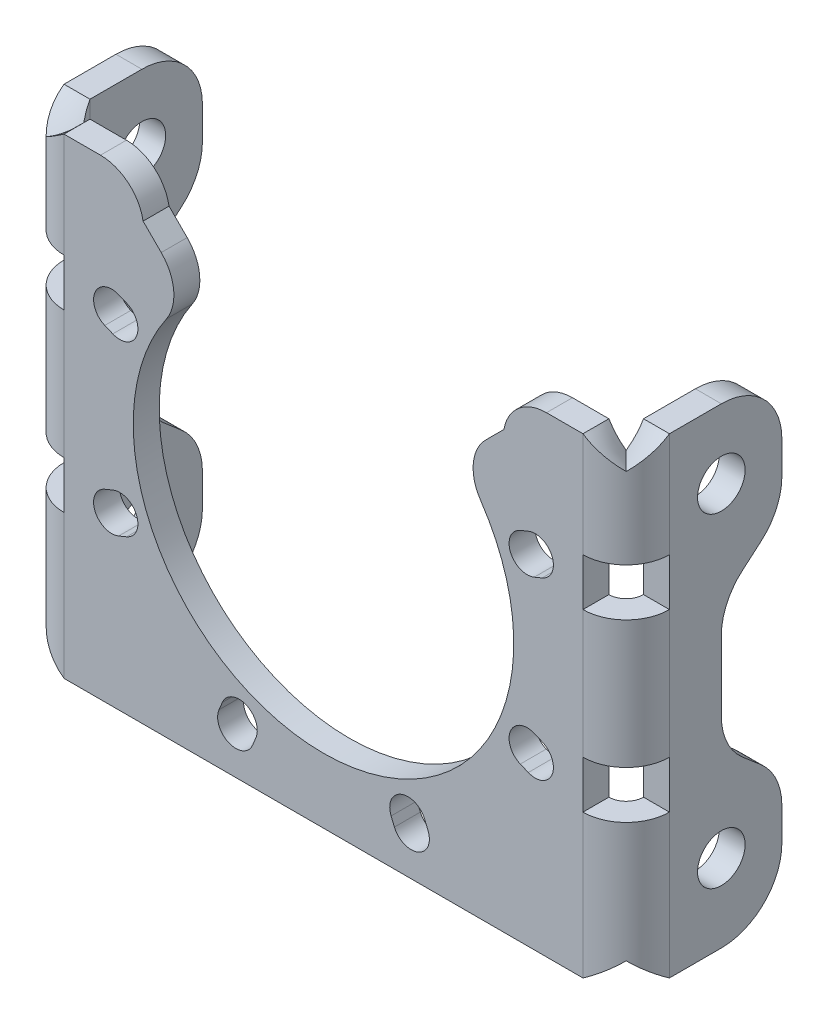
ISO-10303-21;
HEADER;
FILE_DESCRIPTION(('STEP AP214'),'2;1');
FILE_NAME('part.step','',(''),(''),'','','');
FILE_SCHEMA(('AUTOMOTIVE_DESIGN { 1 0 10303 214 1 1 1 1 }'));
ENDSEC;
DATA;
#1=APPLICATION_CONTEXT('core data for automotive mechanical design processes');
#2=APPLICATION_PROTOCOL_DEFINITION('international standard','automotive_design',2000,#1);
#3=PRODUCT_CONTEXT('',#1,'mechanical');
#4=PRODUCT('Part','Part','',(#3));
#5=PRODUCT_RELATED_PRODUCT_CATEGORY('part','',(#4));
#6=PRODUCT_DEFINITION_FORMATION('','',#4);
#7=PRODUCT_DEFINITION_CONTEXT('part definition',#1,'design');
#8=PRODUCT_DEFINITION('design','',#6,#7);
#9=PRODUCT_DEFINITION_SHAPE('','',#8);
#10=(LENGTH_UNIT() NAMED_UNIT(*) SI_UNIT(.MILLI.,.METRE.));
#11=(NAMED_UNIT(*) PLANE_ANGLE_UNIT() SI_UNIT($,.RADIAN.));
#12=(NAMED_UNIT(*) SI_UNIT($,.STERADIAN.) SOLID_ANGLE_UNIT());
#13=UNCERTAINTY_MEASURE_WITH_UNIT(LENGTH_MEASURE(1.E-05),#10,'distance_accuracy_value','');
#14=(GEOMETRIC_REPRESENTATION_CONTEXT(3) GLOBAL_UNCERTAINTY_ASSIGNED_CONTEXT((#13)) GLOBAL_UNIT_ASSIGNED_CONTEXT((#10,
#11,#12)) REPRESENTATION_CONTEXT('',''));
#15=CARTESIAN_POINT('',(0.,0.,0.));
#16=DIRECTION('',(0.,0.,1.));
#17=DIRECTION('',(1.,0.,0.));
#18=AXIS2_PLACEMENT_3D('',#15,#16,#17);
#19=CARTESIAN_POINT('',(35.,-29.5,-18.));
#20=DIRECTION('',(0.,1.,0.));
#21=DIRECTION('',(0.,0.,-1.));
#22=AXIS2_PLACEMENT_3D('',#19,#20,#21);
#23=PLANE('',#22);
#24=DIRECTION('',(0.,0.,-1.));
#25=VECTOR('',#24,1.);
#26=CARTESIAN_POINT('',(32.,-29.5,-18.));
#27=LINE('',#26,#25);
#28=CARTESIAN_POINT('',(32.,-29.5,-5.));
#29=VERTEX_POINT('',#28);
#30=CARTESIAN_POINT('',(32.,-29.5,-11.));
#31=VERTEX_POINT('',#30);
#32=EDGE_CURVE('E435',#29,#31,#27,.T.);
#33=ORIENTED_EDGE('',*,*,#32,.T.);
#34=DIRECTION('',(1.,0.,0.));
#35=VECTOR('',#34,1.);
#36=CARTESIAN_POINT('',(35.,-29.5,-11.));
#37=LINE('',#36,#35);
#38=CARTESIAN_POINT('',(35.,-29.5,-11.));
#39=VERTEX_POINT('',#38);
#40=EDGE_CURVE('E418',#31,#39,#37,.T.);
#41=ORIENTED_EDGE('',*,*,#40,.T.);
#42=DIRECTION('',(0.,0.,-1.));
#43=VECTOR('',#42,1.);
#44=CARTESIAN_POINT('',(35.,-29.5,0.));
#45=LINE('',#44,#43);
#46=CARTESIAN_POINT('',(35.,-29.5,-4.99999999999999));
#47=VERTEX_POINT('',#46);
#48=EDGE_CURVE('E415',#47,#39,#45,.T.);
#49=ORIENTED_EDGE('',*,*,#48,.F.);
#50=CARTESIAN_POINT('',(32.,-29.5,-5.));
#51=CARTESIAN_POINT('',(35.,-29.5,-5.));
#52=(BOUNDED_CURVE() B_SPLINE_CURVE(1,(#50,#51),.UNSPECIFIED.,.F.,
.F.) B_SPLINE_CURVE_WITH_KNOTS((2,2),(0.,1.),
.UNSPECIFIED.) CURVE() GEOMETRIC_REPRESENTATION_ITEM() RATIONAL_B_SPLINE_CURVE((1.,1.)) REPRESENTATION_ITEM(''));
#53=EDGE_CURVE('E515',#29,#47,#52,.T.);
#54=ORIENTED_EDGE('',*,*,#53,.F.);
#55=EDGE_LOOP('',(#33,#41,#49,#54));
#56=FACE_BOUND('',#55,.T.);
#57=ADVANCED_FACE('F17',(#56),#23,.F.);
#58=CARTESIAN_POINT('',(35.,-7.39221738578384,-5.));
#59=DIRECTION('',(0.,0.,-1.));
#60=DIRECTION('',(-1.,0.,0.));
#61=AXIS2_PLACEMENT_3D('',#58,#59,#60);
#62=PLANE('',#61);
#63=DIRECTION('',(0.,-1.,0.));
#64=VECTOR('',#63,1.);
#65=CARTESIAN_POINT('',(32.,-7.39221738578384,-5.));
#66=LINE('',#65,#64);
#67=CARTESIAN_POINT('',(32.,-7.39221738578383,-5.));
#68=VERTEX_POINT('',#67);
#69=CARTESIAN_POINT('',(32.,-12.890004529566,-5.));
#70=VERTEX_POINT('',#69);
#71=EDGE_CURVE('E436',#68,#70,#66,.T.);
#72=ORIENTED_EDGE('',*,*,#71,.T.);
#73=DIRECTION('',(-1.,0.,0.));
#74=VECTOR('',#73,1.);
#75=CARTESIAN_POINT('',(35.,-12.890004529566,-5.));
#76=LINE('',#75,#74);
#77=CARTESIAN_POINT('',(35.,-12.890004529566,-5.));
#78=VERTEX_POINT('',#77);
#79=EDGE_CURVE('E694',#78,#70,#76,.T.);
#80=ORIENTED_EDGE('',*,*,#79,.F.);
#81=DIRECTION('',(0.,-1.,0.));
#82=VECTOR('',#81,1.);
#83=CARTESIAN_POINT('',(35.,-7.39221738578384,-5.));
#84=LINE('',#83,#82);
#85=CARTESIAN_POINT('',(35.,-7.39221738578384,-5.));
#86=VERTEX_POINT('',#85);
#87=EDGE_CURVE('E11',#86,#78,#84,.T.);
#88=ORIENTED_EDGE('',*,*,#87,.F.);
#89=DIRECTION('',(-1.,0.,0.));
#90=VECTOR('',#89,1.);
#91=CARTESIAN_POINT('',(35.,-7.39221738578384,-5.));
#92=LINE('',#91,#90);
#93=EDGE_CURVE('E508',#86,#68,#92,.T.);
#94=ORIENTED_EDGE('',*,*,#93,.T.);
#95=EDGE_LOOP('',(#72,#80,#88,#94));
#96=FACE_BOUND('',#95,.T.);
#97=ADVANCED_FACE('F269',(#96),#62,.F.);
#98=CARTESIAN_POINT('',(35.,12.8900045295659,-5.));
#99=DIRECTION('',(0.,0.,-1.));
#100=DIRECTION('',(-1.,0.,0.));
#101=AXIS2_PLACEMENT_3D('',#98,#99,#100);
#102=PLANE('',#101);
#103=DIRECTION('',(0.,-1.,0.));
#104=VECTOR('',#103,1.);
#105=CARTESIAN_POINT('',(32.,12.8900045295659,-5.));
#106=LINE('',#105,#104);
#107=CARTESIAN_POINT('',(32.,12.8900045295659,-5.));
#108=VERTEX_POINT('',#107);
#109=CARTESIAN_POINT('',(32.,7.39221738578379,-5.));
#110=VERTEX_POINT('',#109);
#111=EDGE_CURVE('E440',#108,#110,#106,.T.);
#112=ORIENTED_EDGE('',*,*,#111,.T.);
#113=DIRECTION('',(-1.,0.,0.));
#114=VECTOR('',#113,1.);
#115=CARTESIAN_POINT('',(35.,7.39221738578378,-5.));
#116=LINE('',#115,#114);
#117=CARTESIAN_POINT('',(35.,7.39221738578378,-5.));
#118=VERTEX_POINT('',#117);
#119=EDGE_CURVE('E727',#118,#110,#116,.T.);
#120=ORIENTED_EDGE('',*,*,#119,.F.);
#121=DIRECTION('',(0.,-1.,0.));
#122=VECTOR('',#121,1.);
#123=CARTESIAN_POINT('',(35.,12.8900045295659,-5.));
#124=LINE('',#123,#122);
#125=CARTESIAN_POINT('',(35.,12.8900045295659,-5.));
#126=VERTEX_POINT('',#125);
#127=EDGE_CURVE('E36',#126,#118,#124,.T.);
#128=ORIENTED_EDGE('',*,*,#127,.F.);
#129=DIRECTION('',(-1.,0.,0.));
#130=VECTOR('',#129,1.);
#131=CARTESIAN_POINT('',(35.,12.8900045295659,-5.));
#132=LINE('',#131,#130);
#133=EDGE_CURVE('E711',#126,#108,#132,.T.);
#134=ORIENTED_EDGE('',*,*,#133,.T.);
#135=EDGE_LOOP('',(#112,#120,#128,#134));
#136=FACE_BOUND('',#135,.T.);
#137=ADVANCED_FACE('F339',(#136),#102,.F.);
#138=CARTESIAN_POINT('',(35.,0.,0.));
#139=DIRECTION('',(-1.,0.,0.));
#140=DIRECTION('',(0.,0.,1.));
#141=AXIS2_PLACEMENT_3D('',#138,#139,#140);
#142=PLANE('',#141);
#143=CARTESIAN_POINT('',(35.,-20.5,-11.));
#144=DIRECTION('',(-1.,0.,0.));
#145=DIRECTION('',(0.,0.,1.));
#146=AXIS2_PLACEMENT_3D('',#143,#144,#145);
#147=CIRCLE('',#146,2.75);
#148=CARTESIAN_POINT('',(35.,-20.5,-8.25));
#149=VERTEX_POINT('',#148);
#150=EDGE_CURVE('E1420',#149,#149,#147,.T.);
#151=ORIENTED_EDGE('',*,*,#150,.T.);
#152=EDGE_LOOP('',(#151));
#153=FACE_BOUND('',#152,.T.);
#154=CARTESIAN_POINT('',(35.,17.,-11.));
#155=DIRECTION('',(-1.,0.,0.));
#156=DIRECTION('',(0.,0.,1.));
#157=AXIS2_PLACEMENT_3D('',#154,#155,#156);
#158=CIRCLE('',#157,2.75);
#159=CARTESIAN_POINT('',(35.,17.,-8.25));
#160=VERTEX_POINT('',#159);
#161=EDGE_CURVE('E1436',#160,#160,#158,.T.);
#162=ORIENTED_EDGE('',*,*,#161,.T.);
#163=EDGE_LOOP('',(#162));
#164=FACE_BOUND('',#163,.T.);
#165=ORIENTED_EDGE('',*,*,#48,.T.);
#166=CARTESIAN_POINT('',(35.,-22.5,-11.));
#167=DIRECTION('',(1.,0.,0.));
#168=DIRECTION('',(0.,0.,1.));
#169=AXIS2_PLACEMENT_3D('',#166,#167,#168);
#170=CIRCLE('',#169,7.);
#171=CARTESIAN_POINT('',(35.,-22.5,-18.));
#172=VERTEX_POINT('',#171);
#173=EDGE_CURVE('E409',#39,#172,#170,.T.);
#174=ORIENTED_EDGE('',*,*,#173,.T.);
#175=DIRECTION('',(0.,1.,0.));
#176=VECTOR('',#175,1.);
#177=CARTESIAN_POINT('',(35.,0.,-18.));
#178=LINE('',#177,#176);
#179=CARTESIAN_POINT('',(35.,-18.7195444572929,-18.));
#180=VERTEX_POINT('',#179);
#181=EDGE_CURVE('E392',#172,#180,#178,.T.);
#182=ORIENTED_EDGE('',*,*,#181,.T.);
#183=CARTESIAN_POINT('',(35.,-18.7195444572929,-11.));
#184=DIRECTION('',(1.,0.,0.));
#185=DIRECTION('',(0.,0.,1.));
#186=AXIS2_PLACEMENT_3D('',#183,#184,#185);
#187=CIRCLE('',#186,7.);
#188=CARTESIAN_POINT('',(35.,-13.4047482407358,-15.5555396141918));
#189=VERTEX_POINT('',#188);
#190=EDGE_CURVE('E750',#180,#189,#187,.T.);
#191=ORIENTED_EDGE('',*,*,#190,.T.);
#192=DIRECTION('',(0.,0.650791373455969,0.759256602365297));
#193=VECTOR('',#192,1.);
#194=CARTESIAN_POINT('',(35.,-0.0411764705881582,0.0352941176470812));
#195=LINE('',#194,#193);
#196=CARTESIAN_POINT('',(35.,-11.5952517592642,-13.4444603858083));
#197=VERTEX_POINT('',#196);
#198=EDGE_CURVE('E755',#189,#197,#195,.T.);
#199=ORIENTED_EDGE('',*,*,#198,.T.);
#200=CARTESIAN_POINT('',(35.,-6.2804555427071,-18.));
#201=DIRECTION('',(-1.,0.,0.));
#202=DIRECTION('',(0.,0.,1.));
#203=AXIS2_PLACEMENT_3D('',#200,#201,#202);
#204=CIRCLE('',#203,7.);
#205=CARTESIAN_POINT('',(35.,-6.2804555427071,-11.));
#206=VERTEX_POINT('',#205);
#207=EDGE_CURVE('E769',#197,#206,#204,.T.);
#208=ORIENTED_EDGE('',*,*,#207,.T.);
#209=DIRECTION('',(0.,1.,0.));
#210=VECTOR('',#209,1.);
#211=CARTESIAN_POINT('',(35.,0.,-11.));
#212=LINE('',#211,#210);
#213=CARTESIAN_POINT('',(35.,1.78045554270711,-11.));
#214=VERTEX_POINT('',#213);
#215=EDGE_CURVE('E773',#206,#214,#212,.T.);
#216=ORIENTED_EDGE('',*,*,#215,.T.);
#217=CARTESIAN_POINT('',(35.,1.78045554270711,-18.));
#218=DIRECTION('',(-1.,0.,0.));
#219=DIRECTION('',(0.,0.,1.));
#220=AXIS2_PLACEMENT_3D('',#217,#218,#219);
#221=CIRCLE('',#220,7.);
#222=CARTESIAN_POINT('',(35.,7.09525175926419,-13.4444603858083));
#223=VERTEX_POINT('',#222);
#224=EDGE_CURVE('E790',#214,#223,#221,.T.);
#225=ORIENTED_EDGE('',*,*,#224,.T.);
#226=DIRECTION('',(0.,0.650791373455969,-0.759256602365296));
#227=VECTOR('',#226,1.);
#228=CARTESIAN_POINT('',(35.,-2.55294117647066,-2.18823529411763));
#229=LINE('',#228,#227);
#230=CARTESIAN_POINT('',(35.,8.9047482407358,-15.5555396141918));
#231=VERTEX_POINT('',#230);
#232=EDGE_CURVE('E794',#223,#231,#229,.T.);
#233=ORIENTED_EDGE('',*,*,#232,.T.);
#234=CARTESIAN_POINT('',(35.,14.2195444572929,-11.));
#235=DIRECTION('',(1.,0.,0.));
#236=DIRECTION('',(0.,0.,1.));
#237=AXIS2_PLACEMENT_3D('',#234,#235,#236);
#238=CIRCLE('',#237,7.);
#239=CARTESIAN_POINT('',(35.,14.2195444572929,-18.));
#240=VERTEX_POINT('',#239);
#241=EDGE_CURVE('E705',#231,#240,#238,.T.);
#242=ORIENTED_EDGE('',*,*,#241,.T.);
#243=DIRECTION('',(0.,1.,0.));
#244=VECTOR('',#243,1.);
#245=CARTESIAN_POINT('',(35.,0.,-18.));
#246=LINE('',#245,#244);
#247=CARTESIAN_POINT('',(35.,18.,-18.));
#248=VERTEX_POINT('',#247);
#249=EDGE_CURVE('E700',#240,#248,#246,.T.);
#250=ORIENTED_EDGE('',*,*,#249,.T.);
#251=CARTESIAN_POINT('',(35.,18.,-11.));
#252=DIRECTION('',(1.,0.,0.));
#253=DIRECTION('',(0.,0.,1.));
#254=AXIS2_PLACEMENT_3D('',#251,#252,#253);
#255=CIRCLE('',#254,7.);
#256=CARTESIAN_POINT('',(35.,25.,-11.));
#257=VERTEX_POINT('',#256);
#258=EDGE_CURVE('E818',#248,#257,#255,.T.);
#259=ORIENTED_EDGE('',*,*,#258,.T.);
#260=DIRECTION('',(0.,0.,1.));
#261=VECTOR('',#260,1.);
#262=CARTESIAN_POINT('',(35.,25.,0.));
#263=LINE('',#262,#261);
#264=CARTESIAN_POINT('',(35.,25.,-4.99999999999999));
#265=VERTEX_POINT('',#264);
#266=EDGE_CURVE('E490',#257,#265,#263,.T.);
#267=ORIENTED_EDGE('',*,*,#266,.T.);
#268=DIRECTION('',(0.,1.,0.));
#269=VECTOR('',#268,1.);
#270=CARTESIAN_POINT('',(35.,25.,-5.));
#271=LINE('',#270,#269);
#272=EDGE_CURVE('E494',#126,#265,#271,.T.);
#273=ORIENTED_EDGE('',*,*,#272,.F.);
#274=ORIENTED_EDGE('',*,*,#127,.T.);
#275=DIRECTION('',(0.,1.,0.));
#276=VECTOR('',#275,1.);
#277=CARTESIAN_POINT('',(35.,25.,-5.));
#278=LINE('',#277,#276);
#279=EDGE_CURVE('E739',#86,#118,#278,.T.);
#280=ORIENTED_EDGE('',*,*,#279,.F.);
#281=ORIENTED_EDGE('',*,*,#87,.T.);
#282=DIRECTION('',(0.,1.,0.));
#283=VECTOR('',#282,1.);
#284=CARTESIAN_POINT('',(35.,25.,-5.));
#285=LINE('',#284,#283);
#286=EDGE_CURVE('E474',#47,#78,#285,.T.);
#287=ORIENTED_EDGE('',*,*,#286,.F.);
#288=EDGE_LOOP('',(#165,#174,#182,#191,#199,#208,#216,#225,#233,#242,#250,#259,#267,#273,#274,
#280,#281,#287));
#289=FACE_BOUND('',#288,.T.);
#290=ADVANCED_FACE('F335',(#153,#164,#289),#142,.F.);
#291=CARTESIAN_POINT('',(35.,25.,-3.));
#292=DIRECTION('',(0.,-1.,0.));
#293=DIRECTION('',(0.,0.,-1.));
#294=AXIS2_PLACEMENT_3D('',#291,#292,#293);
#295=PLANE('',#294);
#296=ORIENTED_EDGE('',*,*,#266,.F.);
#297=DIRECTION('',(-1.,0.,0.));
#298=VECTOR('',#297,1.);
#299=CARTESIAN_POINT('',(35.,25.,-11.));
#300=LINE('',#299,#298);
#301=CARTESIAN_POINT('',(32.,25.,-11.));
#302=VERTEX_POINT('',#301);
#303=EDGE_CURVE('E419',#257,#302,#300,.T.);
#304=ORIENTED_EDGE('',*,*,#303,.T.);
#305=DIRECTION('',(0.,0.,1.));
#306=VECTOR('',#305,1.);
#307=CARTESIAN_POINT('',(32.,25.,-3.));
#308=LINE('',#307,#306);
#309=CARTESIAN_POINT('',(32.,25.,-5.));
#310=VERTEX_POINT('',#309);
#311=EDGE_CURVE('E444',#302,#310,#308,.T.);
#312=ORIENTED_EDGE('',*,*,#311,.T.);
#313=CARTESIAN_POINT('',(32.,25.,-5.));
#314=CARTESIAN_POINT('',(33.,25.,-5.));
#315=CARTESIAN_POINT('',(34.,25.,-5.));
#316=CARTESIAN_POINT('',(35.,25.,-5.));
#317=(BOUNDED_CURVE() B_SPLINE_CURVE(3,(#313,#314,#315,#316),.UNSPECIFIED.,.F.,
.F.) B_SPLINE_CURVE_WITH_KNOTS((4,4),(0.,1.),
.UNSPECIFIED.) CURVE() GEOMETRIC_REPRESENTATION_ITEM() RATIONAL_B_SPLINE_CURVE((1.,1.,1.,1.)) REPRESENTATION_ITEM(''));
#318=EDGE_CURVE('E310',#310,#265,#317,.T.);
#319=ORIENTED_EDGE('',*,*,#318,.T.);
#320=EDGE_LOOP('',(#296,#304,#312,#319));
#321=FACE_BOUND('',#320,.T.);
#322=ADVANCED_FACE('F338',(#321),#295,.F.);
#323=CARTESIAN_POINT('',(32.,0.,0.));
#324=DIRECTION('',(-1.,0.,0.));
#325=DIRECTION('',(0.,0.,1.));
#326=AXIS2_PLACEMENT_3D('',#323,#324,#325);
#327=PLANE('',#326);
#328=CARTESIAN_POINT('',(32.,-20.5,-11.));
#329=DIRECTION('',(-1.,0.,0.));
#330=DIRECTION('',(0.,0.,1.));
#331=AXIS2_PLACEMENT_3D('',#328,#329,#330);
#332=CIRCLE('',#331,2.75);
#333=CARTESIAN_POINT('',(32.,-20.5,-8.25));
#334=VERTEX_POINT('',#333);
#335=EDGE_CURVE('E1428',#334,#334,#332,.T.);
#336=ORIENTED_EDGE('',*,*,#335,.F.);
#337=EDGE_LOOP('',(#336));
#338=FACE_BOUND('',#337,.T.);
#339=CARTESIAN_POINT('',(32.,17.,-11.));
#340=DIRECTION('',(-1.,0.,0.));
#341=DIRECTION('',(0.,0.,1.));
#342=AXIS2_PLACEMENT_3D('',#339,#340,#341);
#343=CIRCLE('',#342,2.75);
#344=CARTESIAN_POINT('',(32.,17.,-8.25));
#345=VERTEX_POINT('',#344);
#346=EDGE_CURVE('E1444',#345,#345,#343,.T.);
#347=ORIENTED_EDGE('',*,*,#346,.F.);
#348=EDGE_LOOP('',(#347));
#349=FACE_BOUND('',#348,.T.);
#350=DIRECTION('',(0.,1.,0.));
#351=VECTOR('',#350,1.);
#352=CARTESIAN_POINT('',(32.,25.,-18.));
#353=LINE('',#352,#351);
#354=CARTESIAN_POINT('',(32.,-22.5,-18.));
#355=VERTEX_POINT('',#354);
#356=CARTESIAN_POINT('',(32.,-18.7195444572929,-18.));
#357=VERTEX_POINT('',#356);
#358=EDGE_CURVE('E51',#355,#357,#353,.T.);
#359=ORIENTED_EDGE('',*,*,#358,.F.);
#360=CARTESIAN_POINT('',(32.,-22.5,-11.));
#361=DIRECTION('',(-1.,0.,0.));
#362=DIRECTION('',(0.,0.,1.));
#363=AXIS2_PLACEMENT_3D('',#360,#361,#362);
#364=CIRCLE('',#363,7.);
#365=EDGE_CURVE('E410',#355,#31,#364,.T.);
#366=ORIENTED_EDGE('',*,*,#365,.T.);
#367=ORIENTED_EDGE('',*,*,#32,.F.);
#368=DIRECTION('',(0.,-1.,0.));
#369=VECTOR('',#368,1.);
#370=CARTESIAN_POINT('',(32.,25.,-5.));
#371=LINE('',#370,#369);
#372=EDGE_CURVE('E511',#70,#29,#371,.T.);
#373=ORIENTED_EDGE('',*,*,#372,.F.);
#374=ORIENTED_EDGE('',*,*,#71,.F.);
#375=DIRECTION('',(0.,-1.,0.));
#376=VECTOR('',#375,1.);
#377=CARTESIAN_POINT('',(32.,25.,-5.));
#378=LINE('',#377,#376);
#379=EDGE_CURVE('E735',#110,#68,#378,.T.);
#380=ORIENTED_EDGE('',*,*,#379,.F.);
#381=ORIENTED_EDGE('',*,*,#111,.F.);
#382=DIRECTION('',(0.,-1.,0.));
#383=VECTOR('',#382,1.);
#384=CARTESIAN_POINT('',(32.,25.,-5.));
#385=LINE('',#384,#383);
#386=EDGE_CURVE('E248',#310,#108,#385,.T.);
#387=ORIENTED_EDGE('',*,*,#386,.F.);
#388=ORIENTED_EDGE('',*,*,#311,.F.);
#389=CARTESIAN_POINT('',(32.,18.,-11.));
#390=DIRECTION('',(-1.,0.,0.));
#391=DIRECTION('',(0.,0.,1.));
#392=AXIS2_PLACEMENT_3D('',#389,#390,#391);
#393=CIRCLE('',#392,7.);
#394=CARTESIAN_POINT('',(32.,18.,-18.));
#395=VERTEX_POINT('',#394);
#396=EDGE_CURVE('E427',#302,#395,#393,.T.);
#397=ORIENTED_EDGE('',*,*,#396,.T.);
#398=DIRECTION('',(0.,1.,0.));
#399=VECTOR('',#398,1.);
#400=CARTESIAN_POINT('',(32.,25.,-18.));
#401=LINE('',#400,#399);
#402=CARTESIAN_POINT('',(32.,14.2195444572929,-18.));
#403=VERTEX_POINT('',#402);
#404=EDGE_CURVE('E704',#403,#395,#401,.T.);
#405=ORIENTED_EDGE('',*,*,#404,.F.);
#406=CARTESIAN_POINT('',(32.,14.2195444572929,-11.));
#407=DIRECTION('',(-1.,0.,0.));
#408=DIRECTION('',(0.,0.,1.));
#409=AXIS2_PLACEMENT_3D('',#406,#407,#408);
#410=CIRCLE('',#409,7.);
#411=CARTESIAN_POINT('',(32.,8.9047482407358,-15.5555396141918));
#412=VERTEX_POINT('',#411);
#413=EDGE_CURVE('E803',#403,#412,#410,.T.);
#414=ORIENTED_EDGE('',*,*,#413,.T.);
#415=DIRECTION('',(0.,0.650791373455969,-0.759256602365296));
#416=VECTOR('',#415,1.);
#417=CARTESIAN_POINT('',(32.,-2.55294117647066,-2.18823529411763));
#418=LINE('',#417,#416);
#419=CARTESIAN_POINT('',(32.,7.09525175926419,-13.4444603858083));
#420=VERTEX_POINT('',#419);
#421=EDGE_CURVE('E795',#420,#412,#418,.T.);
#422=ORIENTED_EDGE('',*,*,#421,.F.);
#423=CARTESIAN_POINT('',(32.,1.78045554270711,-18.));
#424=DIRECTION('',(1.,0.,0.));
#425=DIRECTION('',(0.,0.,1.));
#426=AXIS2_PLACEMENT_3D('',#423,#424,#425);
#427=CIRCLE('',#426,7.);
#428=CARTESIAN_POINT('',(32.,1.78045554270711,-11.));
#429=VERTEX_POINT('',#428);
#430=EDGE_CURVE('E782',#420,#429,#427,.T.);
#431=ORIENTED_EDGE('',*,*,#430,.T.);
#432=DIRECTION('',(0.,1.,0.));
#433=VECTOR('',#432,1.);
#434=CARTESIAN_POINT('',(32.,0.,-11.));
#435=LINE('',#434,#433);
#436=CARTESIAN_POINT('',(32.,-6.2804555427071,-11.));
#437=VERTEX_POINT('',#436);
#438=EDGE_CURVE('E777',#437,#429,#435,.T.);
#439=ORIENTED_EDGE('',*,*,#438,.F.);
#440=CARTESIAN_POINT('',(32.,-6.2804555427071,-18.));
#441=DIRECTION('',(1.,0.,0.));
#442=DIRECTION('',(0.,0.,1.));
#443=AXIS2_PLACEMENT_3D('',#440,#441,#442);
#444=CIRCLE('',#443,7.);
#445=CARTESIAN_POINT('',(32.,-11.5952517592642,-13.4444603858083));
#446=VERTEX_POINT('',#445);
#447=EDGE_CURVE('E764',#437,#446,#444,.T.);
#448=ORIENTED_EDGE('',*,*,#447,.T.);
#449=DIRECTION('',(0.,0.650791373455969,0.759256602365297));
#450=VECTOR('',#449,1.);
#451=CARTESIAN_POINT('',(32.,-0.0411764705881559,0.0352941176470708));
#452=LINE('',#451,#450);
#453=CARTESIAN_POINT('',(32.,-13.4047482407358,-15.5555396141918));
#454=VERTEX_POINT('',#453);
#455=EDGE_CURVE('E756',#454,#446,#452,.T.);
#456=ORIENTED_EDGE('',*,*,#455,.F.);
#457=CARTESIAN_POINT('',(32.,-18.7195444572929,-11.));
#458=DIRECTION('',(-1.,0.,0.));
#459=DIRECTION('',(0.,0.,1.));
#460=AXIS2_PLACEMENT_3D('',#457,#458,#459);
#461=CIRCLE('',#460,7.);
#462=EDGE_CURVE('E743',#454,#357,#461,.T.);
#463=ORIENTED_EDGE('',*,*,#462,.T.);
#464=EDGE_LOOP('',(#359,#366,#367,#373,#374,#380,#381,#387,#388,#397,#405,#414,#422,#431,#439,
#448,#456,#463));
#465=FACE_BOUND('',#464,.T.);
#466=ADVANCED_FACE('F348',(#338,#349,#465),#327,.T.);
#467=CARTESIAN_POINT('',(35.,25.,-18.));
#468=DIRECTION('',(0.,0.,1.));
#469=DIRECTION('',(1.,0.,0.));
#470=AXIS2_PLACEMENT_3D('',#467,#468,#469);
#471=PLANE('',#470);
#472=ORIENTED_EDGE('',*,*,#181,.F.);
#473=DIRECTION('',(-1.,0.,0.));
#474=VECTOR('',#473,1.);
#475=CARTESIAN_POINT('',(35.,-22.5,-18.));
#476=LINE('',#475,#474);
#477=EDGE_CURVE('E394',#172,#355,#476,.T.);
#478=ORIENTED_EDGE('',*,*,#477,.T.);
#479=ORIENTED_EDGE('',*,*,#358,.T.);
#480=DIRECTION('',(1.,0.,0.));
#481=VECTOR('',#480,1.);
#482=CARTESIAN_POINT('',(35.,-18.7195444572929,-18.));
#483=LINE('',#482,#481);
#484=EDGE_CURVE('E398',#357,#180,#483,.T.);
#485=ORIENTED_EDGE('',*,*,#484,.T.);
#486=EDGE_LOOP('',(#472,#478,#479,#485));
#487=FACE_BOUND('',#486,.T.);
#488=ADVANCED_FACE('F379',(#487),#471,.F.);
#489=CARTESIAN_POINT('',(35.,-22.5,-11.));
#490=DIRECTION('',(-1.,0.,0.));
#491=DIRECTION('',(0.,0.,1.));
#492=AXIS2_PLACEMENT_3D('',#489,#490,#491);
#493=CYLINDRICAL_SURFACE('',#492,7.);
#494=ORIENTED_EDGE('',*,*,#173,.F.);
#495=ORIENTED_EDGE('',*,*,#40,.F.);
#496=ORIENTED_EDGE('',*,*,#365,.F.);
#497=ORIENTED_EDGE('',*,*,#477,.F.);
#498=EDGE_LOOP('',(#494,#495,#496,#497));
#499=FACE_BOUND('',#498,.T.);
#500=ADVANCED_FACE('F376',(#499),#493,.T.);
#501=CARTESIAN_POINT('',(35.,18.,-11.));
#502=DIRECTION('',(-1.,0.,0.));
#503=DIRECTION('',(0.,0.,1.));
#504=AXIS2_PLACEMENT_3D('',#501,#502,#503);
#505=CYLINDRICAL_SURFACE('',#504,7.);
#506=ORIENTED_EDGE('',*,*,#258,.F.);
#507=DIRECTION('',(1.,0.,0.));
#508=VECTOR('',#507,1.);
#509=CARTESIAN_POINT('',(35.,18.,-18.));
#510=LINE('',#509,#508);
#511=EDGE_CURVE('E814',#395,#248,#510,.T.);
#512=ORIENTED_EDGE('',*,*,#511,.F.);
#513=ORIENTED_EDGE('',*,*,#396,.F.);
#514=ORIENTED_EDGE('',*,*,#303,.F.);
#515=EDGE_LOOP('',(#506,#512,#513,#514));
#516=FACE_BOUND('',#515,.T.);
#517=ADVANCED_FACE('F373',(#516),#505,.T.);
#518=CARTESIAN_POINT('',(35.,25.,-18.));
#519=DIRECTION('',(0.,0.,1.));
#520=DIRECTION('',(1.,0.,0.));
#521=AXIS2_PLACEMENT_3D('',#518,#519,#520);
#522=PLANE('',#521);
#523=ORIENTED_EDGE('',*,*,#249,.F.);
#524=DIRECTION('',(-1.,0.,0.));
#525=VECTOR('',#524,1.);
#526=CARTESIAN_POINT('',(35.,14.2195444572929,-18.));
#527=LINE('',#526,#525);
#528=EDGE_CURVE('E804',#240,#403,#527,.T.);
#529=ORIENTED_EDGE('',*,*,#528,.T.);
#530=ORIENTED_EDGE('',*,*,#404,.T.);
#531=ORIENTED_EDGE('',*,*,#511,.T.);
#532=EDGE_LOOP('',(#523,#529,#530,#531));
#533=FACE_BOUND('',#532,.T.);
#534=ADVANCED_FACE('F371',(#533),#522,.F.);
#535=CARTESIAN_POINT('',(-35.,14.2195444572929,-11.0000000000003));
#536=DIRECTION('',(1.,0.,0.));
#537=DIRECTION('',(0.,0.,-1.));
#538=AXIS2_PLACEMENT_3D('',#535,#536,#537);
#539=CYLINDRICAL_SURFACE('',#538,7.);
#540=ORIENTED_EDGE('',*,*,#413,.F.);
#541=ORIENTED_EDGE('',*,*,#528,.F.);
#542=ORIENTED_EDGE('',*,*,#241,.F.);
#543=DIRECTION('',(1.,0.,0.));
#544=VECTOR('',#543,1.);
#545=CARTESIAN_POINT('',(-35.,8.90474824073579,-15.555539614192));
#546=LINE('',#545,#544);
#547=EDGE_CURVE('E799',#412,#231,#546,.T.);
#548=ORIENTED_EDGE('',*,*,#547,.F.);
#549=EDGE_LOOP('',(#540,#541,#542,#548));
#550=FACE_BOUND('',#549,.T.);
#551=ADVANCED_FACE('F367',(#550),#539,.T.);
#552=CARTESIAN_POINT('',(-35.,5.,-11.0000000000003));
#553=DIRECTION('',(0.,0.759256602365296,0.650791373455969));
#554=DIRECTION('',(1.,0.,0.));
#555=AXIS2_PLACEMENT_3D('',#552,#553,#554);
#556=PLANE('',#555);
#557=ORIENTED_EDGE('',*,*,#232,.F.);
#558=DIRECTION('',(-1.,0.,0.));
#559=VECTOR('',#558,1.);
#560=CARTESIAN_POINT('',(32.,7.09525175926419,-13.4444603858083));
#561=LINE('',#560,#559);
#562=EDGE_CURVE('E786',#223,#420,#561,.T.);
#563=ORIENTED_EDGE('',*,*,#562,.T.);
#564=ORIENTED_EDGE('',*,*,#421,.T.);
#565=ORIENTED_EDGE('',*,*,#547,.T.);
#566=EDGE_LOOP('',(#557,#563,#564,#565));
#567=FACE_BOUND('',#566,.T.);
#568=ADVANCED_FACE('F364',(#567),#556,.F.);
#569=CARTESIAN_POINT('',(-35.,1.78045554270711,-18.0000000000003));
#570=DIRECTION('',(-1.,0.,0.));
#571=DIRECTION('',(0.,0.,1.));
#572=AXIS2_PLACEMENT_3D('',#569,#570,#571);
#573=CYLINDRICAL_SURFACE('',#572,7.);
#574=ORIENTED_EDGE('',*,*,#430,.F.);
#575=ORIENTED_EDGE('',*,*,#562,.F.);
#576=ORIENTED_EDGE('',*,*,#224,.F.);
#577=DIRECTION('',(1.,0.,0.));
#578=VECTOR('',#577,1.);
#579=CARTESIAN_POINT('',(35.,1.78045554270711,-11.));
#580=LINE('',#579,#578);
#581=EDGE_CURVE('E778',#429,#214,#580,.T.);
#582=ORIENTED_EDGE('',*,*,#581,.F.);
#583=EDGE_LOOP('',(#574,#575,#576,#582));
#584=FACE_BOUND('',#583,.T.);
#585=ADVANCED_FACE('F359',(#584),#573,.F.);
#586=CARTESIAN_POINT('',(-35.,5.,-11.0000000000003));
#587=DIRECTION('',(0.,0.,1.));
#588=DIRECTION('',(1.,0.,0.));
#589=AXIS2_PLACEMENT_3D('',#586,#587,#588);
#590=PLANE('',#589);
#591=ORIENTED_EDGE('',*,*,#215,.F.);
#592=DIRECTION('',(-1.,0.,0.));
#593=VECTOR('',#592,1.);
#594=CARTESIAN_POINT('',(32.,-6.2804555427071,-11.));
#595=LINE('',#594,#593);
#596=EDGE_CURVE('E765',#206,#437,#595,.T.);
#597=ORIENTED_EDGE('',*,*,#596,.T.);
#598=ORIENTED_EDGE('',*,*,#438,.T.);
#599=ORIENTED_EDGE('',*,*,#581,.T.);
#600=EDGE_LOOP('',(#591,#597,#598,#599));
#601=FACE_BOUND('',#600,.T.);
#602=ADVANCED_FACE('F355',(#601),#590,.F.);
#603=CARTESIAN_POINT('',(-35.,-6.2804555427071,-18.0000000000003));
#604=DIRECTION('',(-1.,0.,0.));
#605=DIRECTION('',(0.,0.,1.));
#606=AXIS2_PLACEMENT_3D('',#603,#604,#605);
#607=CYLINDRICAL_SURFACE('',#606,7.);
#608=ORIENTED_EDGE('',*,*,#447,.F.);
#609=ORIENTED_EDGE('',*,*,#596,.F.);
#610=ORIENTED_EDGE('',*,*,#207,.F.);
#611=DIRECTION('',(1.,0.,0.));
#612=VECTOR('',#611,1.);
#613=CARTESIAN_POINT('',(35.,-11.5952517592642,-13.4444603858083));
#614=LINE('',#613,#612);
#615=EDGE_CURVE('E760',#446,#197,#614,.T.);
#616=ORIENTED_EDGE('',*,*,#615,.F.);
#617=EDGE_LOOP('',(#608,#609,#610,#616));
#618=FACE_BOUND('',#617,.T.);
#619=ADVANCED_FACE('F358',(#618),#607,.F.);
#620=CARTESIAN_POINT('',(-35.,-15.5,-18.0000000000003));
#621=DIRECTION('',(0.,-0.759256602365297,0.650791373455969));
#622=DIRECTION('',(-1.,0.,0.));
#623=AXIS2_PLACEMENT_3D('',#620,#621,#622);
#624=PLANE('',#623);
#625=ORIENTED_EDGE('',*,*,#198,.F.);
#626=DIRECTION('',(-1.,0.,0.));
#627=VECTOR('',#626,1.);
#628=CARTESIAN_POINT('',(-35.,-13.4047482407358,-15.555539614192));
#629=LINE('',#628,#627);
#630=EDGE_CURVE('E746',#189,#454,#629,.T.);
#631=ORIENTED_EDGE('',*,*,#630,.T.);
#632=ORIENTED_EDGE('',*,*,#455,.T.);
#633=ORIENTED_EDGE('',*,*,#615,.T.);
#634=EDGE_LOOP('',(#625,#631,#632,#633));
#635=FACE_BOUND('',#634,.T.);
#636=ADVANCED_FACE('F353',(#635),#624,.F.);
#637=CARTESIAN_POINT('',(35.,-18.7195444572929,-11.));
#638=DIRECTION('',(1.,0.,0.));
#639=DIRECTION('',(0.,0.,-1.));
#640=AXIS2_PLACEMENT_3D('',#637,#638,#639);
#641=CYLINDRICAL_SURFACE('',#640,7.);
#642=ORIENTED_EDGE('',*,*,#462,.F.);
#643=ORIENTED_EDGE('',*,*,#630,.F.);
#644=ORIENTED_EDGE('',*,*,#190,.F.);
#645=ORIENTED_EDGE('',*,*,#484,.F.);
#646=EDGE_LOOP('',(#642,#643,#644,#645));
#647=FACE_BOUND('',#646,.T.);
#648=ADVANCED_FACE('F350',(#647),#641,.T.);
#649=CARTESIAN_POINT('',(30.,16.0563126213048,-5.));
#650=DIRECTION('',(0.,-1.,0.));
#651=DIRECTION('',(0.,0.,-1.));
#652=AXIS2_PLACEMENT_3D('',#649,#650,#651);
#653=CYLINDRICAL_SURFACE('',#652,5.);
#654=CARTESIAN_POINT('',(30.,7.39221738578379,-5.));
#655=DIRECTION('',(0.,1.,0.));
#656=DIRECTION('',(0.,0.,-1.));
#657=AXIS2_PLACEMENT_3D('',#654,#655,#656);
#658=CIRCLE('',#657,5.);
#659=CARTESIAN_POINT('',(30.,7.39221738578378,0.));
#660=VERTEX_POINT('',#659);
#661=EDGE_CURVE('E723',#660,#118,#658,.T.);
#662=ORIENTED_EDGE('',*,*,#661,.F.);
#663=DIRECTION('',(0.,1.,0.));
#664=VECTOR('',#663,1.);
#665=CARTESIAN_POINT('',(30.,-29.5,0.));
#666=LINE('',#665,#664);
#667=CARTESIAN_POINT('',(30.,-7.39221738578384,0.));
#668=VERTEX_POINT('',#667);
#669=EDGE_CURVE('E1974',#668,#660,#666,.T.);
#670=ORIENTED_EDGE('',*,*,#669,.F.);
#671=CARTESIAN_POINT('',(30.,-7.39221738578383,-5.));
#672=DIRECTION('',(0.,-1.,0.));
#673=DIRECTION('',(0.,0.,-1.));
#674=AXIS2_PLACEMENT_3D('',#671,#672,#673);
#675=CIRCLE('',#674,5.);
#676=EDGE_CURVE('E715',#86,#668,#675,.T.);
#677=ORIENTED_EDGE('',*,*,#676,.F.);
#678=ORIENTED_EDGE('',*,*,#279,.T.);
#679=EDGE_LOOP('',(#662,#670,#677,#678));
#680=FACE_BOUND('',#679,.T.);
#681=ADVANCED_FACE('F344',(#680),#653,.T.);
#682=CARTESIAN_POINT('',(30.,16.0563126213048,-5.));
#683=DIRECTION('',(0.,-1.,0.));
#684=DIRECTION('',(0.,0.,-1.));
#685=AXIS2_PLACEMENT_3D('',#682,#683,#684);
#686=CYLINDRICAL_SURFACE('',#685,2.);
#687=CARTESIAN_POINT('',(30.,7.39221738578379,-5.));
#688=DIRECTION('',(0.,1.,0.));
#689=DIRECTION('',(0.,0.,-1.));
#690=AXIS2_PLACEMENT_3D('',#687,#688,#689);
#691=CIRCLE('',#690,2.);
#692=CARTESIAN_POINT('',(30.,7.39221738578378,-3.));
#693=VERTEX_POINT('',#692);
#694=EDGE_CURVE('E731',#693,#110,#691,.T.);
#695=ORIENTED_EDGE('',*,*,#694,.T.);
#696=ORIENTED_EDGE('',*,*,#379,.T.);
#697=CARTESIAN_POINT('',(30.,-7.39221738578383,-5.));
#698=DIRECTION('',(0.,-1.,0.));
#699=DIRECTION('',(0.,0.,1.));
#700=AXIS2_PLACEMENT_3D('',#697,#698,#699);
#701=CIRCLE('',#700,2.);
#702=CARTESIAN_POINT('',(30.,-7.39221738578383,-3.));
#703=VERTEX_POINT('',#702);
#704=EDGE_CURVE('E719',#68,#703,#701,.T.);
#705=ORIENTED_EDGE('',*,*,#704,.T.);
#706=DIRECTION('',(0.,1.,0.));
#707=VECTOR('',#706,1.);
#708=CARTESIAN_POINT('',(30.,-29.5,-3.));
#709=LINE('',#708,#707);
#710=EDGE_CURVE('E2039',#703,#693,#709,.T.);
#711=ORIENTED_EDGE('',*,*,#710,.T.);
#712=EDGE_LOOP('',(#695,#696,#705,#711));
#713=FACE_BOUND('',#712,.T.);
#714=ADVANCED_FACE('F341',(#713),#686,.F.);
#715=CARTESIAN_POINT('',(30.,7.39221738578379,-5.));
#716=DIRECTION('',(0.,-1.,0.));
#717=DIRECTION('',(0.,0.,-1.));
#718=AXIS2_PLACEMENT_3D('',#715,#716,#717);
#719=PLANE('',#718);
#720=DIRECTION('',(0.,0.,-1.));
#721=VECTOR('',#720,1.);
#722=CARTESIAN_POINT('',(30.,7.39221738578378,0.));
#723=LINE('',#722,#721);
#724=EDGE_CURVE('E1501',#660,#693,#723,.T.);
#725=ORIENTED_EDGE('',*,*,#724,.F.);
#726=ORIENTED_EDGE('',*,*,#661,.T.);
#727=ORIENTED_EDGE('',*,*,#119,.T.);
#728=ORIENTED_EDGE('',*,*,#694,.F.);
#729=EDGE_LOOP('',(#725,#726,#727,#728));
#730=FACE_BOUND('',#729,.T.);
#731=ADVANCED_FACE('F333',(#730),#719,.F.);
#732=CARTESIAN_POINT('',(30.,-7.39221738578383,-5.));
#733=DIRECTION('',(0.,1.,0.));
#734=DIRECTION('',(1.,0.,0.));
#735=AXIS2_PLACEMENT_3D('',#732,#733,#734);
#736=PLANE('',#735);
#737=ORIENTED_EDGE('',*,*,#93,.F.);
#738=ORIENTED_EDGE('',*,*,#676,.T.);
#739=DIRECTION('',(0.,0.,-1.));
#740=VECTOR('',#739,1.);
#741=CARTESIAN_POINT('',(30.,-7.39221738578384,0.));
#742=LINE('',#741,#740);
#743=EDGE_CURVE('E1505',#668,#703,#742,.T.);
#744=ORIENTED_EDGE('',*,*,#743,.T.);
#745=ORIENTED_EDGE('',*,*,#704,.F.);
#746=EDGE_LOOP('',(#737,#738,#744,#745));
#747=FACE_BOUND('',#746,.T.);
#748=ADVANCED_FACE('F324',(#747),#736,.F.);
#749=CARTESIAN_POINT('',(30.,32.5786977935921,-5.));
#750=DIRECTION('',(0.,-1.,0.));
#751=DIRECTION('',(0.,0.,-1.));
#752=AXIS2_PLACEMENT_3D('',#749,#750,#751);
#753=CYLINDRICAL_SURFACE('',#752,5.);
#754=DIRECTION('',(0.,1.,0.));
#755=VECTOR('',#754,1.);
#756=CARTESIAN_POINT('',(30.,-29.5,0.));
#757=LINE('',#756,#755);
#758=CARTESIAN_POINT('',(30.,12.8900045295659,0.));
#759=VERTEX_POINT('',#758);
#760=CARTESIAN_POINT('',(30.,25.,0.));
#761=VERTEX_POINT('',#760);
#762=EDGE_CURVE('E483',#759,#761,#757,.T.);
#763=ORIENTED_EDGE('',*,*,#762,.F.);
#764=CARTESIAN_POINT('',(30.,12.8900045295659,-5.));
#765=DIRECTION('',(0.,-1.,0.));
#766=DIRECTION('',(0.,0.,-1.));
#767=AXIS2_PLACEMENT_3D('',#764,#765,#766);
#768=CIRCLE('',#767,5.);
#769=EDGE_CURVE('E706',#126,#759,#768,.T.);
#770=ORIENTED_EDGE('',*,*,#769,.F.);
#771=ORIENTED_EDGE('',*,*,#272,.T.);
#772=CARTESIAN_POINT('',(33.5355341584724,22.2511066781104,-1.46446634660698));
#773=CARTESIAN_POINT('',(33.6552497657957,22.369603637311,-1.58413665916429));
#774=CARTESIAN_POINT('',(33.7688415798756,22.4880960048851,-1.70992810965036));
#775=CARTESIAN_POINT('',(33.9826522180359,22.7250097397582,-1.97229189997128));
#776=CARTESIAN_POINT('',(34.0828785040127,22.8434311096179,-2.10885815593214));
#777=CARTESIAN_POINT('',(34.2689596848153,23.0802616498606,-2.39143286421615));
#778=CARTESIAN_POINT('',(34.3548160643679,23.1986708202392,-2.53744033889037));
#779=CARTESIAN_POINT('',(34.5113245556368,23.4355428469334,-2.83745960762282));
#780=CARTESIAN_POINT('',(34.5819707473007,23.5540057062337,-2.99147448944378));
#781=CARTESIAN_POINT('',(34.7030376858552,23.782894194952,-3.29520498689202));
#782=CARTESIAN_POINT('',(34.7545048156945,23.8933203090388,-3.44450434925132));
#783=CARTESIAN_POINT('',(34.8431191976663,24.1142082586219,-3.7473622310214));
#784=CARTESIAN_POINT('',(34.88026111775,24.224670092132,-3.90092231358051));
#785=CARTESIAN_POINT('',(34.9399511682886,24.445956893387,-4.21137251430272));
#786=CARTESIAN_POINT('',(34.9624511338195,24.5567818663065,-4.36827188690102));
#787=CARTESIAN_POINT('',(34.9924854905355,24.7784035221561,-4.68344715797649));
#788=CARTESIAN_POINT('',(35.0000242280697,24.88920020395,-4.84172264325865));
#789=CARTESIAN_POINT('',(35.,25.,-5.));
#790=B_SPLINE_CURVE_WITH_KNOTS('',3,(#772,#773,#774,#775,#776,#777,#778,#779,#780,#781,#782,
#783,#784,#785,#786,#787,#788,#789),.UNSPECIFIED.,.F.,.F.,(4,2,2,2,2,2,2,2,4),(0.,
0.619692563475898,1.23903769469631,1.85831879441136,2.47784049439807,3.05536752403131,
3.63310931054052,4.21274210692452,4.79220649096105),.UNSPECIFIED.);
#791=CARTESIAN_POINT('',(33.5355340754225,22.2511065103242,-1.464466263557));
#792=VERTEX_POINT('',#791);
#793=EDGE_CURVE('E302',#792,#265,#790,.T.);
#794=ORIENTED_EDGE('',*,*,#793,.F.);
#795=CARTESIAN_POINT('',(30.,25.,0.));
#796=CARTESIAN_POINT('',(30.169271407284,24.8815030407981,3.20403255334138E-05));
#797=CARTESIAN_POINT('',(30.3385409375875,24.7630106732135,-0.00859439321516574));
#798=CARTESIAN_POINT('',(30.6752471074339,24.5260969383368,-0.0429266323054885));
#799=CARTESIAN_POINT('',(30.8426847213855,24.4076755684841,-0.0686228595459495));
#800=CARTESIAN_POINT('',(31.1740744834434,24.1708450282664,-0.136854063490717));
#801=CARTESIAN_POINT('',(31.3380269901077,24.0524358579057,-0.179387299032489));
#802=CARTESIAN_POINT('',(31.6608408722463,23.8155638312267,-0.280864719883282));
#803=CARTESIAN_POINT('',(31.8197002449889,23.6971009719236,-0.339815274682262));
#804=CARTESIAN_POINT('',(32.1200774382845,23.4682124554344,-0.46897791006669));
#805=CARTESIAN_POINT('',(32.2620408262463,23.3577863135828,-0.538155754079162));
#806=CARTESIAN_POINT('',(32.5388535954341,23.1368983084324,-0.689648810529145));
#807=CARTESIAN_POINT('',(32.6737003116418,23.0264364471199,-0.771968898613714));
#808=CARTESIAN_POINT('',(32.9354290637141,22.8051495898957,-0.949283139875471));
#809=CARTESIAN_POINT('',(33.0622835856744,22.6943245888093,-1.04431789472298));
#810=CARTESIAN_POINT('',(33.3063837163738,22.4727028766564,-1.24594302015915));
#811=CARTESIAN_POINT('',(33.4236321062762,22.361906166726,-1.35253002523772));
#812=CARTESIAN_POINT('',(33.5355339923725,22.2511063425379,-1.46446618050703));
#813=B_SPLINE_CURVE_WITH_KNOTS('',3,(#795,#796,#797,#798,#799,#800,#801,#802,#803,#804,#805,
#806,#807,#808,#809,#810,#811,#812),.UNSPECIFIED.,.F.,.F.,(4,2,2,2,2,2,2,2,4),(0.,
0.619692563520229,1.23903769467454,1.85831879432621,2.47784049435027,3.05536766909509,
3.63310960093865,4.21274254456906,4.79220707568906),.UNSPECIFIED.);
#814=EDGE_CURVE('E249',#761,#792,#813,.T.);
#815=ORIENTED_EDGE('',*,*,#814,.F.);
#816=EDGE_LOOP('',(#763,#770,#771,#794,#815));
#817=FACE_BOUND('',#816,.T.);
#818=ADVANCED_FACE('F319',(#817),#753,.T.);
#819=CARTESIAN_POINT('',(30.,32.5786977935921,-5.));
#820=DIRECTION('',(0.,-1.,0.));
#821=DIRECTION('',(0.,0.,-1.));
#822=AXIS2_PLACEMENT_3D('',#819,#820,#821);
#823=CYLINDRICAL_SURFACE('',#822,2.);
#824=DIRECTION('',(0.,1.,0.));
#825=VECTOR('',#824,1.);
#826=CARTESIAN_POINT('',(30.,-29.5,-3.));
#827=LINE('',#826,#825);
#828=CARTESIAN_POINT('',(30.,12.8900045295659,-3.));
#829=VERTEX_POINT('',#828);
#830=CARTESIAN_POINT('',(30.,25.,-3.));
#831=VERTEX_POINT('',#830);
#832=EDGE_CURVE('E456',#829,#831,#827,.T.);
#833=ORIENTED_EDGE('',*,*,#832,.T.);
#834=CARTESIAN_POINT('',(30.,25.,-3.));
#835=CARTESIAN_POINT('',(30.0829004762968,24.8549149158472,-2.99997136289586));
#836=CARTESIAN_POINT('',(30.1658003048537,24.7098362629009,-3.00515315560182));
#837=CARTESIAN_POINT('',(30.330320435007,24.4196920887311,-3.02573306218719));
#838=CARTESIAN_POINT('',(30.4119408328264,24.2746265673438,-3.0411304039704));
#839=CARTESIAN_POINT('',(30.5782241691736,23.9743988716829,-3.08335576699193));
#840=CARTESIAN_POINT('',(30.6627039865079,23.8192360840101,-3.11090421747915));
#841=CARTESIAN_POINT('',(30.8272680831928,23.5089072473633,-3.17695580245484));
#842=CARTESIAN_POINT('',(30.9073522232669,23.3537411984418,-3.21545928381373));
#843=CARTESIAN_POINT('',(31.0630674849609,23.0406768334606,-3.30352819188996));
#844=CARTESIAN_POINT('',(31.1385952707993,22.8827785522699,-3.35327658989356));
#845=CARTESIAN_POINT('',(31.2822786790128,22.5669567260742,-3.46248577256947));
#846=CARTESIAN_POINT('',(31.3504332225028,22.4090331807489,-3.52194797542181));
#847=CARTESIAN_POINT('',(31.4142135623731,22.2511064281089,-3.58578643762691));
#848=B_SPLINE_CURVE_WITH_KNOTS('',3,(#834,#835,#836,#837,#838,#839,#840,#841,#842,#843,#844,
#845,#846,#847),.UNSPECIFIED.,.F.,.F.,(4,2,2,2,2,2,4),(0.,0.501207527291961,1.00237717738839,
1.53839808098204,2.07443595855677,2.61991958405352,3.16548291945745),.UNSPECIFIED.);
#849=CARTESIAN_POINT('',(31.4142135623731,22.2511064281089,-3.58578643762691));
#850=VERTEX_POINT('',#849);
#851=EDGE_CURVE('E239',#831,#850,#848,.T.);
#852=ORIENTED_EDGE('',*,*,#851,.T.);
#853=CARTESIAN_POINT('',(31.4142135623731,22.2511064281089,-3.58578643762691));
#854=CARTESIAN_POINT('',(31.4728533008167,22.3961915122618,-3.64438567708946));
#855=CARTESIAN_POINT('',(31.5278082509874,22.541270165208,-3.70666878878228));
#856=CARTESIAN_POINT('',(31.6295893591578,22.8314143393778,-3.83755427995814));
#857=CARTESIAN_POINT('',(31.6764161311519,22.9764798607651,-3.90615618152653));
#858=CARTESIAN_POINT('',(31.7641383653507,23.276707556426,-4.05359409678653));
#859=CARTESIAN_POINT('',(31.8043949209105,23.4318703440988,-4.1328100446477));
#860=CARTESIAN_POINT('',(31.8740537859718,23.7421991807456,-4.2958799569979));
#861=CARTESIAN_POINT('',(31.9034557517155,23.8973652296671,-4.37973406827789));
#862=CARTESIAN_POINT('',(31.9512889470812,24.2104295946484,-4.55211550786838));
#863=CARTESIAN_POINT('',(31.969517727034,24.368327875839,-4.64069914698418));
#864=CARTESIAN_POINT('',(31.9938946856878,24.6841497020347,-4.81952121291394));
#865=CARTESIAN_POINT('',(32.0000410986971,24.84207324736,-4.90975987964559));
#866=CARTESIAN_POINT('',(32.,25.,-5.));
#867=B_SPLINE_CURVE_WITH_KNOTS('',3,(#853,#854,#855,#856,#857,#858,#859,#860,#861,#862,#863,
#864,#865,#866),.UNSPECIFIED.,.F.,.F.,(4,2,2,2,2,2,4),(0.,0.501207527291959,1.00237717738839,
1.53839808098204,2.07443595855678,2.61991958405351,3.16548291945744),.UNSPECIFIED.);
#868=EDGE_CURVE('E296',#850,#310,#867,.T.);
#869=ORIENTED_EDGE('',*,*,#868,.T.);
#870=ORIENTED_EDGE('',*,*,#386,.T.);
#871=CARTESIAN_POINT('',(30.,12.8900045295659,-5.));
#872=DIRECTION('',(0.,-1.,0.));
#873=DIRECTION('',(0.,0.,1.));
#874=AXIS2_PLACEMENT_3D('',#871,#872,#873);
#875=CIRCLE('',#874,2.);
#876=EDGE_CURVE('E710',#108,#829,#875,.T.);
#877=ORIENTED_EDGE('',*,*,#876,.T.);
#878=EDGE_LOOP('',(#833,#852,#869,#870,#877));
#879=FACE_BOUND('',#878,.T.);
#880=ADVANCED_FACE('F256',(#879),#823,.F.);
#881=CARTESIAN_POINT('',(30.,25.,0.0299999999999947));
#882=CARTESIAN_POINT('',(30.6585053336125,24.5417952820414,0.0299999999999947));
#883=CARTESIAN_POINT('',(31.3165918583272,24.0837021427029,-0.100917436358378));
#884=CARTESIAN_POINT('',(32.5332034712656,23.1674042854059,-0.604854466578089));
#885=CARTESIAN_POINT('',(33.0911135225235,22.7093111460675,-0.977619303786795));
#886=CARTESIAN_POINT('',(33.5567471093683,22.2511064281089,-1.44325289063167));
#887=CARTESIAN_POINT('',(33.5660597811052,22.2419423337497,-1.45256556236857));
#888=CARTESIAN_POINT('',(33.5753724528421,22.2327782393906,-1.46187823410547));
#889=CARTESIAN_POINT('',(33.584685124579,22.2236141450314,-1.47119090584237));
#890=CARTESIAN_POINT('',(30.,25.,0.));
#891=CARTESIAN_POINT('',(30.6545776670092,24.5417956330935,0.));
#892=CARTESIAN_POINT('',(31.3087394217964,24.0837021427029,-0.130136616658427));
#893=CARTESIAN_POINT('',(32.5180949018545,23.1674042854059,-0.631068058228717));
#894=CARTESIAN_POINT('',(33.0726775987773,22.7093107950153,-1.0016097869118));
#895=CARTESIAN_POINT('',(33.5355339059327,22.2511064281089,-1.46446609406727));
#896=CARTESIAN_POINT('',(33.5447910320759,22.2419423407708,-1.47372322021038));
#897=CARTESIAN_POINT('',(33.554048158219,22.2327782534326,-1.48298034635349));
#898=CARTESIAN_POINT('',(33.5633052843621,22.2236141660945,-1.4922374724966));
#899=CARTESIAN_POINT('',(30.,25.,-3.));
#900=CARTESIAN_POINT('',(30.2618110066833,24.5418307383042,-3.));
#901=CARTESIAN_POINT('',(30.5234957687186,24.0837021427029,-3.05205464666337));
#902=CARTESIAN_POINT('',(31.0072379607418,23.1674042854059,-3.25242722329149));
#903=CARTESIAN_POINT('',(31.2290852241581,22.7092756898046,-3.4006580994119));
#904=CARTESIAN_POINT('',(31.4142135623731,22.2511064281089,-3.58578643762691));
#905=CARTESIAN_POINT('',(31.4179161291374,22.241943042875,-3.58948900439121));
#906=CARTESIAN_POINT('',(31.4216186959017,22.2327796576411,-3.59319157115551));
#907=CARTESIAN_POINT('',(31.425321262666,22.2236162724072,-3.59689413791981));
#908=B_SPLINE_SURFACE_WITH_KNOTS('',1,3,((#881,#882,#883,#884,#885,#886,#887,#888,#889),(#890,
#891,#892,#893,#894,#895,#896,#897,#898),(#899,#900,#901,#902,#903,#904,#905,#906,#907)),
.UNSPECIFIED.,.F.,.F.,.F.,(2,1,2),(4,2,3,4),(-0.01,0.,1.),(0.,0.5,1.,1.01),.UNSPECIFIED.);
#909=CARTESIAN_POINT('',(33.5355341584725,22.2511066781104,-1.46446634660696));
#910=CARTESIAN_POINT('',(31.4142135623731,22.2511064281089,-3.58578643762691));
#911=(BOUNDED_CURVE() B_SPLINE_CURVE(1,(#909,#910),.UNSPECIFIED.,.F.,
.F.) B_SPLINE_CURVE_WITH_KNOTS((2,2),(0.,1.),
.UNSPECIFIED.) CURVE() GEOMETRIC_REPRESENTATION_ITEM() RATIONAL_B_SPLINE_CURVE((1.,1.)) REPRESENTATION_ITEM(''));
#912=EDGE_CURVE('E311',#792,#850,#911,.T.);
#913=CARTESIAN_POINT('',(30.,25.,-3.));
#914=CARTESIAN_POINT('',(30.,25.,0.));
#915=(BOUNDED_CURVE() B_SPLINE_CURVE(1,(#913,#914),.UNSPECIFIED.,.F.,
.F.) B_SPLINE_CURVE_WITH_KNOTS((2,2),(0.,1.),
.UNSPECIFIED.) CURVE() GEOMETRIC_REPRESENTATION_ITEM() RATIONAL_B_SPLINE_CURVE((1.,1.)) REPRESENTATION_ITEM(''));
#916=EDGE_CURVE('E448',#831,#761,#915,.T.);
#917=ORIENTED_EDGE('',*,*,#814,.T.);
#918=ORIENTED_EDGE('',*,*,#912,.T.);
#919=ORIENTED_EDGE('',*,*,#851,.F.);
#920=ORIENTED_EDGE('',*,*,#916,.T.);
#921=EDGE_LOOP('',(#917,#918,#919,#920));
#922=FACE_BOUND('',#921,.T.);
#923=ADVANCED_FACE('F260',(#922),#908,.F.);
#924=CARTESIAN_POINT('',(30.,12.8900045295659,-5.));
#925=DIRECTION('',(0.,1.,0.));
#926=DIRECTION('',(1.,0.,0.));
#927=AXIS2_PLACEMENT_3D('',#924,#925,#926);
#928=PLANE('',#927);
#929=ORIENTED_EDGE('',*,*,#133,.F.);
#930=ORIENTED_EDGE('',*,*,#769,.T.);
#931=DIRECTION('',(0.,0.,-1.));
#932=VECTOR('',#931,1.);
#933=CARTESIAN_POINT('',(30.,12.8900045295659,0.));
#934=LINE('',#933,#932);
#935=EDGE_CURVE('E1506',#759,#829,#934,.T.);
#936=ORIENTED_EDGE('',*,*,#935,.T.);
#937=ORIENTED_EDGE('',*,*,#876,.F.);
#938=EDGE_LOOP('',(#929,#930,#936,#937));
#939=FACE_BOUND('',#938,.T.);
#940=ADVANCED_FACE('F267',(#939),#928,.F.);
#941=CARTESIAN_POINT('',(33.5288090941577,22.2236141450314,-1.41531487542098));
#942=CARTESIAN_POINT('',(33.5381217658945,22.2327782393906,-1.42462754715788));
#943=CARTESIAN_POINT('',(33.5474344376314,22.2419423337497,-1.43394021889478));
#944=CARTESIAN_POINT('',(33.5567471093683,22.2511064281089,-1.44325289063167));
#945=CARTESIAN_POINT('',(34.0223806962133,22.7093111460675,-1.90888647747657));
#946=CARTESIAN_POINT('',(34.3951455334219,23.1674042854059,-2.46679652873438));
#947=CARTESIAN_POINT('',(34.8990825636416,24.0837021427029,-3.68340814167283));
#948=CARTESIAN_POINT('',(35.03,24.5417952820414,-4.34149466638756));
#949=CARTESIAN_POINT('',(35.03,25.,-5.));
#950=CARTESIAN_POINT('',(33.5077625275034,22.2236141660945,-1.43669471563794));
#951=CARTESIAN_POINT('',(33.5170196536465,22.2327782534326,-1.44595184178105));
#952=CARTESIAN_POINT('',(33.5262767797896,22.2419423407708,-1.45520896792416));
#953=CARTESIAN_POINT('',(33.5355339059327,22.2511064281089,-1.46446609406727));
#954=CARTESIAN_POINT('',(33.9983902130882,22.7093107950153,-1.92732240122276));
#955=CARTESIAN_POINT('',(34.3689319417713,23.1674042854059,-2.48190509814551));
#956=CARTESIAN_POINT('',(34.8698633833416,24.0837021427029,-3.6912605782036));
#957=CARTESIAN_POINT('',(35.,24.5417956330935,-4.34542233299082));
#958=CARTESIAN_POINT('',(35.,25.,-5.));
#959=CARTESIAN_POINT('',(31.4031058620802,22.2236162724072,-3.57467873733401));
#960=CARTESIAN_POINT('',(31.4068084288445,22.2327796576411,-3.57838130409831));
#961=CARTESIAN_POINT('',(31.4105109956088,22.241943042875,-3.58208387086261));
#962=CARTESIAN_POINT('',(31.4142135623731,22.2511064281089,-3.58578643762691));
#963=CARTESIAN_POINT('',(31.5993419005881,22.7092756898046,-3.77091477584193));
#964=CARTESIAN_POINT('',(31.7475727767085,23.1674042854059,-3.99276203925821));
#965=CARTESIAN_POINT('',(31.9479453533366,24.0837021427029,-4.47650423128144));
#966=CARTESIAN_POINT('',(32.,24.5418307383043,-4.73818899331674));
#967=CARTESIAN_POINT('',(32.,25.,-5.));
#968=B_SPLINE_SURFACE_WITH_KNOTS('',1,3,((#941,#942,#943,#944,#945,#946,#947,#948,#949),(#950,
#951,#952,#953,#954,#955,#956,#957,#958),(#959,#960,#961,#962,#963,#964,#965,#966,#967)),
.UNSPECIFIED.,.F.,.F.,.F.,(2,1,2),(4,3,2,4),(-0.01,0.,1.),(-0.01,0.,0.5,1.),.UNSPECIFIED.);
#969=ORIENTED_EDGE('',*,*,#912,.F.);
#970=ORIENTED_EDGE('',*,*,#793,.T.);
#971=ORIENTED_EDGE('',*,*,#318,.F.);
#972=ORIENTED_EDGE('',*,*,#868,.F.);
#973=EDGE_LOOP('',(#969,#970,#971,#972));
#974=FACE_BOUND('',#973,.T.);
#975=ADVANCED_FACE('F271',(#974),#968,.F.);
#976=CARTESIAN_POINT('',(30.,-3.44344985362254,-5.));
#977=DIRECTION('',(0.,-1.,0.));
#978=DIRECTION('',(0.,0.,-1.));
#979=AXIS2_PLACEMENT_3D('',#976,#977,#978);
#980=CYLINDRICAL_SURFACE('',#979,5.);
#981=ORIENTED_EDGE('',*,*,#286,.T.);
#982=CARTESIAN_POINT('',(30.,-12.890004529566,-5.));
#983=DIRECTION('',(0.,1.,0.));
#984=DIRECTION('',(0.,0.,-1.));
#985=AXIS2_PLACEMENT_3D('',#982,#983,#984);
#986=CIRCLE('',#985,5.);
#987=CARTESIAN_POINT('',(30.,-12.890004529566,0.));
#988=VERTEX_POINT('',#987);
#989=EDGE_CURVE('E690',#988,#78,#986,.T.);
#990=ORIENTED_EDGE('',*,*,#989,.F.);
#991=DIRECTION('',(0.,1.,0.));
#992=VECTOR('',#991,1.);
#993=CARTESIAN_POINT('',(30.,-29.5,0.));
#994=LINE('',#993,#992);
#995=CARTESIAN_POINT('',(30.,-29.5,0.));
#996=VERTEX_POINT('',#995);
#997=EDGE_CURVE('E559',#996,#988,#994,.T.);
#998=ORIENTED_EDGE('',*,*,#997,.F.);
#999=CARTESIAN_POINT('',(33.535533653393,-26.7511066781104,-1.46446584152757));
#1000=CARTESIAN_POINT('',(33.4158633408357,-26.869603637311,-1.34475023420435));
#1001=CARTESIAN_POINT('',(33.2900718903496,-26.9880960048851,-1.23115842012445));
#1002=CARTESIAN_POINT('',(33.0277081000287,-27.2250097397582,-1.01734778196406));
#1003=CARTESIAN_POINT('',(32.8911418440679,-27.3434311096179,-0.917121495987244));
#1004=CARTESIAN_POINT('',(32.6085671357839,-27.5802616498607,-0.731040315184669));
#1005=CARTESIAN_POINT('',(32.4625596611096,-27.6986708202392,-0.645183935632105));
#1006=CARTESIAN_POINT('',(32.1625403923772,-27.9355428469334,-0.488675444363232));
#1007=CARTESIAN_POINT('',(32.0085255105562,-28.0540057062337,-0.418029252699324));
#1008=CARTESIAN_POINT('',(31.704795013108,-28.282894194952,-0.296962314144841));
#1009=CARTESIAN_POINT('',(31.5554956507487,-28.3933203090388,-0.245495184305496));
#1010=CARTESIAN_POINT('',(31.2526377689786,-28.6142082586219,-0.156880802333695));
#1011=CARTESIAN_POINT('',(31.0990776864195,-28.724670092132,-0.119738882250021));
#1012=CARTESIAN_POINT('',(30.7886274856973,-28.945956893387,-0.0600488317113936));
#1013=CARTESIAN_POINT('',(30.631728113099,-29.0567818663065,-0.0375488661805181));
#1014=CARTESIAN_POINT('',(30.3165528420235,-29.2784035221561,-0.00751450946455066));
#1015=CARTESIAN_POINT('',(30.1582773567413,-29.38920020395,2.42280697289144E-05));
#1016=CARTESIAN_POINT('',(30.,-29.5,0.));
#1017=B_SPLINE_CURVE_WITH_KNOTS('',3,(#999,#1000,#1001,#1002,#1003,#1004,#1005,#1006,#1007,
#1008,#1009,#1010,#1011,#1012,#1013,#1014,#1015,#1016),.UNSPECIFIED.,.F.,.F.,(4,2,2,2,2,2,2,2,
4),(0.,0.619692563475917,1.23903769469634,1.8583187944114,2.47784049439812,3.05536752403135,
3.63310931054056,4.21274210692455,4.79220649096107),.UNSPECIFIED.);
#1018=CARTESIAN_POINT('',(33.535533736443,-26.7511065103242,-1.46446592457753));
#1019=VERTEX_POINT('',#1018);
#1020=EDGE_CURVE('E530',#1019,#996,#1017,.T.);
#1021=ORIENTED_EDGE('',*,*,#1020,.F.);
#1022=CARTESIAN_POINT('',(35.,-29.5,-5.));
#1023=CARTESIAN_POINT('',(35.0000320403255,-29.3815030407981,-4.83072859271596));
#1024=CARTESIAN_POINT('',(34.9914056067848,-29.2630106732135,-4.66145906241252));
#1025=CARTESIAN_POINT('',(34.9570733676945,-29.0260969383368,-4.32475289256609));
#1026=CARTESIAN_POINT('',(34.931377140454,-28.9076755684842,-4.15731527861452));
#1027=CARTESIAN_POINT('',(34.8631459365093,-28.6708450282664,-3.82592551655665));
#1028=CARTESIAN_POINT('',(34.8206127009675,-28.5524358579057,-3.66197300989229));
#1029=CARTESIAN_POINT('',(34.7191352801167,-28.3155638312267,-3.33915912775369));
#1030=CARTESIAN_POINT('',(34.6601847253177,-28.1971009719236,-3.1802997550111));
#1031=CARTESIAN_POINT('',(34.5310220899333,-27.9682124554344,-2.87992256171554));
#1032=CARTESIAN_POINT('',(34.4618442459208,-27.8577863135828,-2.73795917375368));
#1033=CARTESIAN_POINT('',(34.3103511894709,-27.6368983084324,-2.46114640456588));
#1034=CARTESIAN_POINT('',(34.2280311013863,-27.5264364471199,-2.32629968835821));
#1035=CARTESIAN_POINT('',(34.0507168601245,-27.3051495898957,-2.0645709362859));
#1036=CARTESIAN_POINT('',(33.955682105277,-27.1943245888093,-1.93771641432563));
#1037=CARTESIAN_POINT('',(33.7540569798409,-26.9727028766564,-1.69361628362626));
#1038=CARTESIAN_POINT('',(33.6474699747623,-26.861906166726,-1.57636789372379));
#1039=CARTESIAN_POINT('',(33.535533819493,-26.7511063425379,-1.46446600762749));
#1040=B_SPLINE_CURVE_WITH_KNOTS('',3,(#1022,#1023,#1024,#1025,#1026,#1027,#1028,#1029,#1030,
#1031,#1032,#1033,#1034,#1035,#1036,#1037,#1038,#1039),.UNSPECIFIED.,.F.,.F.,(4,2,2,2,2,2,2,2,
4),(0.,0.619692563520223,1.23903769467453,1.85831879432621,2.47784049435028,3.05536766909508,
3.63310960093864,4.21274254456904,4.79220707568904),.UNSPECIFIED.);
#1041=EDGE_CURVE('E1479',#47,#1019,#1040,.T.);
#1042=ORIENTED_EDGE('',*,*,#1041,.F.);
#1043=EDGE_LOOP('',(#981,#990,#998,#1021,#1042));
#1044=FACE_BOUND('',#1043,.T.);
#1045=ADVANCED_FACE('F283',(#1044),#980,.T.);
#1046=CARTESIAN_POINT('',(30.,-3.44344985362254,-5.));
#1047=DIRECTION('',(0.,-1.,0.));
#1048=DIRECTION('',(0.,0.,-1.));
#1049=AXIS2_PLACEMENT_3D('',#1046,#1047,#1048);
#1050=CYLINDRICAL_SURFACE('',#1049,2.);
#1051=ORIENTED_EDGE('',*,*,#372,.T.);
#1052=CARTESIAN_POINT('',(32.,-29.5,-5.));
#1053=CARTESIAN_POINT('',(32.0000286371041,-29.3549149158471,-4.91709952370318));
#1054=CARTESIAN_POINT('',(31.9948468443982,-29.2098362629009,-4.83419969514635));
#1055=CARTESIAN_POINT('',(31.9742669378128,-28.9196920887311,-4.66967956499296));
#1056=CARTESIAN_POINT('',(31.9588695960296,-28.7746265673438,-4.58805916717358));
#1057=CARTESIAN_POINT('',(31.9166442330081,-28.4743988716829,-4.4217758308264));
#1058=CARTESIAN_POINT('',(31.8890957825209,-28.3192360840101,-4.33729601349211));
#1059=CARTESIAN_POINT('',(31.8230441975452,-28.0089072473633,-4.17273191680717));
#1060=CARTESIAN_POINT('',(31.7845407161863,-27.8537411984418,-4.09264777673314));
#1061=CARTESIAN_POINT('',(31.6964718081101,-27.5406768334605,-3.93693251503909));
#1062=CARTESIAN_POINT('',(31.6467234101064,-27.3827785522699,-3.86140472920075));
#1063=CARTESIAN_POINT('',(31.5375142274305,-27.0669567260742,-3.71772132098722));
#1064=CARTESIAN_POINT('',(31.4780520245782,-26.9090331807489,-3.6495667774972));
#1065=CARTESIAN_POINT('',(31.4142135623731,-26.7511064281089,-3.5857864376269));
#1066=B_SPLINE_CURVE_WITH_KNOTS('',3,(#1052,#1053,#1054,#1055,#1056,#1057,#1058,#1059,#1060,
#1061,#1062,#1063,#1064,#1065),.UNSPECIFIED.,.F.,.F.,(4,2,2,2,2,2,4),(0.,0.501207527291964,
1.00237717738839,1.53839808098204,2.07443595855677,2.61991958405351,3.16548291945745),.UNSPECIFIED.);
#1067=CARTESIAN_POINT('',(31.4142135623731,-26.7511064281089,-3.5857864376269));
#1068=VERTEX_POINT('',#1067);
#1069=EDGE_CURVE('E312',#29,#1068,#1066,.T.);
#1070=ORIENTED_EDGE('',*,*,#1069,.T.);
#1071=CARTESIAN_POINT('',(31.4142135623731,-26.7511064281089,-3.5857864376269));
#1072=CARTESIAN_POINT('',(31.3556143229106,-26.8961915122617,-3.5271466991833));
#1073=CARTESIAN_POINT('',(31.2933312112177,-27.041270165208,-3.47219174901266));
#1074=CARTESIAN_POINT('',(31.1624457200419,-27.3314143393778,-3.3704106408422));
#1075=CARTESIAN_POINT('',(31.0938438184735,-27.4764798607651,-3.32358386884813));
#1076=CARTESIAN_POINT('',(30.9464059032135,-27.776707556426,-3.2358616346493));
#1077=CARTESIAN_POINT('',(30.8671899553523,-27.9318703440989,-3.19560507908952));
#1078=CARTESIAN_POINT('',(30.7041200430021,-28.2421991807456,-3.12594621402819));
#1079=CARTESIAN_POINT('',(30.6202659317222,-28.3973652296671,-3.09654424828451));
#1080=CARTESIAN_POINT('',(30.4478844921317,-28.7104295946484,-3.0487110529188));
#1081=CARTESIAN_POINT('',(30.3593008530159,-28.868327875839,-3.03048227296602));
#1082=CARTESIAN_POINT('',(30.1804787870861,-29.1841497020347,-3.00610531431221));
#1083=CARTESIAN_POINT('',(30.0902401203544,-29.34207324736,-2.99995890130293));
#1084=CARTESIAN_POINT('',(30.,-29.5,-3.));
#1085=B_SPLINE_CURVE_WITH_KNOTS('',3,(#1071,#1072,#1073,#1074,#1075,#1076,#1077,#1078,#1079,
#1080,#1081,#1082,#1083,#1084),.UNSPECIFIED.,.F.,.F.,(4,2,2,2,2,2,4),(0.,0.501207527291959,
1.00237717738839,1.53839808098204,2.07443595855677,2.61991958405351,3.16548291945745),.UNSPECIFIED.);
#1086=CARTESIAN_POINT('',(30.,-29.5,-3.));
#1087=VERTEX_POINT('',#1086);
#1088=EDGE_CURVE('E695',#1068,#1087,#1085,.T.);
#1089=ORIENTED_EDGE('',*,*,#1088,.T.);
#1090=DIRECTION('',(0.,1.,0.));
#1091=VECTOR('',#1090,1.);
#1092=CARTESIAN_POINT('',(30.,-29.5,-3.));
#1093=LINE('',#1092,#1091);
#1094=CARTESIAN_POINT('',(30.,-12.890004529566,-3.));
#1095=VERTEX_POINT('',#1094);
#1096=EDGE_CURVE('E554',#1087,#1095,#1093,.T.);
#1097=ORIENTED_EDGE('',*,*,#1096,.T.);
#1098=CARTESIAN_POINT('',(30.,-12.890004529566,-5.));
#1099=DIRECTION('',(0.,1.,0.));
#1100=DIRECTION('',(0.,0.,-1.));
#1101=AXIS2_PLACEMENT_3D('',#1098,#1099,#1100);
#1102=CIRCLE('',#1101,2.);
#1103=EDGE_CURVE('E699',#1095,#70,#1102,.T.);
#1104=ORIENTED_EDGE('',*,*,#1103,.T.);
#1105=EDGE_LOOP('',(#1051,#1070,#1089,#1097,#1104));
#1106=FACE_BOUND('',#1105,.T.);
#1107=ADVANCED_FACE('F3932',(#1106),#1050,.F.);
#1108=CARTESIAN_POINT('',(35.03,-29.5,-5.));
#1109=CARTESIAN_POINT('',(35.03,-29.0417952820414,-4.34149466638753));
#1110=CARTESIAN_POINT('',(34.8990825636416,-28.583702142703,-3.6834081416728));
#1111=CARTESIAN_POINT('',(34.3951455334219,-27.6674042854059,-2.46679652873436));
#1112=CARTESIAN_POINT('',(34.0223806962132,-27.2093111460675,-1.90888647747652));
#1113=CARTESIAN_POINT('',(33.5567471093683,-26.7511064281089,-1.44325289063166));
#1114=CARTESIAN_POINT('',(33.5474344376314,-26.7419423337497,-1.43394021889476));
#1115=CARTESIAN_POINT('',(33.5381217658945,-26.7327782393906,-1.42462754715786));
#1116=CARTESIAN_POINT('',(33.5288090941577,-26.7236141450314,-1.41531487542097));
#1117=CARTESIAN_POINT('',(35.,-29.5,-5.));
#1118=CARTESIAN_POINT('',(35.,-29.0417956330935,-4.34542233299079));
#1119=CARTESIAN_POINT('',(34.8698633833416,-28.583702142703,-3.69126057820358));
#1120=CARTESIAN_POINT('',(34.3689319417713,-27.6674042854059,-2.48190509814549));
#1121=CARTESIAN_POINT('',(33.9983902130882,-27.2093107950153,-1.92732240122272));
#1122=CARTESIAN_POINT('',(33.5355339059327,-26.7511064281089,-1.46446609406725));
#1123=CARTESIAN_POINT('',(33.5262767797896,-26.7419423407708,-1.45520896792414));
#1124=CARTESIAN_POINT('',(33.5170196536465,-26.7327782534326,-1.44595184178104));
#1125=CARTESIAN_POINT('',(33.5077625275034,-26.7236141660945,-1.43669471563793));
#1126=CARTESIAN_POINT('',(32.,-29.5,-5.));
#1127=CARTESIAN_POINT('',(32.,-29.0418307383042,-4.73818899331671));
#1128=CARTESIAN_POINT('',(31.9479453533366,-28.583702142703,-4.47650423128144));
#1129=CARTESIAN_POINT('',(31.7475727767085,-27.6674042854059,-3.9927620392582));
#1130=CARTESIAN_POINT('',(31.5993419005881,-27.2092756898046,-3.77091477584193));
#1131=CARTESIAN_POINT('',(31.4142135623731,-26.7511064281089,-3.58578643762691));
#1132=CARTESIAN_POINT('',(31.4105109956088,-26.741943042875,-3.58208387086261));
#1133=CARTESIAN_POINT('',(31.4068084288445,-26.7327796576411,-3.5783813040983));
#1134=CARTESIAN_POINT('',(31.4031058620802,-26.7236162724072,-3.574678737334));
#1135=B_SPLINE_SURFACE_WITH_KNOTS('',1,3,((#1108,#1109,#1110,#1111,#1112,#1113,#1114,#1115,
#1116),(#1117,#1118,#1119,#1120,#1121,#1122,#1123,#1124,#1125),(#1126,#1127,#1128,#1129,#1130,
#1131,#1132,#1133,#1134)),.UNSPECIFIED.,.F.,.F.,.F.,(2,1,2),(4,2,3,4),(-0.01,0.,1.),(0.,0.5,1.,
1.01),.UNSPECIFIED.);
#1136=CARTESIAN_POINT('',(33.535533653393,-26.7511066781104,-1.46446584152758));
#1137=CARTESIAN_POINT('',(31.4142135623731,-26.7511064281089,-3.58578643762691));
#1138=(BOUNDED_CURVE() B_SPLINE_CURVE(1,(#1136,#1137),.UNSPECIFIED.,.F.,
.F.) B_SPLINE_CURVE_WITH_KNOTS((2,2),(0.,1.),
.UNSPECIFIED.) CURVE() GEOMETRIC_REPRESENTATION_ITEM() RATIONAL_B_SPLINE_CURVE((1.,1.)) REPRESENTATION_ITEM(''));
#1139=EDGE_CURVE('E521',#1019,#1068,#1138,.T.);
#1140=ORIENTED_EDGE('',*,*,#1041,.T.);
#1141=ORIENTED_EDGE('',*,*,#1139,.T.);
#1142=ORIENTED_EDGE('',*,*,#1069,.F.);
#1143=ORIENTED_EDGE('',*,*,#53,.T.);
#1144=EDGE_LOOP('',(#1140,#1141,#1142,#1143));
#1145=FACE_BOUND('',#1144,.T.);
#1146=ADVANCED_FACE('F285',(#1145),#1135,.F.);
#1147=CARTESIAN_POINT('',(30.,-12.890004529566,-5.));
#1148=DIRECTION('',(0.,-1.,0.));
#1149=DIRECTION('',(0.,0.,-1.));
#1150=AXIS2_PLACEMENT_3D('',#1147,#1148,#1149);
#1151=PLANE('',#1150);
#1152=DIRECTION('',(0.,0.,-1.));
#1153=VECTOR('',#1152,1.);
#1154=CARTESIAN_POINT('',(30.,-12.890004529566,0.));
#1155=LINE('',#1154,#1153);
#1156=EDGE_CURVE('E2643',#988,#1095,#1155,.T.);
#1157=ORIENTED_EDGE('',*,*,#1156,.F.);
#1158=ORIENTED_EDGE('',*,*,#989,.T.);
#1159=ORIENTED_EDGE('',*,*,#79,.T.);
#1160=ORIENTED_EDGE('',*,*,#1103,.F.);
#1161=EDGE_LOOP('',(#1157,#1158,#1159,#1160));
#1162=FACE_BOUND('',#1161,.T.);
#1163=ADVANCED_FACE('F3916',(#1162),#1151,.F.);
#1164=CARTESIAN_POINT('',(33.584685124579,-26.7236141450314,-1.47119090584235));
#1165=CARTESIAN_POINT('',(33.5753724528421,-26.7327782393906,-1.46187823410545));
#1166=CARTESIAN_POINT('',(33.5660597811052,-26.7419423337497,-1.45256556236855));
#1167=CARTESIAN_POINT('',(33.5567471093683,-26.7511064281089,-1.44325289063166));
#1168=CARTESIAN_POINT('',(33.0911135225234,-27.2093111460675,-0.977619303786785));
#1169=CARTESIAN_POINT('',(32.5332034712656,-27.6674042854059,-0.604854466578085));
#1170=CARTESIAN_POINT('',(31.3165918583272,-28.583702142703,-0.100917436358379));
#1171=CARTESIAN_POINT('',(30.6585053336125,-29.0417952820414,0.0299999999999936));
#1172=CARTESIAN_POINT('',(30.,-29.5,0.0299999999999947));
#1173=CARTESIAN_POINT('',(33.5633052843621,-26.7236141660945,-1.49223747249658));
#1174=CARTESIAN_POINT('',(33.554048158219,-26.7327782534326,-1.48298034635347));
#1175=CARTESIAN_POINT('',(33.5447910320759,-26.7419423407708,-1.47372322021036));
#1176=CARTESIAN_POINT('',(33.5355339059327,-26.7511064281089,-1.46446609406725));
#1177=CARTESIAN_POINT('',(33.0726775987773,-27.2093107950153,-1.00160978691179));
#1178=CARTESIAN_POINT('',(32.5180949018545,-27.6674042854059,-0.631068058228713));
#1179=CARTESIAN_POINT('',(31.3087394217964,-28.583702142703,-0.130136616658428));
#1180=CARTESIAN_POINT('',(30.6545776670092,-29.0417956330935,0.));
#1181=CARTESIAN_POINT('',(30.,-29.5,0.));
#1182=CARTESIAN_POINT('',(31.425321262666,-26.7236162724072,-3.59689413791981));
#1183=CARTESIAN_POINT('',(31.4216186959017,-26.7327796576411,-3.59319157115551));
#1184=CARTESIAN_POINT('',(31.4179161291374,-26.741943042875,-3.58948900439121));
#1185=CARTESIAN_POINT('',(31.4142135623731,-26.7511064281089,-3.58578643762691));
#1186=CARTESIAN_POINT('',(31.2290852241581,-27.2092756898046,-3.40065809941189));
#1187=CARTESIAN_POINT('',(31.0072379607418,-27.6674042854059,-3.25242722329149));
#1188=CARTESIAN_POINT('',(30.5234957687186,-28.583702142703,-3.05205464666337));
#1189=CARTESIAN_POINT('',(30.2618110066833,-29.0418307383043,-3.));
#1190=CARTESIAN_POINT('',(30.,-29.5,-3.));
#1191=B_SPLINE_SURFACE_WITH_KNOTS('',1,3,((#1164,#1165,#1166,#1167,#1168,#1169,#1170,#1171,
#1172),(#1173,#1174,#1175,#1176,#1177,#1178,#1179,#1180,#1181),(#1182,#1183,#1184,#1185,#1186,
#1187,#1188,#1189,#1190)),.UNSPECIFIED.,.F.,.F.,.F.,(2,1,2),(4,3,2,4),(-0.01,0.,1.),(-0.01,0.,
0.5,1.),.UNSPECIFIED.);
#1192=CARTESIAN_POINT('',(30.,-29.5,-3.));
#1193=CARTESIAN_POINT('',(30.,-29.5,-1.99999999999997));
#1194=CARTESIAN_POINT('',(30.,-29.5,-0.99999999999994));
#1195=CARTESIAN_POINT('',(30.,-29.5,0.));
#1196=(BOUNDED_CURVE() B_SPLINE_CURVE(3,(#1192,#1193,#1194,#1195),.UNSPECIFIED.,.F.,
.F.) B_SPLINE_CURVE_WITH_KNOTS((4,4),(0.,1.),
.UNSPECIFIED.) CURVE() GEOMETRIC_REPRESENTATION_ITEM() RATIONAL_B_SPLINE_CURVE((1.,1.,1.,1.)) REPRESENTATION_ITEM(''));
#1197=EDGE_CURVE('E455',#1087,#996,#1196,.T.);
#1198=ORIENTED_EDGE('',*,*,#1139,.F.);
#1199=ORIENTED_EDGE('',*,*,#1020,.T.);
#1200=ORIENTED_EDGE('',*,*,#1197,.F.);
#1201=ORIENTED_EDGE('',*,*,#1088,.F.);
#1202=EDGE_LOOP('',(#1198,#1199,#1200,#1201));
#1203=FACE_BOUND('',#1202,.T.);
#1204=ADVANCED_FACE('F3907',(#1203),#1191,.F.);
#1205=CARTESIAN_POINT('',(-35.,-7.39221738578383,-5.));
#1206=DIRECTION('',(0.,0.,-1.));
#1207=DIRECTION('',(0.,-1.,0.));
#1208=AXIS2_PLACEMENT_3D('',#1205,#1206,#1207);
#1209=PLANE('',#1208);
#1210=DIRECTION('',(0.,1.,0.));
#1211=VECTOR('',#1210,1.);
#1212=CARTESIAN_POINT('',(-32.,-7.39221738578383,-5.));
#1213=LINE('',#1212,#1211);
#1214=CARTESIAN_POINT('',(-32.,-12.890004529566,-5.));
#1215=VERTEX_POINT('',#1214);
#1216=CARTESIAN_POINT('',(-32.,-7.39221738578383,-5.));
#1217=VERTEX_POINT('',#1216);
#1218=EDGE_CURVE('E583',#1215,#1217,#1213,.T.);
#1219=ORIENTED_EDGE('',*,*,#1218,.T.);
#1220=DIRECTION('',(1.,0.,0.));
#1221=VECTOR('',#1220,1.);
#1222=CARTESIAN_POINT('',(-35.,-7.39221738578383,-5.));
#1223=LINE('',#1222,#1221);
#1224=CARTESIAN_POINT('',(-35.,-7.39221738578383,-5.));
#1225=VERTEX_POINT('',#1224);
#1226=EDGE_CURVE('E2675',#1225,#1217,#1223,.T.);
#1227=ORIENTED_EDGE('',*,*,#1226,.F.);
#1228=DIRECTION('',(0.,1.,0.));
#1229=VECTOR('',#1228,1.);
#1230=CARTESIAN_POINT('',(-35.,-7.39221738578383,-5.));
#1231=LINE('',#1230,#1229);
#1232=CARTESIAN_POINT('',(-35.,-12.890004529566,-5.));
#1233=VERTEX_POINT('',#1232);
#1234=EDGE_CURVE('E531',#1233,#1225,#1231,.T.);
#1235=ORIENTED_EDGE('',*,*,#1234,.F.);
#1236=DIRECTION('',(1.,0.,0.));
#1237=VECTOR('',#1236,1.);
#1238=CARTESIAN_POINT('',(-35.,-12.890004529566,-5.));
#1239=LINE('',#1238,#1237);
#1240=EDGE_CURVE('E238',#1233,#1215,#1239,.T.);
#1241=ORIENTED_EDGE('',*,*,#1240,.T.);
#1242=EDGE_LOOP('',(#1219,#1227,#1235,#1241));
#1243=FACE_BOUND('',#1242,.T.);
#1244=ADVANCED_FACE('F3898',(#1243),#1209,.F.);
#1245=CARTESIAN_POINT('',(-35.,-29.5,-3.));
#1246=DIRECTION('',(0.,1.,0.));
#1247=DIRECTION('',(0.,0.,-1.));
#1248=AXIS2_PLACEMENT_3D('',#1245,#1246,#1247);
#1249=PLANE('',#1248);
#1250=DIRECTION('',(0.,0.,1.));
#1251=VECTOR('',#1250,1.);
#1252=CARTESIAN_POINT('',(-35.,-29.5,1.38777878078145E-13));
#1253=LINE('',#1252,#1251);
#1254=CARTESIAN_POINT('',(-35.,-29.5,-11.));
#1255=VERTEX_POINT('',#1254);
#1256=CARTESIAN_POINT('',(-35.,-29.5,-4.99999999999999));
#1257=VERTEX_POINT('',#1256);
#1258=EDGE_CURVE('E233',#1255,#1257,#1253,.T.);
#1259=ORIENTED_EDGE('',*,*,#1258,.F.);
#1260=DIRECTION('',(1.,0.,0.));
#1261=VECTOR('',#1260,1.);
#1262=CARTESIAN_POINT('',(-35.,-29.5,-11.));
#1263=LINE('',#1262,#1261);
#1264=CARTESIAN_POINT('',(-32.,-29.5,-11.));
#1265=VERTEX_POINT('',#1264);
#1266=EDGE_CURVE('E946',#1255,#1265,#1263,.T.);
#1267=ORIENTED_EDGE('',*,*,#1266,.T.);
#1268=DIRECTION('',(0.,0.,1.));
#1269=VECTOR('',#1268,1.);
#1270=CARTESIAN_POINT('',(-32.,-29.5,-3.));
#1271=LINE('',#1270,#1269);
#1272=CARTESIAN_POINT('',(-32.,-29.5,-5.));
#1273=VERTEX_POINT('',#1272);
#1274=EDGE_CURVE('E577',#1265,#1273,#1271,.T.);
#1275=ORIENTED_EDGE('',*,*,#1274,.T.);
#1276=CARTESIAN_POINT('',(-32.,-29.5,-5.));
#1277=CARTESIAN_POINT('',(-33.,-29.5,-5.));
#1278=CARTESIAN_POINT('',(-34.,-29.5,-5.));
#1279=CARTESIAN_POINT('',(-35.,-29.5,-5.));
#1280=(BOUNDED_CURVE() B_SPLINE_CURVE(3,(#1276,#1277,#1278,#1279),.UNSPECIFIED.,.F.,
.F.) B_SPLINE_CURVE_WITH_KNOTS((4,4),(0.,1.),
.UNSPECIFIED.) CURVE() GEOMETRIC_REPRESENTATION_ITEM() RATIONAL_B_SPLINE_CURVE((1.,1.,1.,1.)) REPRESENTATION_ITEM(''));
#1281=EDGE_CURVE('E590',#1273,#1257,#1280,.T.);
#1282=ORIENTED_EDGE('',*,*,#1281,.T.);
#1283=EDGE_LOOP('',(#1259,#1267,#1275,#1282));
#1284=FACE_BOUND('',#1283,.T.);
#1285=ADVANCED_FACE('F3890',(#1284),#1249,.F.);
#1286=CARTESIAN_POINT('',(-35.,25.,-18.));
#1287=DIRECTION('',(0.,-1.,0.));
#1288=DIRECTION('',(0.,0.,-1.));
#1289=AXIS2_PLACEMENT_3D('',#1286,#1287,#1288);
#1290=PLANE('',#1289);
#1291=DIRECTION('',(0.,0.,-1.));
#1292=VECTOR('',#1291,1.);
#1293=CARTESIAN_POINT('',(-32.,25.,-18.));
#1294=LINE('',#1293,#1292);
#1295=CARTESIAN_POINT('',(-32.,25.,-5.));
#1296=VERTEX_POINT('',#1295);
#1297=CARTESIAN_POINT('',(-32.,25.,-11.));
#1298=VERTEX_POINT('',#1297);
#1299=EDGE_CURVE('E654',#1296,#1298,#1294,.T.);
#1300=ORIENTED_EDGE('',*,*,#1299,.T.);
#1301=DIRECTION('',(-1.,0.,0.));
#1302=VECTOR('',#1301,1.);
#1303=CARTESIAN_POINT('',(-35.,25.,-11.));
#1304=LINE('',#1303,#1302);
#1305=CARTESIAN_POINT('',(-35.,25.,-11.));
#1306=VERTEX_POINT('',#1305);
#1307=EDGE_CURVE('E948',#1298,#1306,#1304,.T.);
#1308=ORIENTED_EDGE('',*,*,#1307,.T.);
#1309=DIRECTION('',(0.,0.,-1.));
#1310=VECTOR('',#1309,1.);
#1311=CARTESIAN_POINT('',(-35.,25.,1.2490009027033E-13));
#1312=LINE('',#1311,#1310);
#1313=CARTESIAN_POINT('',(-35.,25.,-4.99999999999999));
#1314=VERTEX_POINT('',#1313);
#1315=EDGE_CURVE('E175',#1314,#1306,#1312,.T.);
#1316=ORIENTED_EDGE('',*,*,#1315,.F.);
#1317=CARTESIAN_POINT('',(-32.,25.,-5.));
#1318=CARTESIAN_POINT('',(-35.,25.,-5.));
#1319=(BOUNDED_CURVE() B_SPLINE_CURVE(1,(#1317,#1318),.UNSPECIFIED.,.F.,
.F.) B_SPLINE_CURVE_WITH_KNOTS((2,2),(0.,1.),
.UNSPECIFIED.) CURVE() GEOMETRIC_REPRESENTATION_ITEM() RATIONAL_B_SPLINE_CURVE((1.,1.)) REPRESENTATION_ITEM(''));
#1320=EDGE_CURVE('E208',#1296,#1314,#1319,.T.);
#1321=ORIENTED_EDGE('',*,*,#1320,.F.);
#1322=EDGE_LOOP('',(#1300,#1308,#1316,#1321));
#1323=FACE_BOUND('',#1322,.T.);
#1324=ADVANCED_FACE('F3881',(#1323),#1290,.F.);
#1325=CARTESIAN_POINT('',(-35.,0.,1.2490009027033E-13));
#1326=DIRECTION('',(1.,0.,0.));
#1327=DIRECTION('',(0.,0.,-1.));
#1328=AXIS2_PLACEMENT_3D('',#1325,#1326,#1327);
#1329=PLANE('',#1328);
#1330=CARTESIAN_POINT('',(-35.,-20.5,-11.0000000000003));
#1331=DIRECTION('',(1.,0.,0.));
#1332=DIRECTION('',(0.,0.,-1.));
#1333=AXIS2_PLACEMENT_3D('',#1330,#1331,#1332);
#1334=CIRCLE('',#1333,2.75);
#1335=CARTESIAN_POINT('',(-35.,-20.5,-13.7500000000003));
#1336=VERTEX_POINT('',#1335);
#1337=EDGE_CURVE('E1396',#1336,#1336,#1334,.T.);
#1338=ORIENTED_EDGE('',*,*,#1337,.T.);
#1339=EDGE_LOOP('',(#1338));
#1340=FACE_BOUND('',#1339,.T.);
#1341=CARTESIAN_POINT('',(-35.,17.,-11.0000000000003));
#1342=DIRECTION('',(1.,0.,0.));
#1343=DIRECTION('',(0.,0.,-1.));
#1344=AXIS2_PLACEMENT_3D('',#1341,#1342,#1343);
#1345=CIRCLE('',#1344,2.75);
#1346=CARTESIAN_POINT('',(-35.,17.,-13.7500000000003));
#1347=VERTEX_POINT('',#1346);
#1348=EDGE_CURVE('E1412',#1347,#1347,#1345,.T.);
#1349=ORIENTED_EDGE('',*,*,#1348,.T.);
#1350=EDGE_LOOP('',(#1349));
#1351=FACE_BOUND('',#1350,.T.);
#1352=ORIENTED_EDGE('',*,*,#1315,.T.);
#1353=CARTESIAN_POINT('',(-35.,18.,-11.));
#1354=DIRECTION('',(-1.,0.,0.));
#1355=DIRECTION('',(0.,0.,-1.));
#1356=AXIS2_PLACEMENT_3D('',#1353,#1354,#1355);
#1357=CIRCLE('',#1356,7.);
#1358=CARTESIAN_POINT('',(-35.,18.,-18.));
#1359=VERTEX_POINT('',#1358);
#1360=EDGE_CURVE('E952',#1306,#1359,#1357,.T.);
#1361=ORIENTED_EDGE('',*,*,#1360,.T.);
#1362=DIRECTION('',(0.,-1.,0.));
#1363=VECTOR('',#1362,1.);
#1364=CARTESIAN_POINT('',(-35.,0.,-18.));
#1365=LINE('',#1364,#1363);
#1366=CARTESIAN_POINT('',(-35.,14.2195444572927,-18.));
#1367=VERTEX_POINT('',#1366);
#1368=EDGE_CURVE('E668',#1359,#1367,#1365,.T.);
#1369=ORIENTED_EDGE('',*,*,#1368,.T.);
#1370=CARTESIAN_POINT('',(-35.,14.2195444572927,-11.));
#1371=DIRECTION('',(-1.,0.,0.));
#1372=DIRECTION('',(0.,0.,-1.));
#1373=AXIS2_PLACEMENT_3D('',#1370,#1371,#1372);
#1374=CIRCLE('',#1373,7.);
#1375=CARTESIAN_POINT('',(-35.,8.90474824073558,-15.5555396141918));
#1376=VERTEX_POINT('',#1375);
#1377=EDGE_CURVE('E605',#1367,#1376,#1374,.T.);
#1378=ORIENTED_EDGE('',*,*,#1377,.T.);
#1379=DIRECTION('',(0.,-0.650791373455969,0.759256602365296));
#1380=VECTOR('',#1379,1.);
#1381=CARTESIAN_POINT('',(-35.,5.,-11.0000000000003));
#1382=LINE('',#1381,#1380);
#1383=CARTESIAN_POINT('',(-35.,7.09525175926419,-13.4444603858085));
#1384=VERTEX_POINT('',#1383);
#1385=EDGE_CURVE('E882',#1376,#1384,#1382,.T.);
#1386=ORIENTED_EDGE('',*,*,#1385,.T.);
#1387=CARTESIAN_POINT('',(-35.,1.78045554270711,-18.0000000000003));
#1388=DIRECTION('',(1.,0.,0.));
#1389=DIRECTION('',(0.,0.,-1.));
#1390=AXIS2_PLACEMENT_3D('',#1387,#1388,#1389);
#1391=CIRCLE('',#1390,7.);
#1392=CARTESIAN_POINT('',(-35.,1.78045554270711,-11.0000000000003));
#1393=VERTEX_POINT('',#1392);
#1394=EDGE_CURVE('E891',#1384,#1393,#1391,.T.);
#1395=ORIENTED_EDGE('',*,*,#1394,.T.);
#1396=DIRECTION('',(0.,-1.,0.));
#1397=VECTOR('',#1396,1.);
#1398=CARTESIAN_POINT('',(-35.,5.,-11.0000000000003));
#1399=LINE('',#1398,#1397);
#1400=CARTESIAN_POINT('',(-35.,-6.2804555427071,-11.0000000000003));
#1401=VERTEX_POINT('',#1400);
#1402=EDGE_CURVE('E903',#1393,#1401,#1399,.T.);
#1403=ORIENTED_EDGE('',*,*,#1402,.T.);
#1404=CARTESIAN_POINT('',(-35.,-6.2804555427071,-18.0000000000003));
#1405=DIRECTION('',(1.,0.,0.));
#1406=DIRECTION('',(0.,0.,-1.));
#1407=AXIS2_PLACEMENT_3D('',#1404,#1405,#1406);
#1408=CIRCLE('',#1407,7.);
#1409=CARTESIAN_POINT('',(-35.,-11.5952517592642,-13.4444603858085));
#1410=VERTEX_POINT('',#1409);
#1411=EDGE_CURVE('E874',#1401,#1410,#1408,.T.);
#1412=ORIENTED_EDGE('',*,*,#1411,.T.);
#1413=DIRECTION('',(0.,-0.650791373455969,-0.759256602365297));
#1414=VECTOR('',#1413,1.);
#1415=CARTESIAN_POINT('',(-35.,-15.5,-18.0000000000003));
#1416=LINE('',#1415,#1414);
#1417=CARTESIAN_POINT('',(-35.,-13.4047482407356,-15.5555396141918));
#1418=VERTEX_POINT('',#1417);
#1419=EDGE_CURVE('E915',#1410,#1418,#1416,.T.);
#1420=ORIENTED_EDGE('',*,*,#1419,.T.);
#1421=CARTESIAN_POINT('',(-35.,-18.7195444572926,-11.));
#1422=DIRECTION('',(-1.,0.,0.));
#1423=DIRECTION('',(0.,0.,-1.));
#1424=AXIS2_PLACEMENT_3D('',#1421,#1422,#1423);
#1425=CIRCLE('',#1424,7.);
#1426=CARTESIAN_POINT('',(-35.,-18.7195444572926,-18.));
#1427=VERTEX_POINT('',#1426);
#1428=EDGE_CURVE('E927',#1418,#1427,#1425,.T.);
#1429=ORIENTED_EDGE('',*,*,#1428,.T.);
#1430=DIRECTION('',(0.,-1.,0.));
#1431=VECTOR('',#1430,1.);
#1432=CARTESIAN_POINT('',(-35.,0.,-18.));
#1433=LINE('',#1432,#1431);
#1434=CARTESIAN_POINT('',(-35.,-22.5,-18.));
#1435=VERTEX_POINT('',#1434);
#1436=EDGE_CURVE('E861',#1427,#1435,#1433,.T.);
#1437=ORIENTED_EDGE('',*,*,#1436,.T.);
#1438=CARTESIAN_POINT('',(-35.,-22.5,-11.));
#1439=DIRECTION('',(-1.,0.,0.));
#1440=DIRECTION('',(0.,0.,-1.));
#1441=AXIS2_PLACEMENT_3D('',#1438,#1439,#1440);
#1442=CIRCLE('',#1441,7.);
#1443=EDGE_CURVE('E947',#1435,#1255,#1442,.T.);
#1444=ORIENTED_EDGE('',*,*,#1443,.T.);
#1445=ORIENTED_EDGE('',*,*,#1258,.T.);
#1446=DIRECTION('',(0.,-1.,0.));
#1447=VECTOR('',#1446,1.);
#1448=CARTESIAN_POINT('',(-35.,-29.5,-5.));
#1449=LINE('',#1448,#1447);
#1450=EDGE_CURVE('E588',#1233,#1257,#1449,.T.);
#1451=ORIENTED_EDGE('',*,*,#1450,.F.);
#1452=ORIENTED_EDGE('',*,*,#1234,.T.);
#1453=DIRECTION('',(0.,-1.,0.));
#1454=VECTOR('',#1453,1.);
#1455=CARTESIAN_POINT('',(-35.,-29.5,-5.));
#1456=LINE('',#1455,#1454);
#1457=CARTESIAN_POINT('',(-35.,7.39221738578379,-5.));
#1458=VERTEX_POINT('',#1457);
#1459=EDGE_CURVE('E2702',#1458,#1225,#1456,.T.);
#1460=ORIENTED_EDGE('',*,*,#1459,.F.);
#1461=DIRECTION('',(0.,1.,0.));
#1462=VECTOR('',#1461,1.);
#1463=CARTESIAN_POINT('',(-35.,12.8900045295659,-5.));
#1464=LINE('',#1463,#1462);
#1465=CARTESIAN_POINT('',(-35.,12.8900045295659,-5.));
#1466=VERTEX_POINT('',#1465);
#1467=EDGE_CURVE('E234',#1458,#1466,#1464,.T.);
#1468=ORIENTED_EDGE('',*,*,#1467,.T.);
#1469=DIRECTION('',(0.,-1.,0.));
#1470=VECTOR('',#1469,1.);
#1471=CARTESIAN_POINT('',(-35.,-29.5,-5.));
#1472=LINE('',#1471,#1470);
#1473=EDGE_CURVE('E235',#1314,#1466,#1472,.T.);
#1474=ORIENTED_EDGE('',*,*,#1473,.F.);
#1475=EDGE_LOOP('',(#1352,#1361,#1369,#1378,#1386,#1395,#1403,#1412,#1420,#1429,#1437,#1444,
#1445,#1451,#1452,#1460,#1468,#1474));
#1476=FACE_BOUND('',#1475,.T.);
#1477=ADVANCED_FACE('F3872',(#1340,#1351,#1476),#1329,.F.);
#1478=CARTESIAN_POINT('',(-35.,12.8900045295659,-5.));
#1479=DIRECTION('',(0.,0.,-1.));
#1480=DIRECTION('',(0.,-1.,0.));
#1481=AXIS2_PLACEMENT_3D('',#1478,#1479,#1480);
#1482=PLANE('',#1481);
#1483=DIRECTION('',(0.,1.,0.));
#1484=VECTOR('',#1483,1.);
#1485=CARTESIAN_POINT('',(-32.,12.8900045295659,-5.));
#1486=LINE('',#1485,#1484);
#1487=CARTESIAN_POINT('',(-32.,7.39221738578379,-5.));
#1488=VERTEX_POINT('',#1487);
#1489=CARTESIAN_POINT('',(-32.,12.8900045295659,-5.));
#1490=VERTEX_POINT('',#1489);
#1491=EDGE_CURVE('E657',#1488,#1490,#1486,.T.);
#1492=ORIENTED_EDGE('',*,*,#1491,.T.);
#1493=DIRECTION('',(1.,0.,0.));
#1494=VECTOR('',#1493,1.);
#1495=CARTESIAN_POINT('',(-35.,12.8900045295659,-5.));
#1496=LINE('',#1495,#1494);
#1497=EDGE_CURVE('E220',#1466,#1490,#1496,.T.);
#1498=ORIENTED_EDGE('',*,*,#1497,.F.);
#1499=ORIENTED_EDGE('',*,*,#1467,.F.);
#1500=DIRECTION('',(1.,0.,0.));
#1501=VECTOR('',#1500,1.);
#1502=CARTESIAN_POINT('',(-35.,7.39221738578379,-5.));
#1503=LINE('',#1502,#1501);
#1504=EDGE_CURVE('E1813',#1458,#1488,#1503,.T.);
#1505=ORIENTED_EDGE('',*,*,#1504,.T.);
#1506=EDGE_LOOP('',(#1492,#1498,#1499,#1505));
#1507=FACE_BOUND('',#1506,.T.);
#1508=ADVANCED_FACE('F3863',(#1507),#1482,.F.);
#1509=CARTESIAN_POINT('',(-32.,0.,1.14491749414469E-13));
#1510=DIRECTION('',(1.,0.,0.));
#1511=DIRECTION('',(0.,0.,-1.));
#1512=AXIS2_PLACEMENT_3D('',#1509,#1510,#1511);
#1513=PLANE('',#1512);
#1514=CARTESIAN_POINT('',(-32.,-20.5,-11.0000000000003));
#1515=DIRECTION('',(1.,0.,0.));
#1516=DIRECTION('',(0.,0.,-1.));
#1517=AXIS2_PLACEMENT_3D('',#1514,#1515,#1516);
#1518=CIRCLE('',#1517,2.75);
#1519=CARTESIAN_POINT('',(-32.,-20.5,-13.7500000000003));
#1520=VERTEX_POINT('',#1519);
#1521=EDGE_CURVE('E1388',#1520,#1520,#1518,.T.);
#1522=ORIENTED_EDGE('',*,*,#1521,.F.);
#1523=EDGE_LOOP('',(#1522));
#1524=FACE_BOUND('',#1523,.T.);
#1525=CARTESIAN_POINT('',(-32.,17.,-11.0000000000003));
#1526=DIRECTION('',(1.,0.,0.));
#1527=DIRECTION('',(0.,0.,-1.));
#1528=AXIS2_PLACEMENT_3D('',#1525,#1526,#1527);
#1529=CIRCLE('',#1528,2.75);
#1530=CARTESIAN_POINT('',(-32.,17.,-13.7500000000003));
#1531=VERTEX_POINT('',#1530);
#1532=EDGE_CURVE('E1404',#1531,#1531,#1529,.T.);
#1533=ORIENTED_EDGE('',*,*,#1532,.F.);
#1534=EDGE_LOOP('',(#1533));
#1535=FACE_BOUND('',#1534,.T.);
#1536=DIRECTION('',(0.,-1.,0.));
#1537=VECTOR('',#1536,1.);
#1538=CARTESIAN_POINT('',(-32.,-29.5,-18.));
#1539=LINE('',#1538,#1537);
#1540=CARTESIAN_POINT('',(-32.,18.,-18.));
#1541=VERTEX_POINT('',#1540);
#1542=CARTESIAN_POINT('',(-32.,14.2195444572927,-18.));
#1543=VERTEX_POINT('',#1542);
#1544=EDGE_CURVE('E658',#1541,#1543,#1539,.T.);
#1545=ORIENTED_EDGE('',*,*,#1544,.F.);
#1546=CARTESIAN_POINT('',(-32.,18.,-11.));
#1547=DIRECTION('',(1.,0.,0.));
#1548=DIRECTION('',(0.,0.,-1.));
#1549=AXIS2_PLACEMENT_3D('',#1546,#1547,#1548);
#1550=CIRCLE('',#1549,7.);
#1551=EDGE_CURVE('E951',#1541,#1298,#1550,.T.);
#1552=ORIENTED_EDGE('',*,*,#1551,.T.);
#1553=ORIENTED_EDGE('',*,*,#1299,.F.);
#1554=DIRECTION('',(0.,1.,0.));
#1555=VECTOR('',#1554,1.);
#1556=CARTESIAN_POINT('',(-32.,-29.5,-5.));
#1557=LINE('',#1556,#1555);
#1558=EDGE_CURVE('E226',#1490,#1296,#1557,.T.);
#1559=ORIENTED_EDGE('',*,*,#1558,.F.);
#1560=ORIENTED_EDGE('',*,*,#1491,.F.);
#1561=DIRECTION('',(0.,1.,0.));
#1562=VECTOR('',#1561,1.);
#1563=CARTESIAN_POINT('',(-32.,-29.5,-5.));
#1564=LINE('',#1563,#1562);
#1565=EDGE_CURVE('E2693',#1217,#1488,#1564,.T.);
#1566=ORIENTED_EDGE('',*,*,#1565,.F.);
#1567=ORIENTED_EDGE('',*,*,#1218,.F.);
#1568=DIRECTION('',(0.,1.,0.));
#1569=VECTOR('',#1568,1.);
#1570=CARTESIAN_POINT('',(-32.,-29.5,-5.));
#1571=LINE('',#1570,#1569);
#1572=EDGE_CURVE('E584',#1273,#1215,#1571,.T.);
#1573=ORIENTED_EDGE('',*,*,#1572,.F.);
#1574=ORIENTED_EDGE('',*,*,#1274,.F.);
#1575=CARTESIAN_POINT('',(-32.,-22.5,-11.));
#1576=DIRECTION('',(1.,0.,0.));
#1577=DIRECTION('',(0.,0.,-1.));
#1578=AXIS2_PLACEMENT_3D('',#1575,#1576,#1577);
#1579=CIRCLE('',#1578,7.);
#1580=CARTESIAN_POINT('',(-32.,-22.5,-18.));
#1581=VERTEX_POINT('',#1580);
#1582=EDGE_CURVE('E942',#1265,#1581,#1579,.T.);
#1583=ORIENTED_EDGE('',*,*,#1582,.T.);
#1584=DIRECTION('',(0.,-1.,0.));
#1585=VECTOR('',#1584,1.);
#1586=CARTESIAN_POINT('',(-32.,-29.5,-18.));
#1587=LINE('',#1586,#1585);
#1588=CARTESIAN_POINT('',(-32.,-18.7195444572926,-18.));
#1589=VERTEX_POINT('',#1588);
#1590=EDGE_CURVE('E937',#1589,#1581,#1587,.T.);
#1591=ORIENTED_EDGE('',*,*,#1590,.F.);
#1592=CARTESIAN_POINT('',(-32.,-18.7195444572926,-11.));
#1593=DIRECTION('',(1.,0.,0.));
#1594=DIRECTION('',(0.,0.,-1.));
#1595=AXIS2_PLACEMENT_3D('',#1592,#1593,#1594);
#1596=CIRCLE('',#1595,7.);
#1597=CARTESIAN_POINT('',(-32.,-13.4047482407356,-15.5555396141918));
#1598=VERTEX_POINT('',#1597);
#1599=EDGE_CURVE('E862',#1589,#1598,#1596,.T.);
#1600=ORIENTED_EDGE('',*,*,#1599,.T.);
#1601=DIRECTION('',(0.,-0.650791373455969,-0.759256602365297));
#1602=VECTOR('',#1601,1.);
#1603=CARTESIAN_POINT('',(-32.,-0.0411764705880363,0.035294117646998));
#1604=LINE('',#1603,#1602);
#1605=CARTESIAN_POINT('',(-32.,-11.5952517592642,-13.4444603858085));
#1606=VERTEX_POINT('',#1605);
#1607=EDGE_CURVE('E919',#1606,#1598,#1604,.T.);
#1608=ORIENTED_EDGE('',*,*,#1607,.F.);
#1609=CARTESIAN_POINT('',(-32.,-6.2804555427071,-18.0000000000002));
#1610=DIRECTION('',(-1.,0.,0.));
#1611=DIRECTION('',(0.,0.,-1.));
#1612=AXIS2_PLACEMENT_3D('',#1609,#1610,#1611);
#1613=CIRCLE('',#1612,7.);
#1614=CARTESIAN_POINT('',(-32.,-6.2804555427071,-11.0000000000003));
#1615=VERTEX_POINT('',#1614);
#1616=EDGE_CURVE('E907',#1606,#1615,#1613,.T.);
#1617=ORIENTED_EDGE('',*,*,#1616,.T.);
#1618=DIRECTION('',(0.,-1.,0.));
#1619=VECTOR('',#1618,1.);
#1620=CARTESIAN_POINT('',(-32.,0.,-11.0000000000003));
#1621=LINE('',#1620,#1619);
#1622=CARTESIAN_POINT('',(-32.,1.78045554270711,-11.0000000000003));
#1623=VERTEX_POINT('',#1622);
#1624=EDGE_CURVE('E875',#1623,#1615,#1621,.T.);
#1625=ORIENTED_EDGE('',*,*,#1624,.F.);
#1626=CARTESIAN_POINT('',(-32.,1.78045554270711,-18.0000000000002));
#1627=DIRECTION('',(-1.,0.,0.));
#1628=DIRECTION('',(0.,0.,-1.));
#1629=AXIS2_PLACEMENT_3D('',#1626,#1627,#1628);
#1630=CIRCLE('',#1629,7.);
#1631=CARTESIAN_POINT('',(-32.,7.09525175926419,-13.4444603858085));
#1632=VERTEX_POINT('',#1631);
#1633=EDGE_CURVE('E895',#1623,#1632,#1630,.T.);
#1634=ORIENTED_EDGE('',*,*,#1633,.T.);
#1635=DIRECTION('',(0.,-0.650791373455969,0.759256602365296));
#1636=VECTOR('',#1635,1.);
#1637=CARTESIAN_POINT('',(-32.,-2.55294117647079,-2.1882352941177));
#1638=LINE('',#1637,#1636);
#1639=CARTESIAN_POINT('',(-32.,8.9047482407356,-15.5555396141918));
#1640=VERTEX_POINT('',#1639);
#1641=EDGE_CURVE('E886',#1640,#1632,#1638,.T.);
#1642=ORIENTED_EDGE('',*,*,#1641,.F.);
#1643=CARTESIAN_POINT('',(-32.,14.2195444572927,-11.));
#1644=DIRECTION('',(1.,0.,0.));
#1645=DIRECTION('',(0.,0.,-1.));
#1646=AXIS2_PLACEMENT_3D('',#1643,#1644,#1645);
#1647=CIRCLE('',#1646,7.);
#1648=EDGE_CURVE('E869',#1640,#1543,#1647,.T.);
#1649=ORIENTED_EDGE('',*,*,#1648,.T.);
#1650=EDGE_LOOP('',(#1545,#1552,#1553,#1559,#1560,#1566,#1567,#1573,#1574,#1583,#1591,#1600,
#1608,#1617,#1625,#1634,#1642,#1649));
#1651=FACE_BOUND('',#1650,.T.);
#1652=ADVANCED_FACE('F970',(#1524,#1535,#1651),#1513,.T.);
#1653=CARTESIAN_POINT('',(-35.,-29.5,-18.));
#1654=DIRECTION('',(0.,0.,1.));
#1655=DIRECTION('',(1.,0.,0.));
#1656=AXIS2_PLACEMENT_3D('',#1653,#1654,#1655);
#1657=PLANE('',#1656);
#1658=ORIENTED_EDGE('',*,*,#1368,.F.);
#1659=DIRECTION('',(1.,0.,0.));
#1660=VECTOR('',#1659,1.);
#1661=CARTESIAN_POINT('',(-35.,18.,-18.));
#1662=LINE('',#1661,#1660);
#1663=EDGE_CURVE('E680',#1359,#1541,#1662,.T.);
#1664=ORIENTED_EDGE('',*,*,#1663,.T.);
#1665=ORIENTED_EDGE('',*,*,#1544,.T.);
#1666=DIRECTION('',(-1.,0.,0.));
#1667=VECTOR('',#1666,1.);
#1668=CARTESIAN_POINT('',(-35.,14.2195444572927,-18.));
#1669=LINE('',#1668,#1667);
#1670=EDGE_CURVE('E866',#1543,#1367,#1669,.T.);
#1671=ORIENTED_EDGE('',*,*,#1670,.T.);
#1672=EDGE_LOOP('',(#1658,#1664,#1665,#1671));
#1673=FACE_BOUND('',#1672,.T.);
#1674=ADVANCED_FACE('F960',(#1673),#1657,.F.);
#1675=CARTESIAN_POINT('',(-35.,18.,-11.));
#1676=DIRECTION('',(1.,0.,0.));
#1677=DIRECTION('',(0.,0.,-1.));
#1678=AXIS2_PLACEMENT_3D('',#1675,#1676,#1677);
#1679=CYLINDRICAL_SURFACE('',#1678,7.);
#1680=ORIENTED_EDGE('',*,*,#1360,.F.);
#1681=ORIENTED_EDGE('',*,*,#1307,.F.);
#1682=ORIENTED_EDGE('',*,*,#1551,.F.);
#1683=ORIENTED_EDGE('',*,*,#1663,.F.);
#1684=EDGE_LOOP('',(#1680,#1681,#1682,#1683));
#1685=FACE_BOUND('',#1684,.T.);
#1686=ADVANCED_FACE('F968',(#1685),#1679,.T.);
#1687=CARTESIAN_POINT('',(-35.,-22.5,-11.));
#1688=DIRECTION('',(1.,0.,0.));
#1689=DIRECTION('',(0.,0.,-1.));
#1690=AXIS2_PLACEMENT_3D('',#1687,#1688,#1689);
#1691=CYLINDRICAL_SURFACE('',#1690,7.);
#1692=ORIENTED_EDGE('',*,*,#1443,.F.);
#1693=DIRECTION('',(-1.,0.,0.));
#1694=VECTOR('',#1693,1.);
#1695=CARTESIAN_POINT('',(-35.,-22.5,-18.));
#1696=LINE('',#1695,#1694);
#1697=EDGE_CURVE('E941',#1581,#1435,#1696,.T.);
#1698=ORIENTED_EDGE('',*,*,#1697,.F.);
#1699=ORIENTED_EDGE('',*,*,#1582,.F.);
#1700=ORIENTED_EDGE('',*,*,#1266,.F.);
#1701=EDGE_LOOP('',(#1692,#1698,#1699,#1700));
#1702=FACE_BOUND('',#1701,.T.);
#1703=ADVANCED_FACE('F3832',(#1702),#1691,.T.);
#1704=CARTESIAN_POINT('',(-35.,-29.5,-18.));
#1705=DIRECTION('',(0.,0.,1.));
#1706=DIRECTION('',(1.,0.,0.));
#1707=AXIS2_PLACEMENT_3D('',#1704,#1705,#1706);
#1708=PLANE('',#1707);
#1709=ORIENTED_EDGE('',*,*,#1436,.F.);
#1710=DIRECTION('',(1.,0.,0.));
#1711=VECTOR('',#1710,1.);
#1712=CARTESIAN_POINT('',(-35.,-18.7195444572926,-18.));
#1713=LINE('',#1712,#1711);
#1714=EDGE_CURVE('E857',#1427,#1589,#1713,.T.);
#1715=ORIENTED_EDGE('',*,*,#1714,.T.);
#1716=ORIENTED_EDGE('',*,*,#1590,.T.);
#1717=ORIENTED_EDGE('',*,*,#1697,.T.);
#1718=EDGE_LOOP('',(#1709,#1715,#1716,#1717));
#1719=FACE_BOUND('',#1718,.T.);
#1720=ADVANCED_FACE('F3823',(#1719),#1708,.F.);
#1721=CARTESIAN_POINT('',(-35.,-18.7195444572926,-11.));
#1722=DIRECTION('',(1.,0.,0.));
#1723=DIRECTION('',(0.,1.,0.));
#1724=AXIS2_PLACEMENT_3D('',#1721,#1722,#1723);
#1725=CYLINDRICAL_SURFACE('',#1724,7.);
#1726=ORIENTED_EDGE('',*,*,#1428,.F.);
#1727=DIRECTION('',(-1.,0.,0.));
#1728=VECTOR('',#1727,1.);
#1729=CARTESIAN_POINT('',(-35.,-13.4047482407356,-15.5555396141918));
#1730=LINE('',#1729,#1728);
#1731=EDGE_CURVE('E923',#1598,#1418,#1730,.T.);
#1732=ORIENTED_EDGE('',*,*,#1731,.F.);
#1733=ORIENTED_EDGE('',*,*,#1599,.F.);
#1734=ORIENTED_EDGE('',*,*,#1714,.F.);
#1735=EDGE_LOOP('',(#1726,#1732,#1733,#1734));
#1736=FACE_BOUND('',#1735,.T.);
#1737=ADVANCED_FACE('F3814',(#1736),#1725,.T.);
#1738=CARTESIAN_POINT('',(-35.,-15.5,-18.0000000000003));
#1739=DIRECTION('',(0.,-0.759256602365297,0.650791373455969));
#1740=DIRECTION('',(-1.,0.,0.));
#1741=AXIS2_PLACEMENT_3D('',#1738,#1739,#1740);
#1742=PLANE('',#1741);
#1743=ORIENTED_EDGE('',*,*,#1419,.F.);
#1744=DIRECTION('',(1.,0.,0.));
#1745=VECTOR('',#1744,1.);
#1746=CARTESIAN_POINT('',(-32.,-11.5952517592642,-13.4444603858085));
#1747=LINE('',#1746,#1745);
#1748=EDGE_CURVE('E911',#1410,#1606,#1747,.T.);
#1749=ORIENTED_EDGE('',*,*,#1748,.T.);
#1750=ORIENTED_EDGE('',*,*,#1607,.T.);
#1751=ORIENTED_EDGE('',*,*,#1731,.T.);
#1752=EDGE_LOOP('',(#1743,#1749,#1750,#1751));
#1753=FACE_BOUND('',#1752,.T.);
#1754=ADVANCED_FACE('F3805',(#1753),#1742,.F.);
#1755=CARTESIAN_POINT('',(-35.,-6.2804555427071,-18.0000000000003));
#1756=DIRECTION('',(-1.,0.,0.));
#1757=DIRECTION('',(0.,0.,1.));
#1758=AXIS2_PLACEMENT_3D('',#1755,#1756,#1757);
#1759=CYLINDRICAL_SURFACE('',#1758,7.);
#1760=ORIENTED_EDGE('',*,*,#1411,.F.);
#1761=DIRECTION('',(-1.,0.,0.));
#1762=VECTOR('',#1761,1.);
#1763=CARTESIAN_POINT('',(-35.,-6.2804555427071,-11.0000000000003));
#1764=LINE('',#1763,#1762);
#1765=EDGE_CURVE('E870',#1615,#1401,#1764,.T.);
#1766=ORIENTED_EDGE('',*,*,#1765,.F.);
#1767=ORIENTED_EDGE('',*,*,#1616,.F.);
#1768=ORIENTED_EDGE('',*,*,#1748,.F.);
#1769=EDGE_LOOP('',(#1760,#1766,#1767,#1768));
#1770=FACE_BOUND('',#1769,.T.);
#1771=ADVANCED_FACE('F3796',(#1770),#1759,.F.);
#1772=CARTESIAN_POINT('',(-35.,5.,-11.0000000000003));
#1773=DIRECTION('',(0.,0.,1.));
#1774=DIRECTION('',(1.,0.,0.));
#1775=AXIS2_PLACEMENT_3D('',#1772,#1773,#1774);
#1776=PLANE('',#1775);
#1777=ORIENTED_EDGE('',*,*,#1402,.F.);
#1778=DIRECTION('',(1.,0.,0.));
#1779=VECTOR('',#1778,1.);
#1780=CARTESIAN_POINT('',(-32.,1.78045554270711,-11.0000000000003));
#1781=LINE('',#1780,#1779);
#1782=EDGE_CURVE('E899',#1393,#1623,#1781,.T.);
#1783=ORIENTED_EDGE('',*,*,#1782,.T.);
#1784=ORIENTED_EDGE('',*,*,#1624,.T.);
#1785=ORIENTED_EDGE('',*,*,#1765,.T.);
#1786=EDGE_LOOP('',(#1777,#1783,#1784,#1785));
#1787=FACE_BOUND('',#1786,.T.);
#1788=ADVANCED_FACE('F3787',(#1787),#1776,.F.);
#1789=CARTESIAN_POINT('',(-35.,1.78045554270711,-18.0000000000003));
#1790=DIRECTION('',(-1.,0.,0.));
#1791=DIRECTION('',(0.,0.,1.));
#1792=AXIS2_PLACEMENT_3D('',#1789,#1790,#1791);
#1793=CYLINDRICAL_SURFACE('',#1792,7.);
#1794=ORIENTED_EDGE('',*,*,#1394,.F.);
#1795=DIRECTION('',(-1.,0.,0.));
#1796=VECTOR('',#1795,1.);
#1797=CARTESIAN_POINT('',(-35.,7.09525175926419,-13.4444603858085));
#1798=LINE('',#1797,#1796);
#1799=EDGE_CURVE('E890',#1632,#1384,#1798,.T.);
#1800=ORIENTED_EDGE('',*,*,#1799,.F.);
#1801=ORIENTED_EDGE('',*,*,#1633,.F.);
#1802=ORIENTED_EDGE('',*,*,#1782,.F.);
#1803=EDGE_LOOP('',(#1794,#1800,#1801,#1802));
#1804=FACE_BOUND('',#1803,.T.);
#1805=ADVANCED_FACE('F3778',(#1804),#1793,.F.);
#1806=CARTESIAN_POINT('',(-35.,5.,-11.0000000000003));
#1807=DIRECTION('',(0.,0.759256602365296,0.650791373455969));
#1808=DIRECTION('',(1.,0.,0.));
#1809=AXIS2_PLACEMENT_3D('',#1806,#1807,#1808);
#1810=PLANE('',#1809);
#1811=ORIENTED_EDGE('',*,*,#1385,.F.);
#1812=DIRECTION('',(1.,0.,0.));
#1813=VECTOR('',#1812,1.);
#1814=CARTESIAN_POINT('',(-35.,8.90474824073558,-15.5555396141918));
#1815=LINE('',#1814,#1813);
#1816=EDGE_CURVE('E878',#1376,#1640,#1815,.T.);
#1817=ORIENTED_EDGE('',*,*,#1816,.T.);
#1818=ORIENTED_EDGE('',*,*,#1641,.T.);
#1819=ORIENTED_EDGE('',*,*,#1799,.T.);
#1820=EDGE_LOOP('',(#1811,#1817,#1818,#1819));
#1821=FACE_BOUND('',#1820,.T.);
#1822=ADVANCED_FACE('F3769',(#1821),#1810,.F.);
#1823=CARTESIAN_POINT('',(-35.,14.2195444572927,-11.));
#1824=DIRECTION('',(1.,0.,0.));
#1825=DIRECTION('',(0.,1.,0.));
#1826=AXIS2_PLACEMENT_3D('',#1823,#1824,#1825);
#1827=CYLINDRICAL_SURFACE('',#1826,7.);
#1828=ORIENTED_EDGE('',*,*,#1377,.F.);
#1829=ORIENTED_EDGE('',*,*,#1670,.F.);
#1830=ORIENTED_EDGE('',*,*,#1648,.F.);
#1831=ORIENTED_EDGE('',*,*,#1816,.F.);
#1832=EDGE_LOOP('',(#1828,#1829,#1830,#1831));
#1833=FACE_BOUND('',#1832,.T.);
#1834=ADVANCED_FACE('F3760',(#1833),#1827,.T.);
#1835=CARTESIAN_POINT('',(-30.,-38.9465546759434,-5.));
#1836=DIRECTION('',(0.,1.,0.));
#1837=DIRECTION('',(0.,0.,1.));
#1838=AXIS2_PLACEMENT_3D('',#1835,#1836,#1837);
#1839=CYLINDRICAL_SURFACE('',#1838,5.);
#1840=CARTESIAN_POINT('',(-33.535533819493,-26.751106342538,-1.46446600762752));
#1841=CARTESIAN_POINT('',(-33.6552494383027,-26.8696033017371,-1.58413630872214));
#1842=CARTESIAN_POINT('',(-33.7688412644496,-26.9880956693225,-1.70992774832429));
#1843=CARTESIAN_POINT('',(-33.9826519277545,-27.2250094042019,-1.97229151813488));
#1844=CARTESIAN_POINT('',(-34.0828782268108,-27.3434307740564,-2.10885776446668));
#1845=CARTESIAN_POINT('',(-34.2689594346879,-27.5802613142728,-2.39143245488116));
#1846=CARTESIAN_POINT('',(-34.3548158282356,-27.6986704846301,-2.53743992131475));
#1847=CARTESIAN_POINT('',(-34.511324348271,-27.9355425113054,-2.83745917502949));
#1848=CARTESIAN_POINT('',(-34.5819705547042,-28.0540053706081,-2.9914740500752));
#1849=CARTESIAN_POINT('',(-34.7030375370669,-28.2828938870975,-3.29520457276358));
#1850=CARTESIAN_POINT('',(-34.7545046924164,-28.3933200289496,-3.44450396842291));
#1851=CARTESIAN_POINT('',(-34.8431191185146,-28.6142080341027,-3.74736191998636));
#1852=CARTESIAN_POINT('',(-34.8802610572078,-28.7246698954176,-3.90092203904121));
#1853=CARTESIAN_POINT('',(-34.9399511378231,-28.9459567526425,-4.21137231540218));
#1854=CARTESIAN_POINT('',(-34.9624511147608,-29.0567817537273,-4.36827172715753));
#1855=CARTESIAN_POINT('',(-34.9924854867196,-29.2784034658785,-4.68344707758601));
#1856=CARTESIAN_POINT('',(-35.0000242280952,-29.3892001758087,-4.84172260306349));
#1857=CARTESIAN_POINT('',(-35.,-29.5,-5.));
#1858=B_SPLINE_CURVE_WITH_KNOTS('',3,(#1840,#1841,#1842,#1843,#1844,#1845,#1846,#1847,#1848,
#1849,#1850,#1851,#1852,#1853,#1854,#1855,#1856,#1857),.UNSPECIFIED.,.F.,.F.,(4,2,2,2,2,2,2,2,
4),(0.,0.619692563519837,1.23903769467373,1.85831879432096,2.47784049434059,3.05536766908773,
3.6331096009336,4.21274254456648,4.792207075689),.UNSPECIFIED.);
#1859=CARTESIAN_POINT('',(-33.535533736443,-26.7511065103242,-1.46446592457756));
#1860=VERTEX_POINT('',#1859);
#1861=EDGE_CURVE('E596',#1860,#1257,#1858,.T.);
#1862=ORIENTED_EDGE('',*,*,#1861,.F.);
#1863=CARTESIAN_POINT('',(-30.,-29.5,0.));
#1864=CARTESIAN_POINT('',(-30.1692714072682,-29.3815030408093,3.20403259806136E-05));
#1865=CARTESIAN_POINT('',(-30.3385409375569,-29.2630106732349,-0.00859439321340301));
#1866=CARTESIAN_POINT('',(-30.6752471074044,-29.0260969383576,-0.0429266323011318));
#1867=CARTESIAN_POINT('',(-30.8426847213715,-28.9076755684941,-0.0686228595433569));
#1868=CARTESIAN_POINT('',(-31.1740744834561,-28.6708450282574,-0.136854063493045));
#1869=CARTESIAN_POINT('',(-31.3380269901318,-28.5524358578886,-0.179387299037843));
#1870=CARTESIAN_POINT('',(-31.6608408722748,-28.3155638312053,-0.280864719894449));
#1871=CARTESIAN_POINT('',(-31.8197002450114,-28.197100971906,-0.339815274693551));
#1872=CARTESIAN_POINT('',(-32.1200774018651,-27.9682124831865,-0.468977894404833));
#1873=CARTESIAN_POINT('',(-32.2620407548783,-27.8577863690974,-0.538155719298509));
#1874=CARTESIAN_POINT('',(-32.5388534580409,-27.6368984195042,-0.689648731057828));
#1875=CARTESIAN_POINT('',(-32.6737001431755,-27.5264365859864,-0.771968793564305));
#1876=CARTESIAN_POINT('',(-32.9354288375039,-27.3051497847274,-0.949282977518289));
#1877=CARTESIAN_POINT('',(-33.06228333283,-27.1943248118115,-1.0443177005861));
#1878=CARTESIAN_POINT('',(-33.3063834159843,-26.9727031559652,-1.24594275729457));
#1879=CARTESIAN_POINT('',(-33.4236317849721,-26.8619064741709,-1.35252972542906));
#1880=CARTESIAN_POINT('',(-33.535533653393,-26.7511066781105,-1.46446584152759));
#1881=B_SPLINE_CURVE_WITH_KNOTS('',3,(#1863,#1864,#1865,#1866,#1867,#1868,#1869,#1870,#1871,
#1872,#1873,#1874,#1875,#1876,#1877,#1878,#1879,#1880),.UNSPECIFIED.,.F.,.F.,(4,2,2,2,2,2,2,2,
4),(0.,0.619692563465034,1.23903769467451,1.85831879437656,2.47784049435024,3.05536752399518,
3.63310931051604,4.21274210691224,4.79220649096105),.UNSPECIFIED.);
#1882=CARTESIAN_POINT('',(-30.,-29.5,0.));
#1883=VERTEX_POINT('',#1882);
#1884=EDGE_CURVE('E576',#1883,#1860,#1881,.T.);
#1885=ORIENTED_EDGE('',*,*,#1884,.F.);
#1886=DIRECTION('',(0.,-1.,0.));
#1887=VECTOR('',#1886,1.);
#1888=CARTESIAN_POINT('',(-30.,25.,0.));
#1889=LINE('',#1888,#1887);
#1890=CARTESIAN_POINT('',(-30.,-12.890004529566,0.));
#1891=VERTEX_POINT('',#1890);
#1892=EDGE_CURVE('E568',#1891,#1883,#1889,.T.);
#1893=ORIENTED_EDGE('',*,*,#1892,.F.);
#1894=CARTESIAN_POINT('',(-30.,-12.890004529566,-5.));
#1895=DIRECTION('',(0.,1.,0.));
#1896=DIRECTION('',(0.,0.,1.));
#1897=AXIS2_PLACEMENT_3D('',#1894,#1895,#1896);
#1898=CIRCLE('',#1897,5.);
#1899=EDGE_CURVE('E1737',#1233,#1891,#1898,.T.);
#1900=ORIENTED_EDGE('',*,*,#1899,.F.);
#1901=ORIENTED_EDGE('',*,*,#1450,.T.);
#1902=EDGE_LOOP('',(#1862,#1885,#1893,#1900,#1901));
#1903=FACE_BOUND('',#1902,.T.);
#1904=ADVANCED_FACE('F3751',(#1903),#1839,.T.);
#1905=CARTESIAN_POINT('',(-30.,-38.9465546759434,-5.));
#1906=DIRECTION('',(0.,1.,0.));
#1907=DIRECTION('',(0.,0.,1.));
#1908=AXIS2_PLACEMENT_3D('',#1905,#1906,#1907);
#1909=CYLINDRICAL_SURFACE('',#1908,2.);
#1910=CARTESIAN_POINT('',(-31.4142135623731,-26.7511064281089,-3.58578643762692));
#1911=CARTESIAN_POINT('',(-31.4728533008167,-26.8961915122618,-3.64438567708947));
#1912=CARTESIAN_POINT('',(-31.5278082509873,-27.0412701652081,-3.70666878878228));
#1913=CARTESIAN_POINT('',(-31.6295893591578,-27.3314143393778,-3.83755427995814));
#1914=CARTESIAN_POINT('',(-31.6764161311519,-27.4764798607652,-3.90615618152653));
#1915=CARTESIAN_POINT('',(-31.7641383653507,-27.776707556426,-4.05359409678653));
#1916=CARTESIAN_POINT('',(-31.8043949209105,-27.9318703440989,-4.13281004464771));
#1917=CARTESIAN_POINT('',(-31.8740537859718,-28.2421991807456,-4.2958799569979));
#1918=CARTESIAN_POINT('',(-31.9034557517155,-28.3973652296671,-4.37973406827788));
#1919=CARTESIAN_POINT('',(-31.9512889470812,-28.7104295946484,-4.55211550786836));
#1920=CARTESIAN_POINT('',(-31.969517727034,-28.868327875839,-4.64069914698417));
#1921=CARTESIAN_POINT('',(-31.9938946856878,-29.1841497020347,-4.81952121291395));
#1922=CARTESIAN_POINT('',(-32.0000410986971,-29.34207324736,-4.9097598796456));
#1923=CARTESIAN_POINT('',(-32.,-29.5,-5.));
#1924=B_SPLINE_CURVE_WITH_KNOTS('',3,(#1910,#1911,#1912,#1913,#1914,#1915,#1916,#1917,#1918,
#1919,#1920,#1921,#1922,#1923),.UNSPECIFIED.,.F.,.F.,(4,2,2,2,2,2,4),(0.,0.50120752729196,
1.00237717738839,1.53839808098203,2.07443595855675,2.61991958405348,3.1654829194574),.UNSPECIFIED.);
#1925=CARTESIAN_POINT('',(-31.4142135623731,-26.7511064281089,-3.58578643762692));
#1926=VERTEX_POINT('',#1925);
#1927=EDGE_CURVE('E589',#1926,#1273,#1924,.T.);
#1928=ORIENTED_EDGE('',*,*,#1927,.T.);
#1929=ORIENTED_EDGE('',*,*,#1572,.T.);
#1930=CARTESIAN_POINT('',(-30.,-12.890004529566,-5.));
#1931=DIRECTION('',(0.,1.,0.));
#1932=DIRECTION('',(0.,0.,-1.));
#1933=AXIS2_PLACEMENT_3D('',#1930,#1931,#1932);
#1934=CIRCLE('',#1933,2.);
#1935=CARTESIAN_POINT('',(-30.,-12.890004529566,-3.));
#1936=VERTEX_POINT('',#1935);
#1937=EDGE_CURVE('E2271',#1215,#1936,#1934,.T.);
#1938=ORIENTED_EDGE('',*,*,#1937,.T.);
#1939=DIRECTION('',(0.,-1.,0.));
#1940=VECTOR('',#1939,1.);
#1941=CARTESIAN_POINT('',(-30.,25.,-3.));
#1942=LINE('',#1941,#1940);
#1943=CARTESIAN_POINT('',(-30.,-29.5,-3.));
#1944=VERTEX_POINT('',#1943);
#1945=EDGE_CURVE('E553',#1936,#1944,#1942,.T.);
#1946=ORIENTED_EDGE('',*,*,#1945,.T.);
#1947=CARTESIAN_POINT('',(-30.,-29.5,-3.));
#1948=CARTESIAN_POINT('',(-30.0829004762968,-29.3549149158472,-2.99997136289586));
#1949=CARTESIAN_POINT('',(-30.1658003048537,-29.2098362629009,-3.00515315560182));
#1950=CARTESIAN_POINT('',(-30.3303204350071,-28.9196920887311,-3.0257330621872));
#1951=CARTESIAN_POINT('',(-30.4119408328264,-28.7746265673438,-3.04113040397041));
#1952=CARTESIAN_POINT('',(-30.5782241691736,-28.4743988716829,-3.08335576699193));
#1953=CARTESIAN_POINT('',(-30.6627039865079,-28.3192360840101,-3.11090421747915));
#1954=CARTESIAN_POINT('',(-30.8272680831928,-28.0089072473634,-3.17695580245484));
#1955=CARTESIAN_POINT('',(-30.9073522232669,-27.8537411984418,-3.21545928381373));
#1956=CARTESIAN_POINT('',(-31.0630674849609,-27.5406768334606,-3.30352819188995));
#1957=CARTESIAN_POINT('',(-31.1385952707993,-27.38277855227,-3.35327658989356));
#1958=CARTESIAN_POINT('',(-31.2822786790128,-27.0669567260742,-3.46248577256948));
#1959=CARTESIAN_POINT('',(-31.3504332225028,-26.909033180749,-3.52194797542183));
#1960=CARTESIAN_POINT('',(-31.4142135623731,-26.7511064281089,-3.58578643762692));
#1961=B_SPLINE_CURVE_WITH_KNOTS('',3,(#1947,#1948,#1949,#1950,#1951,#1952,#1953,#1954,#1955,
#1956,#1957,#1958,#1959,#1960),.UNSPECIFIED.,.F.,.F.,(4,2,2,2,2,2,4),(0.,0.501207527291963,
1.00237717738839,1.53839808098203,2.07443595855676,2.61991958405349,3.16548291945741),.UNSPECIFIED.);
#1962=EDGE_CURVE('E575',#1944,#1926,#1961,.T.);
#1963=ORIENTED_EDGE('',*,*,#1962,.T.);
#1964=EDGE_LOOP('',(#1928,#1929,#1938,#1946,#1963));
#1965=FACE_BOUND('',#1964,.T.);
#1966=ADVANCED_FACE('F3742',(#1965),#1909,.F.);
#1967=CARTESIAN_POINT('',(-33.5288090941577,-26.7236141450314,-1.41531487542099));
#1968=CARTESIAN_POINT('',(-33.5381217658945,-26.7327782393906,-1.42462754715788));
#1969=CARTESIAN_POINT('',(-33.5474344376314,-26.7419423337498,-1.43394021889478));
#1970=CARTESIAN_POINT('',(-33.5567471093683,-26.7511064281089,-1.44325289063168));
#1971=CARTESIAN_POINT('',(-34.0223806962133,-27.2093111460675,-1.90888647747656));
#1972=CARTESIAN_POINT('',(-34.3951455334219,-27.6674042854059,-2.46679652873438));
#1973=CARTESIAN_POINT('',(-34.8990825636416,-28.583702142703,-3.68340814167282));
#1974=CARTESIAN_POINT('',(-35.03,-29.0417952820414,-4.34149466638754));
#1975=CARTESIAN_POINT('',(-35.03,-29.5,-5.));
#1976=CARTESIAN_POINT('',(-33.5077625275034,-26.7236141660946,-1.43669471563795));
#1977=CARTESIAN_POINT('',(-33.5170196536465,-26.7327782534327,-1.44595184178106));
#1978=CARTESIAN_POINT('',(-33.5262767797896,-26.7419423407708,-1.45520896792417));
#1979=CARTESIAN_POINT('',(-33.5355339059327,-26.7511064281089,-1.46446609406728));
#1980=CARTESIAN_POINT('',(-33.9983902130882,-27.2093107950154,-1.92732240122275));
#1981=CARTESIAN_POINT('',(-34.3689319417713,-27.6674042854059,-2.48190509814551));
#1982=CARTESIAN_POINT('',(-34.8698633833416,-28.583702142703,-3.69126057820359));
#1983=CARTESIAN_POINT('',(-35.,-29.0417956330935,-4.3454223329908));
#1984=CARTESIAN_POINT('',(-35.,-29.5,-5.));
#1985=CARTESIAN_POINT('',(-31.4031058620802,-26.7236162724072,-3.57467873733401));
#1986=CARTESIAN_POINT('',(-31.4068084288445,-26.7327796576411,-3.57838130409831));
#1987=CARTESIAN_POINT('',(-31.4105109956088,-26.741943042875,-3.58208387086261));
#1988=CARTESIAN_POINT('',(-31.4142135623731,-26.7511064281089,-3.58578643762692));
#1989=CARTESIAN_POINT('',(-31.5993419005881,-27.2092756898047,-3.77091477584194));
#1990=CARTESIAN_POINT('',(-31.7475727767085,-27.6674042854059,-3.99276203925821));
#1991=CARTESIAN_POINT('',(-31.9479453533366,-28.583702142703,-4.47650423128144));
#1992=CARTESIAN_POINT('',(-32.,-29.0418307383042,-4.73818899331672));
#1993=CARTESIAN_POINT('',(-32.,-29.5,-5.));
#1994=B_SPLINE_SURFACE_WITH_KNOTS('',1,3,((#1967,#1968,#1969,#1970,#1971,#1972,#1973,#1974,
#1975),(#1976,#1977,#1978,#1979,#1980,#1981,#1982,#1983,#1984),(#1985,#1986,#1987,#1988,#1989,
#1990,#1991,#1992,#1993)),.UNSPECIFIED.,.F.,.F.,.F.,(2,1,2),(4,3,2,4),(-0.01,0.,1.),(-0.01,0.,
0.5,1.),.UNSPECIFIED.);
#1995=CARTESIAN_POINT('',(-33.535533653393,-26.7511066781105,-1.4644658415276));
#1996=CARTESIAN_POINT('',(-31.4142135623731,-26.7511064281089,-3.58578643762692));
#1997=(BOUNDED_CURVE() B_SPLINE_CURVE(1,(#1995,#1996),.UNSPECIFIED.,.F.,
.F.) B_SPLINE_CURVE_WITH_KNOTS((2,2),(0.,1.),
.UNSPECIFIED.) CURVE() GEOMETRIC_REPRESENTATION_ITEM() RATIONAL_B_SPLINE_CURVE((1.,1.)) REPRESENTATION_ITEM(''));
#1998=EDGE_CURVE('E569',#1860,#1926,#1997,.T.);
#1999=ORIENTED_EDGE('',*,*,#1998,.F.);
#2000=ORIENTED_EDGE('',*,*,#1861,.T.);
#2001=ORIENTED_EDGE('',*,*,#1281,.F.);
#2002=ORIENTED_EDGE('',*,*,#1927,.F.);
#2003=EDGE_LOOP('',(#1999,#2000,#2001,#2002));
#2004=FACE_BOUND('',#2003,.T.);
#2005=ADVANCED_FACE('F3733',(#2004),#1994,.F.);
#2006=CARTESIAN_POINT('',(-30.,-29.5,0.0299999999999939));
#2007=CARTESIAN_POINT('',(-30.6585053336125,-29.0417952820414,0.0299999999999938));
#2008=CARTESIAN_POINT('',(-31.3165918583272,-28.583702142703,-0.100917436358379));
#2009=CARTESIAN_POINT('',(-32.5332034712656,-27.6674042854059,-0.60485446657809));
#2010=CARTESIAN_POINT('',(-33.0911135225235,-27.2093111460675,-0.977619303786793));
#2011=CARTESIAN_POINT('',(-33.5567471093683,-26.7511064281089,-1.44325289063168));
#2012=CARTESIAN_POINT('',(-33.5660597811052,-26.7419423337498,-1.45256556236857));
#2013=CARTESIAN_POINT('',(-33.5753724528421,-26.7327782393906,-1.46187823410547));
#2014=CARTESIAN_POINT('',(-33.584685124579,-26.7236141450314,-1.47119090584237));
#2015=CARTESIAN_POINT('',(-30.,-29.5,0.));
#2016=CARTESIAN_POINT('',(-30.6545776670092,-29.0417956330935,0.));
#2017=CARTESIAN_POINT('',(-31.3087394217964,-28.583702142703,-0.130136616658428));
#2018=CARTESIAN_POINT('',(-32.5180949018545,-27.6674042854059,-0.631068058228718));
#2019=CARTESIAN_POINT('',(-33.0726775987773,-27.2093107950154,-1.00160978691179));
#2020=CARTESIAN_POINT('',(-33.5355339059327,-26.7511064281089,-1.46446609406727));
#2021=CARTESIAN_POINT('',(-33.5447910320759,-26.7419423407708,-1.47372322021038));
#2022=CARTESIAN_POINT('',(-33.554048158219,-26.7327782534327,-1.48298034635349));
#2023=CARTESIAN_POINT('',(-33.5633052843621,-26.7236141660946,-1.4922374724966));
#2024=CARTESIAN_POINT('',(-30.,-29.5,-3.));
#2025=CARTESIAN_POINT('',(-30.2618110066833,-29.0418307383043,-3.));
#2026=CARTESIAN_POINT('',(-30.5234957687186,-28.583702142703,-3.05205464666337));
#2027=CARTESIAN_POINT('',(-31.0072379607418,-27.6674042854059,-3.25242722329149));
#2028=CARTESIAN_POINT('',(-31.2290852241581,-27.2092756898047,-3.4006580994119));
#2029=CARTESIAN_POINT('',(-31.4142135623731,-26.7511064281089,-3.58578643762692));
#2030=CARTESIAN_POINT('',(-31.4179161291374,-26.741943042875,-3.58948900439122));
#2031=CARTESIAN_POINT('',(-31.4216186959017,-26.7327796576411,-3.59319157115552));
#2032=CARTESIAN_POINT('',(-31.425321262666,-26.7236162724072,-3.59689413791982));
#2033=B_SPLINE_SURFACE_WITH_KNOTS('',1,3,((#2006,#2007,#2008,#2009,#2010,#2011,#2012,#2013,
#2014),(#2015,#2016,#2017,#2018,#2019,#2020,#2021,#2022,#2023),(#2024,#2025,#2026,#2027,#2028,
#2029,#2030,#2031,#2032)),.UNSPECIFIED.,.F.,.F.,.F.,(2,1,2),(4,2,3,4),(-0.01,0.,1.),(0.,0.5,1.,
1.01),.UNSPECIFIED.);
#2034=CARTESIAN_POINT('',(-30.,-29.5,-3.));
#2035=CARTESIAN_POINT('',(-30.,-29.5,0.));
#2036=(BOUNDED_CURVE() B_SPLINE_CURVE(1,(#2034,#2035),.UNSPECIFIED.,.F.,
.F.) B_SPLINE_CURVE_WITH_KNOTS((2,2),(0.,1.),
.UNSPECIFIED.) CURVE() GEOMETRIC_REPRESENTATION_ITEM() RATIONAL_B_SPLINE_CURVE((1.,1.)) REPRESENTATION_ITEM(''));
#2037=EDGE_CURVE('E545',#1944,#1883,#2036,.T.);
#2038=ORIENTED_EDGE('',*,*,#2037,.T.);
#2039=ORIENTED_EDGE('',*,*,#1884,.T.);
#2040=ORIENTED_EDGE('',*,*,#1998,.T.);
#2041=ORIENTED_EDGE('',*,*,#1962,.F.);
#2042=EDGE_LOOP('',(#2038,#2039,#2040,#2041));
#2043=FACE_BOUND('',#2042,.T.);
#2044=ADVANCED_FACE('F3724',(#2043),#2033,.F.);
#2045=CARTESIAN_POINT('',(-30.,-12.890004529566,-5.));
#2046=DIRECTION('',(0.,-1.,0.));
#2047=DIRECTION('',(0.,0.,-1.));
#2048=AXIS2_PLACEMENT_3D('',#2045,#2046,#2047);
#2049=PLANE('',#2048);
#2050=ORIENTED_EDGE('',*,*,#1240,.F.);
#2051=ORIENTED_EDGE('',*,*,#1899,.T.);
#2052=DIRECTION('',(0.,0.,-1.));
#2053=VECTOR('',#2052,1.);
#2054=CARTESIAN_POINT('',(-30.,-12.890004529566,0.));
#2055=LINE('',#2054,#2053);
#2056=EDGE_CURVE('E2593',#1891,#1936,#2055,.T.);
#2057=ORIENTED_EDGE('',*,*,#2056,.T.);
#2058=ORIENTED_EDGE('',*,*,#1937,.F.);
#2059=EDGE_LOOP('',(#2050,#2051,#2057,#2058));
#2060=FACE_BOUND('',#2059,.T.);
#2061=ADVANCED_FACE('F3717',(#2060),#2049,.F.);
#2062=CARTESIAN_POINT('',(-30.,5.31130673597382,-5.));
#2063=DIRECTION('',(0.,1.,0.));
#2064=DIRECTION('',(0.,0.,1.));
#2065=AXIS2_PLACEMENT_3D('',#2062,#2063,#2064);
#2066=CYLINDRICAL_SURFACE('',#2065,5.);
#2067=CARTESIAN_POINT('',(-33.5355339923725,22.2511063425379,-1.46446618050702));
#2068=CARTESIAN_POINT('',(-33.4158636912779,22.3696033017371,-1.34475056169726));
#2069=CARTESIAN_POINT('',(-33.2900722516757,22.4880956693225,-1.23115873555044));
#2070=CARTESIAN_POINT('',(-33.0277084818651,22.7250094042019,-1.01734807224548));
#2071=CARTESIAN_POINT('',(-32.8911422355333,22.8434307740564,-0.91712177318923));
#2072=CARTESIAN_POINT('',(-32.6085675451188,23.0802613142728,-0.731040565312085));
#2073=CARTESIAN_POINT('',(-32.4625600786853,23.1986704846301,-0.645184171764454));
#2074=CARTESIAN_POINT('',(-32.1625408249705,23.4355425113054,-0.488675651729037));
#2075=CARTESIAN_POINT('',(-32.0085259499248,23.5540053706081,-0.41802944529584));
#2076=CARTESIAN_POINT('',(-31.7047954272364,23.7828938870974,-0.296962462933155));
#2077=CARTESIAN_POINT('',(-31.5554960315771,23.8933200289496,-0.245495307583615));
#2078=CARTESIAN_POINT('',(-31.2526380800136,24.1142080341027,-0.156880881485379));
#2079=CARTESIAN_POINT('',(-31.0990779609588,24.2246698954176,-0.119738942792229));
#2080=CARTESIAN_POINT('',(-30.7886276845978,24.4459567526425,-0.0600488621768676));
#2081=CARTESIAN_POINT('',(-30.6317282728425,24.5567817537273,-0.0375488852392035));
#2082=CARTESIAN_POINT('',(-30.316552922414,24.7784034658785,-0.00751451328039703));
#2083=CARTESIAN_POINT('',(-30.1582773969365,24.8892001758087,2.42280952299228E-05));
#2084=CARTESIAN_POINT('',(-30.,25.,0.));
#2085=B_SPLINE_CURVE_WITH_KNOTS('',3,(#2067,#2068,#2069,#2070,#2071,#2072,#2073,#2074,#2075,
#2076,#2077,#2078,#2079,#2080,#2081,#2082,#2083,#2084),.UNSPECIFIED.,.F.,.F.,(4,2,2,2,2,2,2,2,
4),(0.,0.619692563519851,1.23903769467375,1.85831879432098,2.47784049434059,3.05536766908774,
3.63310960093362,4.21274254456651,4.79220707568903),.UNSPECIFIED.);
#2086=CARTESIAN_POINT('',(-33.5355340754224,22.2511065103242,-1.46446626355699));
#2087=VERTEX_POINT('',#2086);
#2088=CARTESIAN_POINT('',(-30.,25.,0.));
#2089=VERTEX_POINT('',#2088);
#2090=EDGE_CURVE('E183',#2087,#2089,#2085,.T.);
#2091=ORIENTED_EDGE('',*,*,#2090,.F.);
#2092=CARTESIAN_POINT('',(-35.,25.,-5.));
#2093=CARTESIAN_POINT('',(-35.000032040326,24.8815030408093,-4.83072859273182));
#2094=CARTESIAN_POINT('',(-34.9914056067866,24.7630106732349,-4.66145906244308));
#2095=CARTESIAN_POINT('',(-34.9570733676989,24.5260969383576,-4.32475289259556));
#2096=CARTESIAN_POINT('',(-34.9313771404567,24.4076755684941,-4.15731527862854));
#2097=CARTESIAN_POINT('',(-34.863145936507,24.1708450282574,-3.82592551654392));
#2098=CARTESIAN_POINT('',(-34.8206127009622,24.0524358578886,-3.66197300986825));
#2099=CARTESIAN_POINT('',(-34.7191352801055,23.8155638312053,-3.33915912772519));
#2100=CARTESIAN_POINT('',(-34.6601847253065,23.697100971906,-3.18029975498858));
#2101=CARTESIAN_POINT('',(-34.5310221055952,23.4682124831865,-2.87992259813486));
#2102=CARTESIAN_POINT('',(-34.4618442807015,23.3577863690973,-2.73795924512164));
#2103=CARTESIAN_POINT('',(-34.3103512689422,23.1368984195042,-2.46114654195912));
#2104=CARTESIAN_POINT('',(-34.2280312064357,23.0264365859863,-2.32629985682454));
#2105=CARTESIAN_POINT('',(-34.0507170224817,22.8051497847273,-2.06457116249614));
#2106=CARTESIAN_POINT('',(-33.9556822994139,22.6943248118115,-1.93771666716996));
#2107=CARTESIAN_POINT('',(-33.7540572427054,22.4727031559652,-1.69361658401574));
#2108=CARTESIAN_POINT('',(-33.6474702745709,22.3619064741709,-1.57636821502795));
#2109=CARTESIAN_POINT('',(-33.5355341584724,22.2511066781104,-1.46446634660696));
#2110=B_SPLINE_CURVE_WITH_KNOTS('',3,(#2092,#2093,#2094,#2095,#2096,#2097,#2098,#2099,#2100,
#2101,#2102,#2103,#2104,#2105,#2106,#2107,#2108,#2109),.UNSPECIFIED.,.F.,.F.,(4,2,2,2,2,2,2,2,
4),(0.,0.619692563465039,1.23903769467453,1.85831879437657,2.47784049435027,3.05536752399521,
3.63310931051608,4.21274210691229,4.79220649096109),.UNSPECIFIED.);
#2111=EDGE_CURVE('E24',#1314,#2087,#2110,.T.);
#2112=ORIENTED_EDGE('',*,*,#2111,.F.);
#2113=ORIENTED_EDGE('',*,*,#1473,.T.);
#2114=CARTESIAN_POINT('',(-30.,12.8900045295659,-5.));
#2115=DIRECTION('',(0.,-1.,0.));
#2116=DIRECTION('',(0.,0.,1.));
#2117=AXIS2_PLACEMENT_3D('',#2114,#2115,#2116);
#2118=CIRCLE('',#2117,5.);
#2119=CARTESIAN_POINT('',(-30.,12.8900045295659,0.));
#2120=VERTEX_POINT('',#2119);
#2121=EDGE_CURVE('E2711',#2120,#1466,#2118,.T.);
#2122=ORIENTED_EDGE('',*,*,#2121,.F.);
#2123=DIRECTION('',(0.,-1.,0.));
#2124=VECTOR('',#2123,1.);
#2125=CARTESIAN_POINT('',(-30.,25.,0.));
#2126=LINE('',#2125,#2124);
#2127=EDGE_CURVE('E191',#2089,#2120,#2126,.T.);
#2128=ORIENTED_EDGE('',*,*,#2127,.F.);
#2129=EDGE_LOOP('',(#2091,#2112,#2113,#2122,#2128));
#2130=FACE_BOUND('',#2129,.T.);
#2131=ADVANCED_FACE('F185',(#2130),#2066,.T.);
#2132=CARTESIAN_POINT('',(-30.,5.31130673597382,-5.));
#2133=DIRECTION('',(0.,1.,0.));
#2134=DIRECTION('',(0.,0.,1.));
#2135=AXIS2_PLACEMENT_3D('',#2132,#2133,#2134);
#2136=CYLINDRICAL_SURFACE('',#2135,2.);
#2137=CARTESIAN_POINT('',(-31.4142135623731,22.2511064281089,-3.58578643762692));
#2138=CARTESIAN_POINT('',(-31.3556143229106,22.3961915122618,-3.52714669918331));
#2139=CARTESIAN_POINT('',(-31.2933312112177,22.541270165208,-3.47219174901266));
#2140=CARTESIAN_POINT('',(-31.1624457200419,22.8314143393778,-3.3704106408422));
#2141=CARTESIAN_POINT('',(-31.0938438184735,22.9764798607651,-3.32358386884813));
#2142=CARTESIAN_POINT('',(-30.9464059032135,23.276707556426,-3.2358616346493));
#2143=CARTESIAN_POINT('',(-30.8671899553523,23.4318703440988,-3.19560507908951));
#2144=CARTESIAN_POINT('',(-30.7041200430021,23.7421991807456,-3.12594621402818));
#2145=CARTESIAN_POINT('',(-30.6202659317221,23.8973652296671,-3.0965442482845));
#2146=CARTESIAN_POINT('',(-30.4478844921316,24.2104295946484,-3.04871105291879));
#2147=CARTESIAN_POINT('',(-30.3593008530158,24.368327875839,-3.03048227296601));
#2148=CARTESIAN_POINT('',(-30.1804787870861,24.6841497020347,-3.00610531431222));
#2149=CARTESIAN_POINT('',(-30.0902401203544,24.84207324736,-2.99995890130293));
#2150=CARTESIAN_POINT('',(-30.,25.,-3.));
#2151=B_SPLINE_CURVE_WITH_KNOTS('',3,(#2137,#2138,#2139,#2140,#2141,#2142,#2143,#2144,#2145,
#2146,#2147,#2148,#2149,#2150),.UNSPECIFIED.,.F.,.F.,(4,2,2,2,2,2,4),(0.,0.501207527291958,
1.00237717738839,1.53839808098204,2.07443595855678,2.61991958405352,3.16548291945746),.UNSPECIFIED.);
#2152=CARTESIAN_POINT('',(-31.4142135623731,22.2511064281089,-3.58578643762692));
#2153=VERTEX_POINT('',#2152);
#2154=CARTESIAN_POINT('',(-30.,25.,-3.));
#2155=VERTEX_POINT('',#2154);
#2156=EDGE_CURVE('E197',#2153,#2155,#2151,.T.);
#2157=ORIENTED_EDGE('',*,*,#2156,.T.);
#2158=DIRECTION('',(0.,-1.,0.));
#2159=VECTOR('',#2158,1.);
#2160=CARTESIAN_POINT('',(-30.,25.,-3.));
#2161=LINE('',#2160,#2159);
#2162=CARTESIAN_POINT('',(-30.,12.8900045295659,-3.));
#2163=VERTEX_POINT('',#2162);
#2164=EDGE_CURVE('E642',#2155,#2163,#2161,.T.);
#2165=ORIENTED_EDGE('',*,*,#2164,.T.);
#2166=CARTESIAN_POINT('',(-30.,12.8900045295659,-5.));
#2167=DIRECTION('',(0.,-1.,0.));
#2168=DIRECTION('',(0.,0.,1.));
#2169=AXIS2_PLACEMENT_3D('',#2166,#2167,#2168);
#2170=CIRCLE('',#2169,2.);
#2171=EDGE_CURVE('E214',#2163,#1490,#2170,.T.);
#2172=ORIENTED_EDGE('',*,*,#2171,.T.);
#2173=ORIENTED_EDGE('',*,*,#1558,.T.);
#2174=CARTESIAN_POINT('',(-32.,25.,-5.));
#2175=CARTESIAN_POINT('',(-32.0000286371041,24.8549149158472,-4.91709952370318));
#2176=CARTESIAN_POINT('',(-31.9948468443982,24.7098362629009,-4.83419969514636));
#2177=CARTESIAN_POINT('',(-31.9742669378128,24.4196920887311,-4.66967956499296));
#2178=CARTESIAN_POINT('',(-31.9588695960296,24.2746265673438,-4.58805916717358));
#2179=CARTESIAN_POINT('',(-31.9166442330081,23.9743988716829,-4.4217758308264));
#2180=CARTESIAN_POINT('',(-31.8890957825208,23.8192360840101,-4.3372960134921));
#2181=CARTESIAN_POINT('',(-31.8230441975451,23.5089072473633,-4.17273191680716));
#2182=CARTESIAN_POINT('',(-31.7845407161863,23.3537411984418,-4.09264777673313));
#2183=CARTESIAN_POINT('',(-31.6964718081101,23.0406768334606,-3.93693251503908));
#2184=CARTESIAN_POINT('',(-31.6467234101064,22.8827785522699,-3.86140472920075));
#2185=CARTESIAN_POINT('',(-31.5375142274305,22.5669567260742,-3.71772132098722));
#2186=CARTESIAN_POINT('',(-31.4780520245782,22.4090331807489,-3.64956677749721));
#2187=CARTESIAN_POINT('',(-31.4142135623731,22.2511064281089,-3.58578643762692));
#2188=B_SPLINE_CURVE_WITH_KNOTS('',3,(#2174,#2175,#2176,#2177,#2178,#2179,#2180,#2181,#2182,
#2183,#2184,#2185,#2186,#2187),.UNSPECIFIED.,.F.,.F.,(4,2,2,2,2,2,4),(0.,0.501207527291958,
1.00237717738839,1.53839808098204,2.07443595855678,2.61991958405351,3.16548291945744),.UNSPECIFIED.);
#2189=EDGE_CURVE('E198',#1296,#2153,#2188,.T.);
#2190=ORIENTED_EDGE('',*,*,#2189,.T.);
#2191=EDGE_LOOP('',(#2157,#2165,#2172,#2173,#2190));
#2192=FACE_BOUND('',#2191,.T.);
#2193=ADVANCED_FACE('F3702',(#2192),#2136,.F.);
#2194=CARTESIAN_POINT('',(-33.584685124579,22.2236141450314,-1.47119090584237));
#2195=CARTESIAN_POINT('',(-33.5753724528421,22.2327782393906,-1.46187823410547));
#2196=CARTESIAN_POINT('',(-33.5660597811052,22.2419423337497,-1.45256556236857));
#2197=CARTESIAN_POINT('',(-33.5567471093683,22.2511064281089,-1.44325289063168));
#2198=CARTESIAN_POINT('',(-33.0911135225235,22.7093111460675,-0.977619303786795));
#2199=CARTESIAN_POINT('',(-32.5332034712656,23.1674042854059,-0.60485446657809));
#2200=CARTESIAN_POINT('',(-31.3165918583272,24.0837021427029,-0.100917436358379));
#2201=CARTESIAN_POINT('',(-30.6585053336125,24.5417952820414,0.0299999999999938));
#2202=CARTESIAN_POINT('',(-30.,25.,0.0299999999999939));
#2203=CARTESIAN_POINT('',(-33.5633052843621,22.2236141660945,-1.4922374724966));
#2204=CARTESIAN_POINT('',(-33.554048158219,22.2327782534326,-1.48298034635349));
#2205=CARTESIAN_POINT('',(-33.5447910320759,22.2419423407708,-1.47372322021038));
#2206=CARTESIAN_POINT('',(-33.5355339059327,22.2511064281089,-1.46446609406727));
#2207=CARTESIAN_POINT('',(-33.0726775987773,22.7093107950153,-1.0016097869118));
#2208=CARTESIAN_POINT('',(-32.5180949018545,23.1674042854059,-0.631068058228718));
#2209=CARTESIAN_POINT('',(-31.3087394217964,24.0837021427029,-0.130136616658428));
#2210=CARTESIAN_POINT('',(-30.6545776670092,24.5417956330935,0.));
#2211=CARTESIAN_POINT('',(-30.,25.,0.));
#2212=CARTESIAN_POINT('',(-31.425321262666,22.2236162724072,-3.59689413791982));
#2213=CARTESIAN_POINT('',(-31.4216186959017,22.2327796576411,-3.59319157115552));
#2214=CARTESIAN_POINT('',(-31.4179161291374,22.241943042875,-3.58948900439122));
#2215=CARTESIAN_POINT('',(-31.4142135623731,22.2511064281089,-3.58578643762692));
#2216=CARTESIAN_POINT('',(-31.2290852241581,22.7092756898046,-3.4006580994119));
#2217=CARTESIAN_POINT('',(-31.0072379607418,23.1674042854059,-3.25242722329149));
#2218=CARTESIAN_POINT('',(-30.5234957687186,24.0837021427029,-3.05205464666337));
#2219=CARTESIAN_POINT('',(-30.2618110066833,24.5418307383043,-3.));
#2220=CARTESIAN_POINT('',(-30.,25.,-3.));
#2221=B_SPLINE_SURFACE_WITH_KNOTS('',1,3,((#2194,#2195,#2196,#2197,#2198,#2199,#2200,#2201,
#2202),(#2203,#2204,#2205,#2206,#2207,#2208,#2209,#2210,#2211),(#2212,#2213,#2214,#2215,#2216,
#2217,#2218,#2219,#2220)),.UNSPECIFIED.,.F.,.F.,.F.,(2,1,2),(4,3,2,4),(-0.01,0.,1.),(-0.01,0.,
0.5,1.),.UNSPECIFIED.);
#2222=CARTESIAN_POINT('',(-33.5355341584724,22.2511066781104,-1.46446634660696));
#2223=CARTESIAN_POINT('',(-31.4142135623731,22.2511064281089,-3.58578643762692));
#2224=(BOUNDED_CURVE() B_SPLINE_CURVE(1,(#2222,#2223),.UNSPECIFIED.,.F.,
.F.) B_SPLINE_CURVE_WITH_KNOTS((2,2),(0.,1.),
.UNSPECIFIED.) CURVE() GEOMETRIC_REPRESENTATION_ITEM() RATIONAL_B_SPLINE_CURVE((1.,1.)) REPRESENTATION_ITEM(''));
#2225=EDGE_CURVE('E201',#2087,#2153,#2224,.T.);
#2226=CARTESIAN_POINT('',(-30.,25.,-3.));
#2227=CARTESIAN_POINT('',(-30.,25.,-1.99999999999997));
#2228=CARTESIAN_POINT('',(-30.,25.,-0.99999999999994));
#2229=CARTESIAN_POINT('',(-30.,25.,0.));
#2230=(BOUNDED_CURVE() B_SPLINE_CURVE(3,(#2226,#2227,#2228,#2229),.UNSPECIFIED.,.F.,
.F.) B_SPLINE_CURVE_WITH_KNOTS((4,4),(0.,1.),
.UNSPECIFIED.) CURVE() GEOMETRIC_REPRESENTATION_ITEM() RATIONAL_B_SPLINE_CURVE((1.,1.,1.,1.)) REPRESENTATION_ITEM(''));
#2231=EDGE_CURVE('E625',#2155,#2089,#2230,.T.);
#2232=ORIENTED_EDGE('',*,*,#2225,.F.);
#2233=ORIENTED_EDGE('',*,*,#2090,.T.);
#2234=ORIENTED_EDGE('',*,*,#2231,.F.);
#2235=ORIENTED_EDGE('',*,*,#2156,.F.);
#2236=EDGE_LOOP('',(#2232,#2233,#2234,#2235));
#2237=FACE_BOUND('',#2236,.T.);
#2238=ADVANCED_FACE('F202',(#2237),#2221,.F.);
#2239=CARTESIAN_POINT('',(-35.03,25.,-5.));
#2240=CARTESIAN_POINT('',(-35.03,24.5417952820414,-4.34149466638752));
#2241=CARTESIAN_POINT('',(-34.8990825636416,24.0837021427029,-3.68340814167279));
#2242=CARTESIAN_POINT('',(-34.3951455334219,23.1674042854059,-2.46679652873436));
#2243=CARTESIAN_POINT('',(-34.0223806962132,22.7093111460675,-1.90888647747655));
#2244=CARTESIAN_POINT('',(-33.5567471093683,22.2511064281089,-1.44325289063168));
#2245=CARTESIAN_POINT('',(-33.5474344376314,22.2419423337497,-1.43394021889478));
#2246=CARTESIAN_POINT('',(-33.5381217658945,22.2327782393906,-1.42462754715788));
#2247=CARTESIAN_POINT('',(-33.5288090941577,22.2236141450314,-1.41531487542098));
#2248=CARTESIAN_POINT('',(-35.,25.,-5.));
#2249=CARTESIAN_POINT('',(-35.,24.5417956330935,-4.34542233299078));
#2250=CARTESIAN_POINT('',(-34.8698633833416,24.0837021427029,-3.69126057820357));
#2251=CARTESIAN_POINT('',(-34.3689319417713,23.1674042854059,-2.48190509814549));
#2252=CARTESIAN_POINT('',(-33.9983902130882,22.7093107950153,-1.92732240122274));
#2253=CARTESIAN_POINT('',(-33.5355339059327,22.2511064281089,-1.46446609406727));
#2254=CARTESIAN_POINT('',(-33.5262767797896,22.2419423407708,-1.45520896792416));
#2255=CARTESIAN_POINT('',(-33.5170196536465,22.2327782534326,-1.44595184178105));
#2256=CARTESIAN_POINT('',(-33.5077625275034,22.2236141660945,-1.43669471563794));
#2257=CARTESIAN_POINT('',(-32.,25.,-5.));
#2258=CARTESIAN_POINT('',(-32.,24.5418307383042,-4.73818899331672));
#2259=CARTESIAN_POINT('',(-31.9479453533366,24.0837021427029,-4.47650423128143));
#2260=CARTESIAN_POINT('',(-31.7475727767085,23.1674042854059,-3.9927620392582));
#2261=CARTESIAN_POINT('',(-31.5993419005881,22.7092756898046,-3.77091477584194));
#2262=CARTESIAN_POINT('',(-31.4142135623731,22.2511064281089,-3.58578643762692));
#2263=CARTESIAN_POINT('',(-31.4105109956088,22.241943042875,-3.58208387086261));
#2264=CARTESIAN_POINT('',(-31.4068084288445,22.2327796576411,-3.57838130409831));
#2265=CARTESIAN_POINT('',(-31.4031058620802,22.2236162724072,-3.57467873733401));
#2266=B_SPLINE_SURFACE_WITH_KNOTS('',1,3,((#2239,#2240,#2241,#2242,#2243,#2244,#2245,#2246,
#2247),(#2248,#2249,#2250,#2251,#2252,#2253,#2254,#2255,#2256),(#2257,#2258,#2259,#2260,#2261,
#2262,#2263,#2264,#2265)),.UNSPECIFIED.,.F.,.F.,.F.,(2,1,2),(4,2,3,4),(-0.01,0.,1.),(0.,0.5,1.,
1.01),.UNSPECIFIED.);
#2267=ORIENTED_EDGE('',*,*,#1320,.T.);
#2268=ORIENTED_EDGE('',*,*,#2111,.T.);
#2269=ORIENTED_EDGE('',*,*,#2225,.T.);
#2270=ORIENTED_EDGE('',*,*,#2189,.F.);
#2271=EDGE_LOOP('',(#2267,#2268,#2269,#2270));
#2272=FACE_BOUND('',#2271,.T.);
#2273=ADVANCED_FACE('F19',(#2272),#2266,.F.);
#2274=CARTESIAN_POINT('',(-30.,12.8900045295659,-5.));
#2275=DIRECTION('',(0.,1.,0.));
#2276=DIRECTION('',(1.,0.,0.));
#2277=AXIS2_PLACEMENT_3D('',#2274,#2275,#2276);
#2278=PLANE('',#2277);
#2279=DIRECTION('',(0.,0.,-1.));
#2280=VECTOR('',#2279,1.);
#2281=CARTESIAN_POINT('',(-30.,12.8900045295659,0.));
#2282=LINE('',#2281,#2280);
#2283=EDGE_CURVE('E2620',#2120,#2163,#2282,.T.);
#2284=ORIENTED_EDGE('',*,*,#2283,.F.);
#2285=ORIENTED_EDGE('',*,*,#2121,.T.);
#2286=ORIENTED_EDGE('',*,*,#1497,.T.);
#2287=ORIENTED_EDGE('',*,*,#2171,.F.);
#2288=EDGE_LOOP('',(#2284,#2285,#2286,#2287));
#2289=FACE_BOUND('',#2288,.T.);
#2290=ADVANCED_FACE('F3679',(#2289),#2278,.F.);
#2291=CARTESIAN_POINT('',(-30.,-16.0563126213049,-5.));
#2292=DIRECTION('',(0.,1.,0.));
#2293=DIRECTION('',(0.,0.,1.));
#2294=AXIS2_PLACEMENT_3D('',#2291,#2292,#2293);
#2295=CYLINDRICAL_SURFACE('',#2294,5.);
#2296=CARTESIAN_POINT('',(-30.,-7.39221738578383,-5.));
#2297=DIRECTION('',(0.,-1.,0.));
#2298=DIRECTION('',(0.,0.,1.));
#2299=AXIS2_PLACEMENT_3D('',#2296,#2297,#2298);
#2300=CIRCLE('',#2299,5.);
#2301=CARTESIAN_POINT('',(-30.,-7.39221738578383,0.));
#2302=VERTEX_POINT('',#2301);
#2303=EDGE_CURVE('E2666',#2302,#1225,#2300,.T.);
#2304=ORIENTED_EDGE('',*,*,#2303,.F.);
#2305=DIRECTION('',(0.,-1.,0.));
#2306=VECTOR('',#2305,1.);
#2307=CARTESIAN_POINT('',(-30.,25.,0.));
#2308=LINE('',#2307,#2306);
#2309=CARTESIAN_POINT('',(-30.,7.39221738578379,0.));
#2310=VERTEX_POINT('',#2309);
#2311=EDGE_CURVE('E1604',#2310,#2302,#2308,.T.);
#2312=ORIENTED_EDGE('',*,*,#2311,.F.);
#2313=CARTESIAN_POINT('',(-30.,7.39221738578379,-5.));
#2314=DIRECTION('',(0.,1.,0.));
#2315=DIRECTION('',(0.,0.,1.));
#2316=AXIS2_PLACEMENT_3D('',#2313,#2314,#2315);
#2317=CIRCLE('',#2316,5.);
#2318=EDGE_CURVE('E1807',#1458,#2310,#2317,.T.);
#2319=ORIENTED_EDGE('',*,*,#2318,.F.);
#2320=ORIENTED_EDGE('',*,*,#1459,.T.);
#2321=EDGE_LOOP('',(#2304,#2312,#2319,#2320));
#2322=FACE_BOUND('',#2321,.T.);
#2323=ADVANCED_FACE('F3670',(#2322),#2295,.T.);
#2324=CARTESIAN_POINT('',(-30.,-16.0563126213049,-5.));
#2325=DIRECTION('',(0.,1.,0.));
#2326=DIRECTION('',(0.,0.,1.));
#2327=AXIS2_PLACEMENT_3D('',#2324,#2325,#2326);
#2328=CYLINDRICAL_SURFACE('',#2327,2.);
#2329=CARTESIAN_POINT('',(-30.,-7.39221738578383,-5.));
#2330=DIRECTION('',(0.,-1.,0.));
#2331=DIRECTION('',(0.,0.,1.));
#2332=AXIS2_PLACEMENT_3D('',#2329,#2330,#2331);
#2333=CIRCLE('',#2332,2.);
#2334=CARTESIAN_POINT('',(-30.,-7.39221738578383,-3.));
#2335=VERTEX_POINT('',#2334);
#2336=EDGE_CURVE('E2684',#2335,#1217,#2333,.T.);
#2337=ORIENTED_EDGE('',*,*,#2336,.T.);
#2338=ORIENTED_EDGE('',*,*,#1565,.T.);
#2339=CARTESIAN_POINT('',(-30.,7.39221738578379,-5.));
#2340=DIRECTION('',(0.,1.,0.));
#2341=DIRECTION('',(0.,0.,-1.));
#2342=AXIS2_PLACEMENT_3D('',#2339,#2340,#2341);
#2343=CIRCLE('',#2342,2.);
#2344=CARTESIAN_POINT('',(-30.,7.39221738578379,-3.));
#2345=VERTEX_POINT('',#2344);
#2346=EDGE_CURVE('E1812',#1488,#2345,#2343,.T.);
#2347=ORIENTED_EDGE('',*,*,#2346,.T.);
#2348=DIRECTION('',(0.,-1.,0.));
#2349=VECTOR('',#2348,1.);
#2350=CARTESIAN_POINT('',(-30.,25.,-3.));
#2351=LINE('',#2350,#2349);
#2352=EDGE_CURVE('E1535',#2345,#2335,#2351,.T.);
#2353=ORIENTED_EDGE('',*,*,#2352,.T.);
#2354=EDGE_LOOP('',(#2337,#2338,#2347,#2353));
#2355=FACE_BOUND('',#2354,.T.);
#2356=ADVANCED_FACE('F3661',(#2355),#2328,.F.);
#2357=CARTESIAN_POINT('',(-30.,-7.39221738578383,-5.));
#2358=DIRECTION('',(0.,1.,0.));
#2359=DIRECTION('',(1.,0.,0.));
#2360=AXIS2_PLACEMENT_3D('',#2357,#2358,#2359);
#2361=PLANE('',#2360);
#2362=DIRECTION('',(0.,0.,-1.));
#2363=VECTOR('',#2362,1.);
#2364=CARTESIAN_POINT('',(-30.,-7.39221738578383,0.));
#2365=LINE('',#2364,#2363);
#2366=EDGE_CURVE('E2602',#2302,#2335,#2365,.T.);
#2367=ORIENTED_EDGE('',*,*,#2366,.F.);
#2368=ORIENTED_EDGE('',*,*,#2303,.T.);
#2369=ORIENTED_EDGE('',*,*,#1226,.T.);
#2370=ORIENTED_EDGE('',*,*,#2336,.F.);
#2371=EDGE_LOOP('',(#2367,#2368,#2369,#2370));
#2372=FACE_BOUND('',#2371,.T.);
#2373=ADVANCED_FACE('F3652',(#2372),#2361,.F.);
#2374=CARTESIAN_POINT('',(-30.,7.39221738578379,-5.));
#2375=DIRECTION('',(0.,-1.,0.));
#2376=DIRECTION('',(0.,0.,-1.));
#2377=AXIS2_PLACEMENT_3D('',#2374,#2375,#2376);
#2378=PLANE('',#2377);
#2379=ORIENTED_EDGE('',*,*,#1504,.F.);
#2380=ORIENTED_EDGE('',*,*,#2318,.T.);
#2381=DIRECTION('',(0.,0.,-1.));
#2382=VECTOR('',#2381,1.);
#2383=CARTESIAN_POINT('',(-30.,7.39221738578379,0.));
#2384=LINE('',#2383,#2382);
#2385=EDGE_CURVE('E2611',#2310,#2345,#2384,.T.);
#2386=ORIENTED_EDGE('',*,*,#2385,.T.);
#2387=ORIENTED_EDGE('',*,*,#2346,.F.);
#2388=EDGE_LOOP('',(#2379,#2380,#2386,#2387));
#2389=FACE_BOUND('',#2388,.T.);
#2390=ADVANCED_FACE('F3643',(#2389),#2378,.F.);
#2391=CARTESIAN_POINT('',(30.,-7.39221738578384,0.));
#2392=DIRECTION('',(-1.,0.,0.));
#2393=DIRECTION('',(0.,0.,1.));
#2394=AXIS2_PLACEMENT_3D('',#2391,#2392,#2393);
#2395=PLANE('',#2394);
#2396=DIRECTION('',(0.,1.,0.));
#2397=VECTOR('',#2396,1.);
#2398=CARTESIAN_POINT('',(30.,-7.39221738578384,-3.));
#2399=LINE('',#2398,#2397);
#2400=EDGE_CURVE('E558',#1095,#703,#2399,.T.);
#2401=ORIENTED_EDGE('',*,*,#2400,.T.);
#2402=ORIENTED_EDGE('',*,*,#743,.F.);
#2403=DIRECTION('',(0.,1.,0.));
#2404=VECTOR('',#2403,1.);
#2405=CARTESIAN_POINT('',(30.,-7.39221738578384,0.));
#2406=LINE('',#2405,#2404);
#2407=EDGE_CURVE('E563',#988,#668,#2406,.T.);
#2408=ORIENTED_EDGE('',*,*,#2407,.F.);
#2409=ORIENTED_EDGE('',*,*,#1156,.T.);
#2410=EDGE_LOOP('',(#2401,#2402,#2408,#2409));
#2411=FACE_BOUND('',#2410,.T.);
#2412=ADVANCED_FACE('F3634',(#2411),#2395,.F.);
#2413=CARTESIAN_POINT('',(30.,12.8900045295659,0.));
#2414=DIRECTION('',(-1.,0.,0.));
#2415=DIRECTION('',(0.,0.,1.));
#2416=AXIS2_PLACEMENT_3D('',#2413,#2414,#2415);
#2417=PLANE('',#2416);
#2418=DIRECTION('',(0.,1.,0.));
#2419=VECTOR('',#2418,1.);
#2420=CARTESIAN_POINT('',(30.,12.8900045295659,-3.));
#2421=LINE('',#2420,#2419);
#2422=EDGE_CURVE('E463',#693,#829,#2421,.T.);
#2423=ORIENTED_EDGE('',*,*,#2422,.T.);
#2424=ORIENTED_EDGE('',*,*,#935,.F.);
#2425=DIRECTION('',(0.,1.,0.));
#2426=VECTOR('',#2425,1.);
#2427=CARTESIAN_POINT('',(30.,12.8900045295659,0.));
#2428=LINE('',#2427,#2426);
#2429=EDGE_CURVE('E487',#660,#759,#2428,.T.);
#2430=ORIENTED_EDGE('',*,*,#2429,.F.);
#2431=ORIENTED_EDGE('',*,*,#724,.T.);
#2432=EDGE_LOOP('',(#2423,#2424,#2430,#2431));
#2433=FACE_BOUND('',#2432,.T.);
#2434=ADVANCED_FACE('F3625',(#2433),#2417,.F.);
#2435=CARTESIAN_POINT('',(-30.,12.8900045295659,0.));
#2436=DIRECTION('',(1.,0.,0.));
#2437=DIRECTION('',(0.,1.,0.));
#2438=AXIS2_PLACEMENT_3D('',#2435,#2436,#2437);
#2439=PLANE('',#2438);
#2440=DIRECTION('',(0.,-1.,0.));
#2441=VECTOR('',#2440,1.);
#2442=CARTESIAN_POINT('',(-30.,12.8900045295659,-3.));
#2443=LINE('',#2442,#2441);
#2444=EDGE_CURVE('E1529',#2163,#2345,#2443,.T.);
#2445=ORIENTED_EDGE('',*,*,#2444,.T.);
#2446=ORIENTED_EDGE('',*,*,#2385,.F.);
#2447=DIRECTION('',(0.,-1.,0.));
#2448=VECTOR('',#2447,1.);
#2449=CARTESIAN_POINT('',(-30.,12.8900045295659,0.));
#2450=LINE('',#2449,#2448);
#2451=EDGE_CURVE('E649',#2120,#2310,#2450,.T.);
#2452=ORIENTED_EDGE('',*,*,#2451,.F.);
#2453=ORIENTED_EDGE('',*,*,#2283,.T.);
#2454=EDGE_LOOP('',(#2445,#2446,#2452,#2453));
#2455=FACE_BOUND('',#2454,.T.);
#2456=ADVANCED_FACE('F3616',(#2455),#2439,.F.);
#2457=CARTESIAN_POINT('',(-30.,-7.39221738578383,0.));
#2458=DIRECTION('',(1.,0.,0.));
#2459=DIRECTION('',(0.,-1.,0.));
#2460=AXIS2_PLACEMENT_3D('',#2457,#2458,#2459);
#2461=PLANE('',#2460);
#2462=DIRECTION('',(0.,-1.,0.));
#2463=VECTOR('',#2462,1.);
#2464=CARTESIAN_POINT('',(-30.,-7.39221738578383,-3.));
#2465=LINE('',#2464,#2463);
#2466=EDGE_CURVE('E618',#2335,#1936,#2465,.T.);
#2467=ORIENTED_EDGE('',*,*,#2466,.T.);
#2468=ORIENTED_EDGE('',*,*,#2056,.F.);
#2469=DIRECTION('',(0.,-1.,0.));
#2470=VECTOR('',#2469,1.);
#2471=CARTESIAN_POINT('',(-30.,-7.39221738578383,0.));
#2472=LINE('',#2471,#2470);
#2473=EDGE_CURVE('E621',#2302,#1891,#2472,.T.);
#2474=ORIENTED_EDGE('',*,*,#2473,.F.);
#2475=ORIENTED_EDGE('',*,*,#2366,.T.);
#2476=EDGE_LOOP('',(#2467,#2468,#2474,#2475));
#2477=FACE_BOUND('',#2476,.T.);
#2478=ADVANCED_FACE('F3607',(#2477),#2461,.F.);
#2479=CARTESIAN_POINT('',(25.785195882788,20.,-3.));
#2480=DIRECTION('',(0.,0.,1.));
#2481=DIRECTION('',(1.,0.,0.));
#2482=AXIS2_PLACEMENT_3D('',#2479,#2480,#2481);
#2483=CYLINDRICAL_SURFACE('',#2482,5.);
#2484=CARTESIAN_POINT('',(25.785195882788,20.,-3.));
#2485=DIRECTION('',(0.,0.,-1.));
#2486=DIRECTION('',(1.,0.,0.));
#2487=AXIS2_PLACEMENT_3D('',#2484,#2485,#2486);
#2488=CIRCLE('',#2487,5.);
#2489=CARTESIAN_POINT('',(20.8596500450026,20.8596500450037,-3.));
#2490=VERTEX_POINT('',#2489);
#2491=CARTESIAN_POINT('',(25.785195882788,25.,-3.));
#2492=VERTEX_POINT('',#2491);
#2493=EDGE_CURVE('E468',#2490,#2492,#2488,.T.);
#2494=ORIENTED_EDGE('',*,*,#2493,.F.);
#2495=DIRECTION('',(0.,0.,1.));
#2496=VECTOR('',#2495,1.);
#2497=CARTESIAN_POINT('',(20.8596500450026,20.8596500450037,-3.));
#2498=LINE('',#2497,#2496);
#2499=CARTESIAN_POINT('',(20.8596500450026,20.8596500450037,0.));
#2500=VERTEX_POINT('',#2499);
#2501=EDGE_CURVE('E2424',#2490,#2500,#2498,.T.);
#2502=ORIENTED_EDGE('',*,*,#2501,.T.);
#2503=CARTESIAN_POINT('',(25.785195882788,20.,0.));
#2504=DIRECTION('',(0.,0.,1.));
#2505=DIRECTION('',(1.,0.,0.));
#2506=AXIS2_PLACEMENT_3D('',#2503,#2504,#2505);
#2507=CIRCLE('',#2506,5.);
#2508=CARTESIAN_POINT('',(25.785195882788,25.,0.));
#2509=VERTEX_POINT('',#2508);
#2510=EDGE_CURVE('E482',#2509,#2500,#2507,.T.);
#2511=ORIENTED_EDGE('',*,*,#2510,.F.);
#2512=DIRECTION('',(0.,0.,1.));
#2513=VECTOR('',#2512,1.);
#2514=CARTESIAN_POINT('',(25.785195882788,25.,-3.));
#2515=LINE('',#2514,#2513);
#2516=EDGE_CURVE('E454',#2492,#2509,#2515,.T.);
#2517=ORIENTED_EDGE('',*,*,#2516,.F.);
#2518=EDGE_LOOP('',(#2494,#2502,#2511,#2517));
#2519=FACE_BOUND('',#2518,.T.);
#2520=ADVANCED_FACE('F3598',(#2519),#2483,.T.);
#2521=CARTESIAN_POINT('',(22.297196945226,15.2261291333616,-3.));
#2522=DIRECTION('',(0.,0.,1.));
#2523=DIRECTION('',(1.,0.,0.));
#2524=AXIS2_PLACEMENT_3D('',#2521,#2522,#2523);
#2525=CYLINDRICAL_SURFACE('',#2524,5.);
#2526=CARTESIAN_POINT('',(22.297196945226,15.2261291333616,-3.));
#2527=DIRECTION('',(0.,0.,-1.));
#2528=DIRECTION('',(1.,0.,0.));
#2529=AXIS2_PLACEMENT_3D('',#2526,#2527,#2528);
#2530=CIRCLE('',#2529,5.);
#2531=CARTESIAN_POINT('',(18.1680863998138,12.4064755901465,-3.));
#2532=VERTEX_POINT('',#2531);
#2533=CARTESIAN_POINT('',(18.7616630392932,18.7616630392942,-3.));
#2534=VERTEX_POINT('',#2533);
#2535=EDGE_CURVE('E1522',#2532,#2534,#2530,.T.);
#2536=ORIENTED_EDGE('',*,*,#2535,.F.);
#2537=DIRECTION('',(0.,0.,-1.));
#2538=VECTOR('',#2537,1.);
#2539=CARTESIAN_POINT('',(18.1680863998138,12.4064755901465,-3.));
#2540=LINE('',#2539,#2538);
#2541=CARTESIAN_POINT('',(18.1680863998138,12.4064755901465,0.));
#2542=VERTEX_POINT('',#2541);
#2543=EDGE_CURVE('E646',#2542,#2532,#2540,.T.);
#2544=ORIENTED_EDGE('',*,*,#2543,.F.);
#2545=CARTESIAN_POINT('',(22.297196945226,15.2261291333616,0.));
#2546=DIRECTION('',(0.,0.,1.));
#2547=DIRECTION('',(1.,0.,0.));
#2548=AXIS2_PLACEMENT_3D('',#2545,#2546,#2547);
#2549=CIRCLE('',#2548,5.);
#2550=CARTESIAN_POINT('',(18.7616630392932,18.7616630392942,0.));
#2551=VERTEX_POINT('',#2550);
#2552=EDGE_CURVE('E1656',#2551,#2542,#2549,.T.);
#2553=ORIENTED_EDGE('',*,*,#2552,.F.);
#2554=DIRECTION('',(0.,0.,1.));
#2555=VECTOR('',#2554,1.);
#2556=CARTESIAN_POINT('',(18.7616630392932,18.7616630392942,-3.));
#2557=LINE('',#2556,#2555);
#2558=EDGE_CURVE('E2415',#2534,#2551,#2557,.T.);
#2559=ORIENTED_EDGE('',*,*,#2558,.F.);
#2560=EDGE_LOOP('',(#2536,#2544,#2553,#2559));
#2561=FACE_BOUND('',#2560,.T.);
#2562=ADVANCED_FACE('F3589',(#2561),#2525,.T.);
#2563=CARTESIAN_POINT('',(-25.785195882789,20.,-3.));
#2564=DIRECTION('',(0.,0.,1.));
#2565=DIRECTION('',(1.,0.,0.));
#2566=AXIS2_PLACEMENT_3D('',#2563,#2564,#2565);
#2567=CYLINDRICAL_SURFACE('',#2566,5.);
#2568=CARTESIAN_POINT('',(-25.785195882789,20.,-3.));
#2569=DIRECTION('',(0.,0.,-1.));
#2570=DIRECTION('',(1.,0.,0.));
#2571=AXIS2_PLACEMENT_3D('',#2568,#2569,#2570);
#2572=CIRCLE('',#2571,5.);
#2573=CARTESIAN_POINT('',(-25.785195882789,25.,-3.));
#2574=VERTEX_POINT('',#2573);
#2575=CARTESIAN_POINT('',(-20.8596500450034,20.8596500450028,-3.));
#2576=VERTEX_POINT('',#2575);
#2577=EDGE_CURVE('E641',#2574,#2576,#2572,.T.);
#2578=ORIENTED_EDGE('',*,*,#2577,.F.);
#2579=DIRECTION('',(0.,0.,-1.));
#2580=VECTOR('',#2579,1.);
#2581=CARTESIAN_POINT('',(-25.785195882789,25.,-3.));
#2582=LINE('',#2581,#2580);
#2583=CARTESIAN_POINT('',(-25.785195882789,25.,0.));
#2584=VERTEX_POINT('',#2583);
#2585=EDGE_CURVE('E611',#2584,#2574,#2582,.T.);
#2586=ORIENTED_EDGE('',*,*,#2585,.F.);
#2587=CARTESIAN_POINT('',(-25.785195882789,20.,0.));
#2588=DIRECTION('',(0.,0.,1.));
#2589=DIRECTION('',(1.,0.,0.));
#2590=AXIS2_PLACEMENT_3D('',#2587,#2588,#2589);
#2591=CIRCLE('',#2590,5.);
#2592=CARTESIAN_POINT('',(-20.8596500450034,20.8596500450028,0.));
#2593=VERTEX_POINT('',#2592);
#2594=EDGE_CURVE('E2237',#2593,#2584,#2591,.T.);
#2595=ORIENTED_EDGE('',*,*,#2594,.F.);
#2596=DIRECTION('',(0.,0.,1.));
#2597=VECTOR('',#2596,1.);
#2598=CARTESIAN_POINT('',(-20.8596500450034,20.8596500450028,-3.));
#2599=LINE('',#2598,#2597);
#2600=EDGE_CURVE('E1824',#2576,#2593,#2599,.T.);
#2601=ORIENTED_EDGE('',*,*,#2600,.F.);
#2602=EDGE_LOOP('',(#2578,#2586,#2595,#2601));
#2603=FACE_BOUND('',#2602,.T.);
#2604=ADVANCED_FACE('F3580',(#2603),#2567,.T.);
#2605=CARTESIAN_POINT('',(7.81828050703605,-24.3625632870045,-3.));
#2606=DIRECTION('',(-0.923879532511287,-0.38268343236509,0.));
#2607=DIRECTION('',(-0.38268343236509,0.923879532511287,0.));
#2608=AXIS2_PLACEMENT_3D('',#2605,#2606,#2607);
#2609=PLANE('',#2608);
#2610=DIRECTION('',(0.38268343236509,-0.923879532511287,0.));
#2611=VECTOR('',#2610,1.);
#2612=CARTESIAN_POINT('',(7.81828050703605,-24.3625632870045,0.));
#2613=LINE('',#2612,#2611);
#2614=CARTESIAN_POINT('',(7.81828050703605,-24.3625632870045,0.));
#2615=VERTEX_POINT('',#2614);
#2616=CARTESIAN_POINT('',(8.20096393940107,-25.2864428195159,0.));
#2617=VERTEX_POINT('',#2616);
#2618=EDGE_CURVE('E1850',#2615,#2617,#2613,.T.);
#2619=ORIENTED_EDGE('',*,*,#2618,.T.);
#2620=DIRECTION('',(0.,0.,1.));
#2621=VECTOR('',#2620,1.);
#2622=CARTESIAN_POINT('',(8.20096393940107,-25.2864428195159,-3.));
#2623=LINE('',#2622,#2621);
#2624=CARTESIAN_POINT('',(8.20096393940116,-25.2864428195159,-3.));
#2625=VERTEX_POINT('',#2624);
#2626=EDGE_CURVE('E2584',#2625,#2617,#2623,.T.);
#2627=ORIENTED_EDGE('',*,*,#2626,.F.);
#2628=DIRECTION('',(0.38268343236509,-0.923879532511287,0.));
#2629=VECTOR('',#2628,1.);
#2630=CARTESIAN_POINT('',(7.81828050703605,-24.3625632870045,-3.));
#2631=LINE('',#2630,#2629);
#2632=CARTESIAN_POINT('',(7.81828050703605,-24.3625632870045,-3.));
#2633=VERTEX_POINT('',#2632);
#2634=EDGE_CURVE('E1555',#2633,#2625,#2631,.T.);
#2635=ORIENTED_EDGE('',*,*,#2634,.F.);
#2636=DIRECTION('',(0.,0.,1.));
#2637=VECTOR('',#2636,1.);
#2638=CARTESIAN_POINT('',(7.81828050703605,-24.3625632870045,-3.));
#2639=LINE('',#2638,#2637);
#2640=EDGE_CURVE('E2566',#2633,#2615,#2639,.T.);
#2641=ORIENTED_EDGE('',*,*,#2640,.T.);
#2642=EDGE_LOOP('',(#2619,#2627,#2635,#2641));
#2643=FACE_BOUND('',#2642,.T.);
#2644=ADVANCED_FACE('F3571',(#2643),#2609,.F.);
#2645=CARTESIAN_POINT('',(11.6985745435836,-22.755292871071,-3.));
#2646=DIRECTION('',(0.923879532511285,0.382683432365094,0.));
#2647=DIRECTION('',(0.,0.,-1.));
#2648=AXIS2_PLACEMENT_3D('',#2645,#2646,#2647);
#2649=PLANE('',#2648);
#2650=DIRECTION('',(-0.382683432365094,0.923879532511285,0.));
#2651=VECTOR('',#2650,1.);
#2652=CARTESIAN_POINT('',(11.6985745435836,-22.755292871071,0.));
#2653=LINE('',#2652,#2651);
#2654=CARTESIAN_POINT('',(12.0812579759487,-23.6791724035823,0.));
#2655=VERTEX_POINT('',#2654);
#2656=CARTESIAN_POINT('',(11.6985745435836,-22.755292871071,0.));
#2657=VERTEX_POINT('',#2656);
#2658=EDGE_CURVE('E1856',#2655,#2657,#2653,.T.);
#2659=ORIENTED_EDGE('',*,*,#2658,.T.);
#2660=DIRECTION('',(0.,0.,1.));
#2661=VECTOR('',#2660,1.);
#2662=CARTESIAN_POINT('',(11.6985745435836,-22.755292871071,-3.));
#2663=LINE('',#2662,#2661);
#2664=CARTESIAN_POINT('',(11.6985745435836,-22.755292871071,-3.));
#2665=VERTEX_POINT('',#2664);
#2666=EDGE_CURVE('E2575',#2665,#2657,#2663,.T.);
#2667=ORIENTED_EDGE('',*,*,#2666,.F.);
#2668=DIRECTION('',(-0.382683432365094,0.923879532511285,0.));
#2669=VECTOR('',#2668,1.);
#2670=CARTESIAN_POINT('',(11.6985745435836,-22.755292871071,-3.));
#2671=LINE('',#2670,#2669);
#2672=CARTESIAN_POINT('',(12.0812579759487,-23.6791724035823,-3.));
#2673=VERTEX_POINT('',#2672);
#2674=EDGE_CURVE('E1534',#2673,#2665,#2671,.T.);
#2675=ORIENTED_EDGE('',*,*,#2674,.F.);
#2676=DIRECTION('',(0.,0.,1.));
#2677=VECTOR('',#2676,1.);
#2678=CARTESIAN_POINT('',(12.0812579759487,-23.6791724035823,-3.));
#2679=LINE('',#2678,#2677);
#2680=EDGE_CURVE('E1352',#2673,#2655,#2679,.T.);
#2681=ORIENTED_EDGE('',*,*,#2680,.T.);
#2682=EDGE_LOOP('',(#2659,#2667,#2675,#2681));
#2683=FACE_BOUND('',#2682,.T.);
#2684=ADVANCED_FACE('F3562',(#2683),#2649,.F.);
#2685=CARTESIAN_POINT('',(9.75842752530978,-23.5589280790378,-3.));
#2686=DIRECTION('',(0.,0.,1.));
#2687=DIRECTION('',(1.,0.,0.));
#2688=AXIS2_PLACEMENT_3D('',#2685,#2686,#2687);
#2689=CYLINDRICAL_SURFACE('',#2688,2.1000000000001);
#2690=CARTESIAN_POINT('',(9.75842752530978,-23.5589280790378,0.));
#2691=DIRECTION('',(0.,0.,1.));
#2692=DIRECTION('',(1.,0.,0.));
#2693=AXIS2_PLACEMENT_3D('',#2690,#2691,#2692);
#2694=CIRCLE('',#2693,2.1000000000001);
#2695=EDGE_CURVE('E2246',#2657,#2615,#2694,.T.);
#2696=ORIENTED_EDGE('',*,*,#2695,.T.);
#2697=ORIENTED_EDGE('',*,*,#2640,.F.);
#2698=CARTESIAN_POINT('',(9.75842752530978,-23.5589280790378,-3.));
#2699=DIRECTION('',(0.,0.,1.));
#2700=DIRECTION('',(1.,0.,0.));
#2701=AXIS2_PLACEMENT_3D('',#2698,#2699,#2700);
#2702=CIRCLE('',#2701,2.1000000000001);
#2703=EDGE_CURVE('E1560',#2665,#2633,#2702,.T.);
#2704=ORIENTED_EDGE('',*,*,#2703,.F.);
#2705=ORIENTED_EDGE('',*,*,#2666,.T.);
#2706=EDGE_LOOP('',(#2696,#2697,#2704,#2705));
#2707=FACE_BOUND('',#2706,.T.);
#2708=ADVANCED_FACE('F3553',(#2707),#2689,.F.);
#2709=CARTESIAN_POINT('',(22.7552928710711,-11.6985745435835,-3.));
#2710=DIRECTION('',(-0.38268343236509,-0.923879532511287,0.));
#2711=DIRECTION('',(-0.923879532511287,0.38268343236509,0.));
#2712=AXIS2_PLACEMENT_3D('',#2709,#2710,#2711);
#2713=PLANE('',#2712);
#2714=DIRECTION('',(0.923879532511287,-0.38268343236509,0.));
#2715=VECTOR('',#2714,1.);
#2716=CARTESIAN_POINT('',(22.7552928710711,-11.6985745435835,0.));
#2717=LINE('',#2716,#2715);
#2718=CARTESIAN_POINT('',(22.7552928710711,-11.6985745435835,0.));
#2719=VERTEX_POINT('',#2718);
#2720=CARTESIAN_POINT('',(23.6791724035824,-12.0812579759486,0.));
#2721=VERTEX_POINT('',#2720);
#2722=EDGE_CURVE('E2048',#2719,#2721,#2717,.T.);
#2723=ORIENTED_EDGE('',*,*,#2722,.T.);
#2724=DIRECTION('',(0.,0.,1.));
#2725=VECTOR('',#2724,1.);
#2726=CARTESIAN_POINT('',(23.6791724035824,-12.0812579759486,-3.));
#2727=LINE('',#2726,#2725);
#2728=CARTESIAN_POINT('',(23.6791724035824,-12.0812579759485,-3.));
#2729=VERTEX_POINT('',#2728);
#2730=EDGE_CURVE('E2557',#2729,#2721,#2727,.T.);
#2731=ORIENTED_EDGE('',*,*,#2730,.F.);
#2732=DIRECTION('',(0.923879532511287,-0.38268343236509,0.));
#2733=VECTOR('',#2732,1.);
#2734=CARTESIAN_POINT('',(22.7552928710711,-11.6985745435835,-3.));
#2735=LINE('',#2734,#2733);
#2736=CARTESIAN_POINT('',(22.7552928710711,-11.6985745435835,-3.));
#2737=VERTEX_POINT('',#2736);
#2738=EDGE_CURVE('E2075',#2737,#2729,#2735,.T.);
#2739=ORIENTED_EDGE('',*,*,#2738,.F.);
#2740=DIRECTION('',(0.,0.,1.));
#2741=VECTOR('',#2740,1.);
#2742=CARTESIAN_POINT('',(22.7552928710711,-11.6985745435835,-3.));
#2743=LINE('',#2742,#2741);
#2744=EDGE_CURVE('E1689',#2737,#2719,#2743,.T.);
#2745=ORIENTED_EDGE('',*,*,#2744,.T.);
#2746=EDGE_LOOP('',(#2723,#2731,#2739,#2745));
#2747=FACE_BOUND('',#2746,.T.);
#2748=ADVANCED_FACE('F3544',(#2747),#2713,.F.);
#2749=CARTESIAN_POINT('',(24.3625632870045,-7.8182805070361,-3.));
#2750=DIRECTION('',(0.382683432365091,0.923879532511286,0.));
#2751=DIRECTION('',(0.,0.,-1.));
#2752=AXIS2_PLACEMENT_3D('',#2749,#2750,#2751);
#2753=PLANE('',#2752);
#2754=DIRECTION('',(-0.923879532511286,0.382683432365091,0.));
#2755=VECTOR('',#2754,1.);
#2756=CARTESIAN_POINT('',(24.3625632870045,-7.8182805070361,0.));
#2757=LINE('',#2756,#2755);
#2758=CARTESIAN_POINT('',(25.2864428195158,-8.20096393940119,0.));
#2759=VERTEX_POINT('',#2758);
#2760=CARTESIAN_POINT('',(24.3625632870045,-7.8182805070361,0.));
#2761=VERTEX_POINT('',#2760);
#2762=EDGE_CURVE('E2262',#2759,#2761,#2757,.T.);
#2763=ORIENTED_EDGE('',*,*,#2762,.T.);
#2764=DIRECTION('',(0.,0.,1.));
#2765=VECTOR('',#2764,1.);
#2766=CARTESIAN_POINT('',(24.3625632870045,-7.8182805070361,-3.));
#2767=LINE('',#2766,#2765);
#2768=CARTESIAN_POINT('',(24.3625632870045,-7.8182805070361,-3.));
#2769=VERTEX_POINT('',#2768);
#2770=EDGE_CURVE('E2548',#2769,#2761,#2767,.T.);
#2771=ORIENTED_EDGE('',*,*,#2770,.F.);
#2772=DIRECTION('',(-0.923879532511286,0.382683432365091,0.));
#2773=VECTOR('',#2772,1.);
#2774=CARTESIAN_POINT('',(24.3625632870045,-7.8182805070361,-3.));
#2775=LINE('',#2774,#2773);
#2776=CARTESIAN_POINT('',(25.2864428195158,-8.20096393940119,-3.));
#2777=VERTEX_POINT('',#2776);
#2778=EDGE_CURVE('E1559',#2777,#2769,#2775,.T.);
#2779=ORIENTED_EDGE('',*,*,#2778,.F.);
#2780=DIRECTION('',(0.,0.,1.));
#2781=VECTOR('',#2780,1.);
#2782=CARTESIAN_POINT('',(25.2864428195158,-8.20096393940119,-3.));
#2783=LINE('',#2782,#2781);
#2784=EDGE_CURVE('E1334',#2777,#2759,#2783,.T.);
#2785=ORIENTED_EDGE('',*,*,#2784,.T.);
#2786=EDGE_LOOP('',(#2763,#2771,#2779,#2785));
#2787=FACE_BOUND('',#2786,.T.);
#2788=ADVANCED_FACE('F3535',(#2787),#2753,.F.);
#2789=CARTESIAN_POINT('',(23.5589280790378,-9.7584275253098,-3.));
#2790=DIRECTION('',(0.,0.,1.));
#2791=DIRECTION('',(1.,0.,0.));
#2792=AXIS2_PLACEMENT_3D('',#2789,#2790,#2791);
#2793=CYLINDRICAL_SURFACE('',#2792,2.09999999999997);
#2794=CARTESIAN_POINT('',(23.5589280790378,-9.7584275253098,0.));
#2795=DIRECTION('',(0.,0.,1.));
#2796=DIRECTION('',(1.,0.,0.));
#2797=AXIS2_PLACEMENT_3D('',#2794,#2795,#2796);
#2798=CIRCLE('',#2797,2.09999999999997);
#2799=EDGE_CURVE('E1855',#2761,#2719,#2798,.T.);
#2800=ORIENTED_EDGE('',*,*,#2799,.T.);
#2801=ORIENTED_EDGE('',*,*,#2744,.F.);
#2802=CARTESIAN_POINT('',(23.5589280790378,-9.7584275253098,-3.));
#2803=DIRECTION('',(0.,0.,1.));
#2804=DIRECTION('',(1.,0.,0.));
#2805=AXIS2_PLACEMENT_3D('',#2802,#2803,#2804);
#2806=CIRCLE('',#2805,2.09999999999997);
#2807=EDGE_CURVE('E1965',#2769,#2737,#2806,.T.);
#2808=ORIENTED_EDGE('',*,*,#2807,.F.);
#2809=ORIENTED_EDGE('',*,*,#2770,.T.);
#2810=EDGE_LOOP('',(#2800,#2801,#2808,#2809));
#2811=FACE_BOUND('',#2810,.T.);
#2812=ADVANCED_FACE('F3526',(#2811),#2793,.F.);
#2813=CARTESIAN_POINT('',(24.3625632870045,7.81828050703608,-3.));
#2814=DIRECTION('',(0.382683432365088,-0.923879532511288,0.));
#2815=DIRECTION('',(0.,0.,-1.));
#2816=AXIS2_PLACEMENT_3D('',#2813,#2814,#2815);
#2817=PLANE('',#2816);
#2818=DIRECTION('',(0.923879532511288,0.382683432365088,0.));
#2819=VECTOR('',#2818,1.);
#2820=CARTESIAN_POINT('',(24.3625632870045,7.81828050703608,0.));
#2821=LINE('',#2820,#2819);
#2822=CARTESIAN_POINT('',(24.3625632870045,7.81828050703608,0.));
#2823=VERTEX_POINT('',#2822);
#2824=CARTESIAN_POINT('',(25.2864428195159,8.20096393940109,0.));
#2825=VERTEX_POINT('',#2824);
#2826=EDGE_CURVE('E1748',#2823,#2825,#2821,.T.);
#2827=ORIENTED_EDGE('',*,*,#2826,.T.);
#2828=DIRECTION('',(0.,0.,1.));
#2829=VECTOR('',#2828,1.);
#2830=CARTESIAN_POINT('',(25.2864428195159,8.20096393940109,-3.));
#2831=LINE('',#2830,#2829);
#2832=CARTESIAN_POINT('',(25.2864428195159,8.20096393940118,-3.));
#2833=VERTEX_POINT('',#2832);
#2834=EDGE_CURVE('E1685',#2833,#2825,#2831,.T.);
#2835=ORIENTED_EDGE('',*,*,#2834,.F.);
#2836=DIRECTION('',(0.923879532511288,0.382683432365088,0.));
#2837=VECTOR('',#2836,1.);
#2838=CARTESIAN_POINT('',(24.3625632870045,7.81828050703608,-3.));
#2839=LINE('',#2838,#2837);
#2840=CARTESIAN_POINT('',(24.3625632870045,7.81828050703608,-3.));
#2841=VERTEX_POINT('',#2840);
#2842=EDGE_CURVE('E1610',#2841,#2833,#2839,.T.);
#2843=ORIENTED_EDGE('',*,*,#2842,.F.);
#2844=DIRECTION('',(0.,0.,1.));
#2845=VECTOR('',#2844,1.);
#2846=CARTESIAN_POINT('',(24.3625632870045,7.81828050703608,-3.));
#2847=LINE('',#2846,#2845);
#2848=EDGE_CURVE('E2525',#2841,#2823,#2847,.T.);
#2849=ORIENTED_EDGE('',*,*,#2848,.T.);
#2850=EDGE_LOOP('',(#2827,#2835,#2843,#2849));
#2851=FACE_BOUND('',#2850,.T.);
#2852=ADVANCED_FACE('F3517',(#2851),#2817,.F.);
#2853=CARTESIAN_POINT('',(22.755292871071,11.6985745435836,-3.));
#2854=DIRECTION('',(-0.382683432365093,0.923879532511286,0.));
#2855=DIRECTION('',(0.,0.,1.));
#2856=AXIS2_PLACEMENT_3D('',#2853,#2854,#2855);
#2857=PLANE('',#2856);
#2858=DIRECTION('',(-0.923879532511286,-0.382683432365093,0.));
#2859=VECTOR('',#2858,1.);
#2860=CARTESIAN_POINT('',(22.755292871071,11.6985745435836,0.));
#2861=LINE('',#2860,#2859);
#2862=CARTESIAN_POINT('',(23.6791724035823,12.0812579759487,0.));
#2863=VERTEX_POINT('',#2862);
#2864=CARTESIAN_POINT('',(22.755292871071,11.6985745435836,0.));
#2865=VERTEX_POINT('',#2864);
#2866=EDGE_CURVE('E1743',#2863,#2865,#2861,.T.);
#2867=ORIENTED_EDGE('',*,*,#2866,.T.);
#2868=DIRECTION('',(0.,0.,1.));
#2869=VECTOR('',#2868,1.);
#2870=CARTESIAN_POINT('',(22.755292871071,11.6985745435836,-3.));
#2871=LINE('',#2870,#2869);
#2872=CARTESIAN_POINT('',(22.755292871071,11.6985745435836,-3.));
#2873=VERTEX_POINT('',#2872);
#2874=EDGE_CURVE('E1690',#2873,#2865,#2871,.T.);
#2875=ORIENTED_EDGE('',*,*,#2874,.F.);
#2876=DIRECTION('',(-0.923879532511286,-0.382683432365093,0.));
#2877=VECTOR('',#2876,1.);
#2878=CARTESIAN_POINT('',(22.755292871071,11.6985745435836,-3.));
#2879=LINE('',#2878,#2877);
#2880=CARTESIAN_POINT('',(23.6791724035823,12.0812579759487,-3.));
#2881=VERTEX_POINT('',#2880);
#2882=EDGE_CURVE('E2070',#2881,#2873,#2879,.T.);
#2883=ORIENTED_EDGE('',*,*,#2882,.F.);
#2884=DIRECTION('',(0.,0.,1.));
#2885=VECTOR('',#2884,1.);
#2886=CARTESIAN_POINT('',(23.6791724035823,12.0812579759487,-3.));
#2887=LINE('',#2886,#2885);
#2888=EDGE_CURVE('E1316',#2881,#2863,#2887,.T.);
#2889=ORIENTED_EDGE('',*,*,#2888,.T.);
#2890=EDGE_LOOP('',(#2867,#2875,#2883,#2889));
#2891=FACE_BOUND('',#2890,.T.);
#2892=ADVANCED_FACE('F3508',(#2891),#2857,.F.);
#2893=CARTESIAN_POINT('',(23.5589280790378,9.75842752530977,-3.));
#2894=DIRECTION('',(0.,0.,1.));
#2895=DIRECTION('',(1.,0.,0.));
#2896=AXIS2_PLACEMENT_3D('',#2893,#2894,#2895);
#2897=CYLINDRICAL_SURFACE('',#2896,2.10000000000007);
#2898=CARTESIAN_POINT('',(23.5589280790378,9.75842752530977,0.));
#2899=DIRECTION('',(0.,0.,1.));
#2900=DIRECTION('',(1.,0.,0.));
#2901=AXIS2_PLACEMENT_3D('',#2898,#2899,#2900);
#2902=CIRCLE('',#2901,2.10000000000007);
#2903=EDGE_CURVE('E1749',#2865,#2823,#2902,.T.);
#2904=ORIENTED_EDGE('',*,*,#2903,.T.);
#2905=ORIENTED_EDGE('',*,*,#2848,.F.);
#2906=CARTESIAN_POINT('',(23.5589280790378,9.75842752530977,-3.));
#2907=DIRECTION('',(0.,0.,1.));
#2908=DIRECTION('',(1.,0.,0.));
#2909=AXIS2_PLACEMENT_3D('',#2906,#2907,#2908);
#2910=CIRCLE('',#2909,2.10000000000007);
#2911=EDGE_CURVE('E1615',#2873,#2841,#2910,.T.);
#2912=ORIENTED_EDGE('',*,*,#2911,.F.);
#2913=ORIENTED_EDGE('',*,*,#2874,.T.);
#2914=EDGE_LOOP('',(#2904,#2905,#2912,#2913));
#2915=FACE_BOUND('',#2914,.T.);
#2916=ADVANCED_FACE('F3499',(#2915),#2897,.F.);
#2917=CARTESIAN_POINT('',(-22.7552928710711,11.6985745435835,-3.));
#2918=DIRECTION('',(0.382683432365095,0.923879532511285,0.));
#2919=DIRECTION('',(0.,0.,-1.));
#2920=AXIS2_PLACEMENT_3D('',#2917,#2918,#2919);
#2921=PLANE('',#2920);
#2922=DIRECTION('',(-0.923879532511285,0.382683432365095,0.));
#2923=VECTOR('',#2922,1.);
#2924=CARTESIAN_POINT('',(-22.7552928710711,11.6985745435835,0.));
#2925=LINE('',#2924,#2923);
#2926=CARTESIAN_POINT('',(-22.7552928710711,11.6985745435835,0.));
#2927=VERTEX_POINT('',#2926);
#2928=CARTESIAN_POINT('',(-23.6791724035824,12.0812579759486,0.));
#2929=VERTEX_POINT('',#2928);
#2930=EDGE_CURVE('E2310',#2927,#2929,#2925,.T.);
#2931=ORIENTED_EDGE('',*,*,#2930,.T.);
#2932=DIRECTION('',(0.,0.,1.));
#2933=VECTOR('',#2932,1.);
#2934=CARTESIAN_POINT('',(-23.6791724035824,12.0812579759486,-3.));
#2935=LINE('',#2934,#2933);
#2936=CARTESIAN_POINT('',(-23.6791724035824,12.0812579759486,-3.));
#2937=VERTEX_POINT('',#2936);
#2938=EDGE_CURVE('E2516',#2937,#2929,#2935,.T.);
#2939=ORIENTED_EDGE('',*,*,#2938,.F.);
#2940=DIRECTION('',(-0.923879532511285,0.382683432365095,0.));
#2941=VECTOR('',#2940,1.);
#2942=CARTESIAN_POINT('',(-22.7552928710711,11.6985745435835,-3.));
#2943=LINE('',#2942,#2941);
#2944=CARTESIAN_POINT('',(-22.7552928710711,11.6985745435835,-3.));
#2945=VERTEX_POINT('',#2944);
#2946=EDGE_CURVE('E2101',#2945,#2937,#2943,.T.);
#2947=ORIENTED_EDGE('',*,*,#2946,.F.);
#2948=DIRECTION('',(0.,0.,1.));
#2949=VECTOR('',#2948,1.);
#2950=CARTESIAN_POINT('',(-22.7552928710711,11.6985745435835,-3.));
#2951=LINE('',#2950,#2949);
#2952=EDGE_CURVE('E1298',#2945,#2927,#2951,.T.);
#2953=ORIENTED_EDGE('',*,*,#2952,.T.);
#2954=EDGE_LOOP('',(#2931,#2939,#2947,#2953));
#2955=FACE_BOUND('',#2954,.T.);
#2956=ADVANCED_FACE('F3490',(#2955),#2921,.F.);
#2957=CARTESIAN_POINT('',(-24.4828076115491,10.1411109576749,-3.));
#2958=DIRECTION('',(0.,0.,1.));
#2959=DIRECTION('',(1.,0.,0.));
#2960=AXIS2_PLACEMENT_3D('',#2957,#2958,#2959);
#2961=CYLINDRICAL_SURFACE('',#2960,2.10000000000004);
#2962=CARTESIAN_POINT('',(-24.4828076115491,10.1411109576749,0.));
#2963=DIRECTION('',(0.,0.,1.));
#2964=DIRECTION('',(1.,0.,0.));
#2965=AXIS2_PLACEMENT_3D('',#2962,#2963,#2964);
#2966=CIRCLE('',#2965,2.10000000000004);
#2967=CARTESIAN_POINT('',(-25.2864428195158,8.20096393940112,0.));
#2968=VERTEX_POINT('',#2967);
#2969=EDGE_CURVE('E2301',#2929,#2968,#2966,.T.);
#2970=ORIENTED_EDGE('',*,*,#2969,.T.);
#2971=DIRECTION('',(0.,0.,1.));
#2972=VECTOR('',#2971,1.);
#2973=CARTESIAN_POINT('',(-25.2864428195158,8.20096393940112,-3.));
#2974=LINE('',#2973,#2972);
#2975=CARTESIAN_POINT('',(-25.2864428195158,8.20096393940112,-3.));
#2976=VERTEX_POINT('',#2975);
#2977=EDGE_CURVE('E2507',#2976,#2968,#2974,.T.);
#2978=ORIENTED_EDGE('',*,*,#2977,.F.);
#2979=CARTESIAN_POINT('',(-24.4828076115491,10.1411109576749,-3.));
#2980=DIRECTION('',(0.,0.,1.));
#2981=DIRECTION('',(1.,0.,0.));
#2982=AXIS2_PLACEMENT_3D('',#2979,#2980,#2981);
#2983=CIRCLE('',#2982,2.10000000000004);
#2984=EDGE_CURVE('E2177',#2937,#2976,#2983,.T.);
#2985=ORIENTED_EDGE('',*,*,#2984,.F.);
#2986=ORIENTED_EDGE('',*,*,#2938,.T.);
#2987=EDGE_LOOP('',(#2970,#2978,#2985,#2986));
#2988=FACE_BOUND('',#2987,.T.);
#2989=ADVANCED_FACE('F3481',(#2988),#2961,.F.);
#2990=CARTESIAN_POINT('',(-24.3625632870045,7.81828050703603,-3.));
#2991=DIRECTION('',(-0.38268343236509,-0.923879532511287,0.));
#2992=DIRECTION('',(-0.923879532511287,0.38268343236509,0.));
#2993=AXIS2_PLACEMENT_3D('',#2990,#2991,#2992);
#2994=PLANE('',#2993);
#2995=DIRECTION('',(0.923879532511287,-0.38268343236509,0.));
#2996=VECTOR('',#2995,1.);
#2997=CARTESIAN_POINT('',(-24.3625632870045,7.81828050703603,0.));
#2998=LINE('',#2997,#2996);
#2999=CARTESIAN_POINT('',(-24.3625632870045,7.81828050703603,0.));
#3000=VERTEX_POINT('',#2999);
#3001=EDGE_CURVE('E1938',#2968,#3000,#2998,.T.);
#3002=ORIENTED_EDGE('',*,*,#3001,.T.);
#3003=DIRECTION('',(0.,0.,1.));
#3004=VECTOR('',#3003,1.);
#3005=CARTESIAN_POINT('',(-24.3625632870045,7.81828050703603,-3.));
#3006=LINE('',#3005,#3004);
#3007=CARTESIAN_POINT('',(-24.3625632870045,7.81828050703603,-3.));
#3008=VERTEX_POINT('',#3007);
#3009=EDGE_CURVE('E2057',#3008,#3000,#3006,.T.);
#3010=ORIENTED_EDGE('',*,*,#3009,.F.);
#3011=DIRECTION('',(0.923879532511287,-0.38268343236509,0.));
#3012=VECTOR('',#3011,1.);
#3013=CARTESIAN_POINT('',(-24.3625632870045,7.81828050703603,-3.));
#3014=LINE('',#3013,#3012);
#3015=EDGE_CURVE('E1614',#2976,#3008,#3014,.T.);
#3016=ORIENTED_EDGE('',*,*,#3015,.F.);
#3017=ORIENTED_EDGE('',*,*,#2977,.T.);
#3018=EDGE_LOOP('',(#3002,#3010,#3016,#3017));
#3019=FACE_BOUND('',#3018,.T.);
#3020=ADVANCED_FACE('F3472',(#3019),#2994,.F.);
#3021=CARTESIAN_POINT('',(-24.3625632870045,-7.81828050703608,-3.));
#3022=DIRECTION('',(-0.382683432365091,0.923879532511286,0.));
#3023=DIRECTION('',(0.,0.,1.));
#3024=AXIS2_PLACEMENT_3D('',#3021,#3022,#3023);
#3025=PLANE('',#3024);
#3026=DIRECTION('',(-0.923879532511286,-0.382683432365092,0.));
#3027=VECTOR('',#3026,1.);
#3028=CARTESIAN_POINT('',(-24.3625632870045,-7.81828050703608,0.));
#3029=LINE('',#3028,#3027);
#3030=CARTESIAN_POINT('',(-24.3625632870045,-7.81828050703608,0.));
#3031=VERTEX_POINT('',#3030);
#3032=CARTESIAN_POINT('',(-25.2864428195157,-8.20096393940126,0.));
#3033=VERTEX_POINT('',#3032);
#3034=EDGE_CURVE('E1778',#3031,#3033,#3029,.T.);
#3035=ORIENTED_EDGE('',*,*,#3034,.T.);
#3036=DIRECTION('',(0.,0.,1.));
#3037=VECTOR('',#3036,1.);
#3038=CARTESIAN_POINT('',(-25.2864428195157,-8.20096393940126,-3.));
#3039=LINE('',#3038,#3037);
#3040=CARTESIAN_POINT('',(-25.2864428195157,-8.20096393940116,-3.));
#3041=VERTEX_POINT('',#3040);
#3042=EDGE_CURVE('E1880',#3041,#3033,#3039,.T.);
#3043=ORIENTED_EDGE('',*,*,#3042,.F.);
#3044=DIRECTION('',(-0.923879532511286,-0.382683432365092,0.));
#3045=VECTOR('',#3044,1.);
#3046=CARTESIAN_POINT('',(-24.3625632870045,-7.81828050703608,-3.));
#3047=LINE('',#3046,#3045);
#3048=CARTESIAN_POINT('',(-24.3625632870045,-7.81828050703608,-3.));
#3049=VERTEX_POINT('',#3048);
#3050=EDGE_CURVE('E1469',#3049,#3041,#3047,.T.);
#3051=ORIENTED_EDGE('',*,*,#3050,.F.);
#3052=DIRECTION('',(0.,0.,1.));
#3053=VECTOR('',#3052,1.);
#3054=CARTESIAN_POINT('',(-24.3625632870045,-7.81828050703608,-3.));
#3055=LINE('',#3054,#3053);
#3056=EDGE_CURVE('E1280',#3049,#3031,#3055,.T.);
#3057=ORIENTED_EDGE('',*,*,#3056,.T.);
#3058=EDGE_LOOP('',(#3035,#3043,#3051,#3057));
#3059=FACE_BOUND('',#3058,.T.);
#3060=ADVANCED_FACE('F3464',(#3059),#3025,.F.);
#3061=CARTESIAN_POINT('',(-24.482807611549,-10.141110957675,-3.));
#3062=DIRECTION('',(0.,0.,1.));
#3063=DIRECTION('',(1.,0.,0.));
#3064=AXIS2_PLACEMENT_3D('',#3061,#3062,#3063);
#3065=CYLINDRICAL_SURFACE('',#3064,2.1);
#3066=CARTESIAN_POINT('',(-24.482807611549,-10.141110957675,0.));
#3067=DIRECTION('',(0.,0.,1.));
#3068=DIRECTION('',(1.,0.,0.));
#3069=AXIS2_PLACEMENT_3D('',#3066,#3067,#3068);
#3070=CIRCLE('',#3069,2.1);
#3071=CARTESIAN_POINT('',(-23.6791724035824,-12.0812579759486,0.));
#3072=VERTEX_POINT('',#3071);
#3073=EDGE_CURVE('E2328',#3033,#3072,#3070,.T.);
#3074=ORIENTED_EDGE('',*,*,#3073,.T.);
#3075=DIRECTION('',(0.,0.,1.));
#3076=VECTOR('',#3075,1.);
#3077=CARTESIAN_POINT('',(-23.6791724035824,-12.0812579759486,-3.));
#3078=LINE('',#3077,#3076);
#3079=CARTESIAN_POINT('',(-23.6791724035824,-12.0812579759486,-3.));
#3080=VERTEX_POINT('',#3079);
#3081=EDGE_CURVE('E1875',#3080,#3072,#3078,.T.);
#3082=ORIENTED_EDGE('',*,*,#3081,.F.);
#3083=CARTESIAN_POINT('',(-24.482807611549,-10.141110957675,-3.));
#3084=DIRECTION('',(0.,0.,1.));
#3085=DIRECTION('',(1.,0.,0.));
#3086=AXIS2_PLACEMENT_3D('',#3083,#3084,#3085);
#3087=CIRCLE('',#3086,2.1);
#3088=EDGE_CURVE('E1463',#3041,#3080,#3087,.T.);
#3089=ORIENTED_EDGE('',*,*,#3088,.F.);
#3090=ORIENTED_EDGE('',*,*,#3042,.T.);
#3091=EDGE_LOOP('',(#3074,#3082,#3089,#3090));
#3092=FACE_BOUND('',#3091,.T.);
#3093=ADVANCED_FACE('F3456',(#3092),#3065,.F.);
#3094=CARTESIAN_POINT('',(-22.7552928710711,-11.6985745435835,-3.));
#3095=DIRECTION('',(0.382683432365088,-0.923879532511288,0.));
#3096=DIRECTION('',(0.,0.,-1.));
#3097=AXIS2_PLACEMENT_3D('',#3094,#3095,#3096);
#3098=PLANE('',#3097);
#3099=DIRECTION('',(0.923879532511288,0.382683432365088,0.));
#3100=VECTOR('',#3099,1.);
#3101=CARTESIAN_POINT('',(-22.7552928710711,-11.6985745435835,0.));
#3102=LINE('',#3101,#3100);
#3103=CARTESIAN_POINT('',(-22.7552928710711,-11.6985745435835,0.));
#3104=VERTEX_POINT('',#3103);
#3105=EDGE_CURVE('E2319',#3072,#3104,#3102,.T.);
#3106=ORIENTED_EDGE('',*,*,#3105,.T.);
#3107=DIRECTION('',(0.,0.,1.));
#3108=VECTOR('',#3107,1.);
#3109=CARTESIAN_POINT('',(-22.7552928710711,-11.6985745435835,-3.));
#3110=LINE('',#3109,#3108);
#3111=CARTESIAN_POINT('',(-22.7552928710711,-11.6985745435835,-3.));
#3112=VERTEX_POINT('',#3111);
#3113=EDGE_CURVE('E1881',#3112,#3104,#3110,.T.);
#3114=ORIENTED_EDGE('',*,*,#3113,.F.);
#3115=DIRECTION('',(0.923879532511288,0.382683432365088,0.));
#3116=VECTOR('',#3115,1.);
#3117=CARTESIAN_POINT('',(-22.7552928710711,-11.6985745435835,-3.));
#3118=LINE('',#3117,#3116);
#3119=EDGE_CURVE('E1865',#3080,#3112,#3118,.T.);
#3120=ORIENTED_EDGE('',*,*,#3119,.F.);
#3121=ORIENTED_EDGE('',*,*,#3081,.T.);
#3122=EDGE_LOOP('',(#3106,#3114,#3120,#3121));
#3123=FACE_BOUND('',#3122,.T.);
#3124=ADVANCED_FACE('F3300',(#3123),#3098,.F.);
#3125=CARTESIAN_POINT('',(-11.6985745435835,-22.7552928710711,-3.));
#3126=DIRECTION('',(-0.923879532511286,0.382683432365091,0.));
#3127=DIRECTION('',(0.,0.,1.));
#3128=AXIS2_PLACEMENT_3D('',#3125,#3126,#3127);
#3129=PLANE('',#3128);
#3130=DIRECTION('',(-0.382683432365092,-0.923879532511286,0.));
#3131=VECTOR('',#3130,1.);
#3132=CARTESIAN_POINT('',(-11.6985745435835,-22.7552928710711,0.));
#3133=LINE('',#3132,#3131);
#3134=CARTESIAN_POINT('',(-11.6985745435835,-22.7552928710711,0.));
#3135=VERTEX_POINT('',#3134);
#3136=CARTESIAN_POINT('',(-12.0812579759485,-23.6791724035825,0.));
#3137=VERTEX_POINT('',#3136);
#3138=EDGE_CURVE('E633',#3135,#3137,#3133,.T.);
#3139=ORIENTED_EDGE('',*,*,#3138,.T.);
#3140=DIRECTION('',(0.,0.,1.));
#3141=VECTOR('',#3140,1.);
#3142=CARTESIAN_POINT('',(-12.0812579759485,-23.6791724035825,-3.));
#3143=LINE('',#3142,#3141);
#3144=CARTESIAN_POINT('',(-12.0812579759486,-23.6791724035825,-3.));
#3145=VERTEX_POINT('',#3144);
#3146=EDGE_CURVE('E2464',#3145,#3137,#3143,.T.);
#3147=ORIENTED_EDGE('',*,*,#3146,.F.);
#3148=DIRECTION('',(-0.382683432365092,-0.923879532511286,0.));
#3149=VECTOR('',#3148,1.);
#3150=CARTESIAN_POINT('',(-11.6985745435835,-22.7552928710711,-3.));
#3151=LINE('',#3150,#3149);
#3152=CARTESIAN_POINT('',(-11.6985745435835,-22.7552928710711,-3.));
#3153=VERTEX_POINT('',#3152);
#3154=EDGE_CURVE('E1650',#3153,#3145,#3151,.T.);
#3155=ORIENTED_EDGE('',*,*,#3154,.F.);
#3156=DIRECTION('',(0.,0.,1.));
#3157=VECTOR('',#3156,1.);
#3158=CARTESIAN_POINT('',(-11.6985745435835,-22.7552928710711,-3.));
#3159=LINE('',#3158,#3157);
#3160=EDGE_CURVE('E1260',#3153,#3135,#3159,.T.);
#3161=ORIENTED_EDGE('',*,*,#3160,.T.);
#3162=EDGE_LOOP('',(#3139,#3147,#3155,#3161));
#3163=FACE_BOUND('',#3162,.T.);
#3164=ADVANCED_FACE('F3295',(#3163),#3129,.F.);
#3165=CARTESIAN_POINT('',(-10.1411109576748,-24.4828076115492,-3.));
#3166=DIRECTION('',(0.,0.,1.));
#3167=DIRECTION('',(1.,0.,0.));
#3168=AXIS2_PLACEMENT_3D('',#3165,#3166,#3167);
#3169=CYLINDRICAL_SURFACE('',#3168,2.1);
#3170=CARTESIAN_POINT('',(-10.1411109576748,-24.4828076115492,0.));
#3171=DIRECTION('',(0.,0.,1.));
#3172=DIRECTION('',(1.,0.,0.));
#3173=AXIS2_PLACEMENT_3D('',#3170,#3171,#3172);
#3174=CIRCLE('',#3173,2.1);
#3175=CARTESIAN_POINT('',(-8.20096393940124,-25.2864428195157,0.));
#3176=VERTEX_POINT('',#3175);
#3177=EDGE_CURVE('E1777',#3137,#3176,#3174,.T.);
#3178=ORIENTED_EDGE('',*,*,#3177,.T.);
#3179=DIRECTION('',(0.,0.,1.));
#3180=VECTOR('',#3179,1.);
#3181=CARTESIAN_POINT('',(-8.20096393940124,-25.2864428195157,-3.));
#3182=LINE('',#3181,#3180);
#3183=CARTESIAN_POINT('',(-8.20096393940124,-25.2864428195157,-3.));
#3184=VERTEX_POINT('',#3183);
#3185=EDGE_CURVE('E2450',#3184,#3176,#3182,.T.);
#3186=ORIENTED_EDGE('',*,*,#3185,.F.);
#3187=CARTESIAN_POINT('',(-10.1411109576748,-24.4828076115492,-3.));
#3188=DIRECTION('',(0.,0.,1.));
#3189=DIRECTION('',(1.,0.,0.));
#3190=AXIS2_PLACEMENT_3D('',#3187,#3188,#3189);
#3191=CIRCLE('',#3190,2.1);
#3192=EDGE_CURVE('E653',#3145,#3184,#3191,.T.);
#3193=ORIENTED_EDGE('',*,*,#3192,.F.);
#3194=ORIENTED_EDGE('',*,*,#3146,.T.);
#3195=EDGE_LOOP('',(#3178,#3186,#3193,#3194));
#3196=FACE_BOUND('',#3195,.T.);
#3197=ADVANCED_FACE('F3299',(#3196),#3169,.F.);
#3198=CARTESIAN_POINT('',(-7.81828050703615,-24.3625632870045,-3.));
#3199=DIRECTION('',(0.923879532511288,-0.382683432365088,0.));
#3200=DIRECTION('',(0.,0.,-1.));
#3201=AXIS2_PLACEMENT_3D('',#3198,#3199,#3200);
#3202=PLANE('',#3201);
#3203=DIRECTION('',(0.382683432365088,0.923879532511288,0.));
#3204=VECTOR('',#3203,1.);
#3205=CARTESIAN_POINT('',(-7.81828050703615,-24.3625632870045,0.));
#3206=LINE('',#3205,#3204);
#3207=CARTESIAN_POINT('',(-7.81828050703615,-24.3625632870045,0.));
#3208=VERTEX_POINT('',#3207);
#3209=EDGE_CURVE('E1772',#3176,#3208,#3206,.T.);
#3210=ORIENTED_EDGE('',*,*,#3209,.T.);
#3211=DIRECTION('',(0.,0.,1.));
#3212=VECTOR('',#3211,1.);
#3213=CARTESIAN_POINT('',(-7.81828050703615,-24.3625632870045,-3.));
#3214=LINE('',#3213,#3212);
#3215=CARTESIAN_POINT('',(-7.81828050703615,-24.3625632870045,-3.));
#3216=VERTEX_POINT('',#3215);
#3217=EDGE_CURVE('E2441',#3216,#3208,#3214,.T.);
#3218=ORIENTED_EDGE('',*,*,#3217,.F.);
#3219=DIRECTION('',(0.382683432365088,0.923879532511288,0.));
#3220=VECTOR('',#3219,1.);
#3221=CARTESIAN_POINT('',(-7.81828050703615,-24.3625632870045,-3.));
#3222=LINE('',#3221,#3220);
#3223=EDGE_CURVE('E1468',#3184,#3216,#3222,.T.);
#3224=ORIENTED_EDGE('',*,*,#3223,.F.);
#3225=ORIENTED_EDGE('',*,*,#3185,.T.);
#3226=EDGE_LOOP('',(#3210,#3218,#3224,#3225));
#3227=FACE_BOUND('',#3226,.T.);
#3228=ADVANCED_FACE('F3320',(#3227),#3202,.F.);
#3229=CARTESIAN_POINT('',(20.8596500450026,20.8596500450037,-3.));
#3230=DIRECTION('',(-0.707106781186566,0.707106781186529,0.));
#3231=DIRECTION('',(0.,0.,1.));
#3232=AXIS2_PLACEMENT_3D('',#3229,#3230,#3231);
#3233=PLANE('',#3232);
#3234=DIRECTION('',(-0.707106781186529,-0.707106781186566,0.));
#3235=VECTOR('',#3234,1.);
#3236=CARTESIAN_POINT('',(20.8596500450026,20.8596500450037,-3.));
#3237=LINE('',#3236,#3235);
#3238=EDGE_CURVE('E1801',#2490,#2534,#3237,.T.);
#3239=ORIENTED_EDGE('',*,*,#3238,.T.);
#3240=ORIENTED_EDGE('',*,*,#2558,.T.);
#3241=DIRECTION('',(-0.707106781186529,-0.707106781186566,0.));
#3242=VECTOR('',#3241,1.);
#3243=CARTESIAN_POINT('',(20.8596500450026,20.8596500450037,0.));
#3244=LINE('',#3243,#3242);
#3245=EDGE_CURVE('E1662',#2500,#2551,#3244,.T.);
#3246=ORIENTED_EDGE('',*,*,#3245,.F.);
#3247=ORIENTED_EDGE('',*,*,#2501,.F.);
#3248=EDGE_LOOP('',(#3239,#3240,#3246,#3247));
#3249=FACE_BOUND('',#3248,.T.);
#3250=ADVANCED_FACE('F3333',(#3249),#3233,.T.);
#3251=CARTESIAN_POINT('',(-20.8596500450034,20.8596500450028,-3.));
#3252=DIRECTION('',(0.707106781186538,0.707106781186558,0.));
#3253=DIRECTION('',(0.,0.,-1.));
#3254=AXIS2_PLACEMENT_3D('',#3251,#3252,#3253);
#3255=PLANE('',#3254);
#3256=DIRECTION('',(-0.707106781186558,0.707106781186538,0.));
#3257=VECTOR('',#3256,1.);
#3258=CARTESIAN_POINT('',(-20.8596500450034,20.8596500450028,0.));
#3259=LINE('',#3258,#3257);
#3260=CARTESIAN_POINT('',(-18.7616630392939,18.7616630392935,0.));
#3261=VERTEX_POINT('',#3260);
#3262=EDGE_CURVE('E1661',#3261,#2593,#3259,.T.);
#3263=ORIENTED_EDGE('',*,*,#3262,.F.);
#3264=DIRECTION('',(0.,0.,-1.));
#3265=VECTOR('',#3264,1.);
#3266=CARTESIAN_POINT('',(-18.7616630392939,18.7616630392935,-3.));
#3267=LINE('',#3266,#3265);
#3268=CARTESIAN_POINT('',(-18.7616630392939,18.7616630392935,-3.));
#3269=VERTEX_POINT('',#3268);
#3270=EDGE_CURVE('E1820',#3261,#3269,#3267,.T.);
#3271=ORIENTED_EDGE('',*,*,#3270,.T.);
#3272=DIRECTION('',(-0.707106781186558,0.707106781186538,0.));
#3273=VECTOR('',#3272,1.);
#3274=CARTESIAN_POINT('',(-20.8596500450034,20.8596500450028,-3.));
#3275=LINE('',#3274,#3273);
#3276=EDGE_CURVE('E1517',#3269,#2576,#3275,.T.);
#3277=ORIENTED_EDGE('',*,*,#3276,.T.);
#3278=ORIENTED_EDGE('',*,*,#2600,.T.);
#3279=EDGE_LOOP('',(#3263,#3271,#3277,#3278));
#3280=FACE_BOUND('',#3279,.T.);
#3281=ADVANCED_FACE('F3346',(#3280),#3255,.T.);
#3282=CARTESIAN_POINT('',(0.,25.,-3.));
#3283=DIRECTION('',(0.,-1.,0.));
#3284=DIRECTION('',(0.,0.,-1.));
#3285=AXIS2_PLACEMENT_3D('',#3282,#3283,#3284);
#3286=PLANE('',#3285);
#3287=ORIENTED_EDGE('',*,*,#916,.F.);
#3288=DIRECTION('',(1.,0.,0.));
#3289=VECTOR('',#3288,1.);
#3290=CARTESIAN_POINT('',(0.,25.,-3.));
#3291=LINE('',#3290,#3289);
#3292=EDGE_CURVE('E464',#2492,#831,#3291,.T.);
#3293=ORIENTED_EDGE('',*,*,#3292,.F.);
#3294=ORIENTED_EDGE('',*,*,#2516,.T.);
#3295=DIRECTION('',(1.,0.,0.));
#3296=VECTOR('',#3295,1.);
#3297=CARTESIAN_POINT('',(0.,25.,0.));
#3298=LINE('',#3297,#3296);
#3299=EDGE_CURVE('E475',#2509,#761,#3298,.T.);
#3300=ORIENTED_EDGE('',*,*,#3299,.T.);
#3301=EDGE_LOOP('',(#3287,#3293,#3294,#3300));
#3302=FACE_BOUND('',#3301,.T.);
#3303=ADVANCED_FACE('F3359',(#3302),#3286,.F.);
#3304=CARTESIAN_POINT('',(0.,-29.5,-3.));
#3305=DIRECTION('',(0.,-1.,0.));
#3306=DIRECTION('',(0.,0.,-1.));
#3307=AXIS2_PLACEMENT_3D('',#3304,#3305,#3306);
#3308=PLANE('',#3307);
#3309=ORIENTED_EDGE('',*,*,#2037,.F.);
#3310=DIRECTION('',(1.,0.,0.));
#3311=VECTOR('',#3310,1.);
#3312=CARTESIAN_POINT('',(0.,-29.5,-3.));
#3313=LINE('',#3312,#3311);
#3314=EDGE_CURVE('E546',#1944,#1087,#3313,.T.);
#3315=ORIENTED_EDGE('',*,*,#3314,.T.);
#3316=ORIENTED_EDGE('',*,*,#1197,.T.);
#3317=DIRECTION('',(1.,0.,0.));
#3318=VECTOR('',#3317,1.);
#3319=CARTESIAN_POINT('',(0.,-29.5,0.));
#3320=LINE('',#3319,#3318);
#3321=EDGE_CURVE('E564',#1883,#996,#3320,.T.);
#3322=ORIENTED_EDGE('',*,*,#3321,.F.);
#3323=EDGE_LOOP('',(#3309,#3315,#3316,#3322));
#3324=FACE_BOUND('',#3323,.T.);
#3325=ADVANCED_FACE('F3372',(#3324),#3308,.T.);
#3326=CARTESIAN_POINT('',(0.,25.,-3.));
#3327=DIRECTION('',(0.,-1.,0.));
#3328=DIRECTION('',(0.,0.,-1.));
#3329=AXIS2_PLACEMENT_3D('',#3326,#3327,#3328);
#3330=PLANE('',#3329);
#3331=ORIENTED_EDGE('',*,*,#2231,.T.);
#3332=DIRECTION('',(1.,0.,0.));
#3333=VECTOR('',#3332,1.);
#3334=CARTESIAN_POINT('',(0.,25.,0.));
#3335=LINE('',#3334,#3333);
#3336=EDGE_CURVE('E650',#2089,#2584,#3335,.T.);
#3337=ORIENTED_EDGE('',*,*,#3336,.T.);
#3338=ORIENTED_EDGE('',*,*,#2585,.T.);
#3339=DIRECTION('',(1.,0.,0.));
#3340=VECTOR('',#3339,1.);
#3341=CARTESIAN_POINT('',(0.,25.,-3.));
#3342=LINE('',#3341,#3340);
#3343=EDGE_CURVE('E634',#2155,#2574,#3342,.T.);
#3344=ORIENTED_EDGE('',*,*,#3343,.F.);
#3345=EDGE_LOOP('',(#3331,#3337,#3338,#3344));
#3346=FACE_BOUND('',#3345,.T.);
#3347=ADVANCED_FACE('F3384',(#3346),#3330,.F.);
#3348=CARTESIAN_POINT('',(0.,0.,0.));
#3349=DIRECTION('',(0.,0.,1.));
#3350=DIRECTION('',(1.,0.,0.));
#3351=AXIS2_PLACEMENT_3D('',#3348,#3349,#3350);
#3352=PLANE('',#3351);
#3353=CARTESIAN_POINT('',(-9.75842752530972,-23.5589280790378,0.));
#3354=DIRECTION('',(0.,0.,1.));
#3355=DIRECTION('',(1.,0.,0.));
#3356=AXIS2_PLACEMENT_3D('',#3353,#3354,#3355);
#3357=CIRCLE('',#3356,2.1);
#3358=EDGE_CURVE('E1267',#3208,#3135,#3357,.T.);
#3359=ORIENTED_EDGE('',*,*,#3358,.F.);
#3360=ORIENTED_EDGE('',*,*,#3209,.F.);
#3361=ORIENTED_EDGE('',*,*,#3177,.F.);
#3362=ORIENTED_EDGE('',*,*,#3138,.F.);
#3363=EDGE_LOOP('',(#3359,#3360,#3361,#3362));
#3364=FACE_BOUND('',#3363,.T.);
#3365=CARTESIAN_POINT('',(-23.5589280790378,-9.75842752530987,0.));
#3366=DIRECTION('',(0.,0.,1.));
#3367=DIRECTION('',(1.,0.,0.));
#3368=AXIS2_PLACEMENT_3D('',#3365,#3366,#3367);
#3369=CIRCLE('',#3368,2.1);
#3370=EDGE_CURVE('E1285',#3104,#3031,#3369,.T.);
#3371=ORIENTED_EDGE('',*,*,#3370,.F.);
#3372=ORIENTED_EDGE('',*,*,#3105,.F.);
#3373=ORIENTED_EDGE('',*,*,#3073,.F.);
#3374=ORIENTED_EDGE('',*,*,#3034,.F.);
#3375=EDGE_LOOP('',(#3371,#3372,#3373,#3374));
#3376=FACE_BOUND('',#3375,.T.);
#3377=CARTESIAN_POINT('',(-23.5589280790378,9.75842752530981,0.));
#3378=DIRECTION('',(0.,0.,1.));
#3379=DIRECTION('',(1.,0.,0.));
#3380=AXIS2_PLACEMENT_3D('',#3377,#3378,#3379);
#3381=CIRCLE('',#3380,2.10000000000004);
#3382=EDGE_CURVE('E1303',#3000,#2927,#3381,.T.);
#3383=ORIENTED_EDGE('',*,*,#3382,.F.);
#3384=ORIENTED_EDGE('',*,*,#3001,.F.);
#3385=ORIENTED_EDGE('',*,*,#2969,.F.);
#3386=ORIENTED_EDGE('',*,*,#2930,.F.);
#3387=EDGE_LOOP('',(#3383,#3384,#3385,#3386));
#3388=FACE_BOUND('',#3387,.T.);
#3389=ORIENTED_EDGE('',*,*,#2903,.F.);
#3390=ORIENTED_EDGE('',*,*,#2866,.F.);
#3391=CARTESIAN_POINT('',(24.4828076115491,10.1411109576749,0.));
#3392=DIRECTION('',(0.,0.,1.));
#3393=DIRECTION('',(1.,0.,0.));
#3394=AXIS2_PLACEMENT_3D('',#3391,#3392,#3393);
#3395=CIRCLE('',#3394,2.10000000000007);
#3396=EDGE_CURVE('E1321',#2825,#2863,#3395,.T.);
#3397=ORIENTED_EDGE('',*,*,#3396,.F.);
#3398=ORIENTED_EDGE('',*,*,#2826,.F.);
#3399=EDGE_LOOP('',(#3389,#3390,#3397,#3398));
#3400=FACE_BOUND('',#3399,.T.);
#3401=ORIENTED_EDGE('',*,*,#2799,.F.);
#3402=ORIENTED_EDGE('',*,*,#2762,.F.);
#3403=CARTESIAN_POINT('',(24.4828076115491,-10.1411109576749,0.));
#3404=DIRECTION('',(0.,0.,1.));
#3405=DIRECTION('',(1.,0.,0.));
#3406=AXIS2_PLACEMENT_3D('',#3403,#3404,#3405);
#3407=CIRCLE('',#3406,2.09999999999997);
#3408=EDGE_CURVE('E1339',#2721,#2759,#3407,.T.);
#3409=ORIENTED_EDGE('',*,*,#3408,.F.);
#3410=ORIENTED_EDGE('',*,*,#2722,.F.);
#3411=EDGE_LOOP('',(#3401,#3402,#3409,#3410));
#3412=FACE_BOUND('',#3411,.T.);
#3413=ORIENTED_EDGE('',*,*,#2695,.F.);
#3414=ORIENTED_EDGE('',*,*,#2658,.F.);
#3415=CARTESIAN_POINT('',(10.1411109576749,-24.4828076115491,0.));
#3416=DIRECTION('',(0.,0.,1.));
#3417=DIRECTION('',(1.,0.,0.));
#3418=AXIS2_PLACEMENT_3D('',#3415,#3416,#3417);
#3419=CIRCLE('',#3418,2.1000000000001);
#3420=EDGE_CURVE('E1357',#2617,#2655,#3419,.T.);
#3421=ORIENTED_EDGE('',*,*,#3420,.F.);
#3422=ORIENTED_EDGE('',*,*,#2618,.F.);
#3423=EDGE_LOOP('',(#3413,#3414,#3421,#3422));
#3424=FACE_BOUND('',#3423,.T.);
#3425=ORIENTED_EDGE('',*,*,#3336,.F.);
#3426=ORIENTED_EDGE('',*,*,#2127,.T.);
#3427=ORIENTED_EDGE('',*,*,#2451,.T.);
#3428=ORIENTED_EDGE('',*,*,#2311,.T.);
#3429=ORIENTED_EDGE('',*,*,#2473,.T.);
#3430=ORIENTED_EDGE('',*,*,#1892,.T.);
#3431=ORIENTED_EDGE('',*,*,#3321,.T.);
#3432=ORIENTED_EDGE('',*,*,#997,.T.);
#3433=ORIENTED_EDGE('',*,*,#2407,.T.);
#3434=ORIENTED_EDGE('',*,*,#669,.T.);
#3435=ORIENTED_EDGE('',*,*,#2429,.T.);
#3436=ORIENTED_EDGE('',*,*,#762,.T.);
#3437=ORIENTED_EDGE('',*,*,#3299,.F.);
#3438=ORIENTED_EDGE('',*,*,#2510,.T.);
#3439=ORIENTED_EDGE('',*,*,#3245,.T.);
#3440=ORIENTED_EDGE('',*,*,#2552,.T.);
#3441=CARTESIAN_POINT('',(0.,0.,0.));
#3442=DIRECTION('',(0.,0.,-1.));
#3443=DIRECTION('',(1.,0.,0.));
#3444=AXIS2_PLACEMENT_3D('',#3441,#3442,#3443);
#3445=CIRCLE('',#3444,22.);
#3446=CARTESIAN_POINT('',(-18.1680863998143,12.4064755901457,0.));
#3447=VERTEX_POINT('',#3446);
#3448=EDGE_CURVE('E1244',#2542,#3447,#3445,.T.);
#3449=ORIENTED_EDGE('',*,*,#3448,.T.);
#3450=CARTESIAN_POINT('',(-22.2971969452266,15.2261291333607,0.));
#3451=DIRECTION('',(0.,0.,1.));
#3452=DIRECTION('',(1.,0.,0.));
#3453=AXIS2_PLACEMENT_3D('',#3450,#3451,#3452);
#3454=CIRCLE('',#3453,5.);
#3455=EDGE_CURVE('E1375',#3447,#3261,#3454,.T.);
#3456=ORIENTED_EDGE('',*,*,#3455,.T.);
#3457=ORIENTED_EDGE('',*,*,#3262,.T.);
#3458=ORIENTED_EDGE('',*,*,#2594,.T.);
#3459=EDGE_LOOP('',(#3425,#3426,#3427,#3428,#3429,#3430,#3431,#3432,#3433,#3434,#3435,#3436,
#3437,#3438,#3439,#3440,#3449,#3456,#3457,#3458));
#3460=FACE_BOUND('',#3459,.T.);
#3461=ADVANCED_FACE('F3398',(#3364,#3376,#3388,#3400,#3412,#3424,#3460),#3352,.T.);
#3462=CARTESIAN_POINT('',(0.,0.,-3.));
#3463=DIRECTION('',(0.,0.,1.));
#3464=DIRECTION('',(1.,0.,0.));
#3465=AXIS2_PLACEMENT_3D('',#3462,#3463,#3464);
#3466=PLANE('',#3465);
#3467=ORIENTED_EDGE('',*,*,#3223,.T.);
#3468=CARTESIAN_POINT('',(-9.75842752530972,-23.5589280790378,-3.));
#3469=DIRECTION('',(0.,0.,1.));
#3470=DIRECTION('',(1.,0.,0.));
#3471=AXIS2_PLACEMENT_3D('',#3468,#3469,#3470);
#3472=CIRCLE('',#3471,2.1);
#3473=EDGE_CURVE('E1272',#3216,#3153,#3472,.T.);
#3474=ORIENTED_EDGE('',*,*,#3473,.T.);
#3475=ORIENTED_EDGE('',*,*,#3154,.T.);
#3476=ORIENTED_EDGE('',*,*,#3192,.T.);
#3477=EDGE_LOOP('',(#3467,#3474,#3475,#3476));
#3478=FACE_BOUND('',#3477,.T.);
#3479=ORIENTED_EDGE('',*,*,#3119,.T.);
#3480=CARTESIAN_POINT('',(-23.5589280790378,-9.75842752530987,-3.));
#3481=DIRECTION('',(0.,0.,1.));
#3482=DIRECTION('',(1.,0.,0.));
#3483=AXIS2_PLACEMENT_3D('',#3480,#3481,#3482);
#3484=CIRCLE('',#3483,2.1);
#3485=EDGE_CURVE('E1290',#3112,#3049,#3484,.T.);
#3486=ORIENTED_EDGE('',*,*,#3485,.T.);
#3487=ORIENTED_EDGE('',*,*,#3050,.T.);
#3488=ORIENTED_EDGE('',*,*,#3088,.T.);
#3489=EDGE_LOOP('',(#3479,#3486,#3487,#3488));
#3490=FACE_BOUND('',#3489,.T.);
#3491=ORIENTED_EDGE('',*,*,#3015,.T.);
#3492=CARTESIAN_POINT('',(-23.5589280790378,9.75842752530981,-3.));
#3493=DIRECTION('',(0.,0.,1.));
#3494=DIRECTION('',(1.,0.,0.));
#3495=AXIS2_PLACEMENT_3D('',#3492,#3493,#3494);
#3496=CIRCLE('',#3495,2.10000000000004);
#3497=EDGE_CURVE('E1308',#3008,#2945,#3496,.T.);
#3498=ORIENTED_EDGE('',*,*,#3497,.T.);
#3499=ORIENTED_EDGE('',*,*,#2946,.T.);
#3500=ORIENTED_EDGE('',*,*,#2984,.T.);
#3501=EDGE_LOOP('',(#3491,#3498,#3499,#3500));
#3502=FACE_BOUND('',#3501,.T.);
#3503=ORIENTED_EDGE('',*,*,#2882,.T.);
#3504=ORIENTED_EDGE('',*,*,#2911,.T.);
#3505=ORIENTED_EDGE('',*,*,#2842,.T.);
#3506=CARTESIAN_POINT('',(24.4828076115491,10.1411109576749,-3.));
#3507=DIRECTION('',(0.,0.,1.));
#3508=DIRECTION('',(1.,0.,0.));
#3509=AXIS2_PLACEMENT_3D('',#3506,#3507,#3508);
#3510=CIRCLE('',#3509,2.10000000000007);
#3511=EDGE_CURVE('E1326',#2833,#2881,#3510,.T.);
#3512=ORIENTED_EDGE('',*,*,#3511,.T.);
#3513=EDGE_LOOP('',(#3503,#3504,#3505,#3512));
#3514=FACE_BOUND('',#3513,.T.);
#3515=ORIENTED_EDGE('',*,*,#2778,.T.);
#3516=ORIENTED_EDGE('',*,*,#2807,.T.);
#3517=ORIENTED_EDGE('',*,*,#2738,.T.);
#3518=CARTESIAN_POINT('',(24.4828076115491,-10.1411109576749,-3.));
#3519=DIRECTION('',(0.,0.,1.));
#3520=DIRECTION('',(1.,0.,0.));
#3521=AXIS2_PLACEMENT_3D('',#3518,#3519,#3520);
#3522=CIRCLE('',#3521,2.09999999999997);
#3523=EDGE_CURVE('E1344',#2729,#2777,#3522,.T.);
#3524=ORIENTED_EDGE('',*,*,#3523,.T.);
#3525=EDGE_LOOP('',(#3515,#3516,#3517,#3524));
#3526=FACE_BOUND('',#3525,.T.);
#3527=ORIENTED_EDGE('',*,*,#2674,.T.);
#3528=ORIENTED_EDGE('',*,*,#2703,.T.);
#3529=ORIENTED_EDGE('',*,*,#2634,.T.);
#3530=CARTESIAN_POINT('',(10.1411109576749,-24.4828076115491,-3.));
#3531=DIRECTION('',(0.,0.,1.));
#3532=DIRECTION('',(1.,0.,0.));
#3533=AXIS2_PLACEMENT_3D('',#3530,#3531,#3532);
#3534=CIRCLE('',#3533,2.1000000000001);
#3535=EDGE_CURVE('E1362',#2625,#2673,#3534,.T.);
#3536=ORIENTED_EDGE('',*,*,#3535,.T.);
#3537=EDGE_LOOP('',(#3527,#3528,#3529,#3536));
#3538=FACE_BOUND('',#3537,.T.);
#3539=ORIENTED_EDGE('',*,*,#2164,.F.);
#3540=ORIENTED_EDGE('',*,*,#3343,.T.);
#3541=ORIENTED_EDGE('',*,*,#2577,.T.);
#3542=ORIENTED_EDGE('',*,*,#3276,.F.);
#3543=CARTESIAN_POINT('',(-22.2971969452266,15.2261291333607,-3.));
#3544=DIRECTION('',(0.,0.,-1.));
#3545=DIRECTION('',(1.,0.,0.));
#3546=AXIS2_PLACEMENT_3D('',#3543,#3544,#3545);
#3547=CIRCLE('',#3546,5.);
#3548=CARTESIAN_POINT('',(-18.1680863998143,12.4064755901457,-3.));
#3549=VERTEX_POINT('',#3548);
#3550=EDGE_CURVE('E1380',#3269,#3549,#3547,.T.);
#3551=ORIENTED_EDGE('',*,*,#3550,.T.);
#3552=CARTESIAN_POINT('',(0.,0.,-3.));
#3553=DIRECTION('',(0.,0.,-1.));
#3554=DIRECTION('',(1.,0.,0.));
#3555=AXIS2_PLACEMENT_3D('',#3552,#3553,#3554);
#3556=CIRCLE('',#3555,22.);
#3557=EDGE_CURVE('E1249',#2532,#3549,#3556,.T.);
#3558=ORIENTED_EDGE('',*,*,#3557,.F.);
#3559=ORIENTED_EDGE('',*,*,#2535,.T.);
#3560=ORIENTED_EDGE('',*,*,#3238,.F.);
#3561=ORIENTED_EDGE('',*,*,#2493,.T.);
#3562=ORIENTED_EDGE('',*,*,#3292,.T.);
#3563=ORIENTED_EDGE('',*,*,#832,.F.);
#3564=ORIENTED_EDGE('',*,*,#2422,.F.);
#3565=ORIENTED_EDGE('',*,*,#710,.F.);
#3566=ORIENTED_EDGE('',*,*,#2400,.F.);
#3567=ORIENTED_EDGE('',*,*,#1096,.F.);
#3568=ORIENTED_EDGE('',*,*,#3314,.F.);
#3569=ORIENTED_EDGE('',*,*,#1945,.F.);
#3570=ORIENTED_EDGE('',*,*,#2466,.F.);
#3571=ORIENTED_EDGE('',*,*,#2352,.F.);
#3572=ORIENTED_EDGE('',*,*,#2444,.F.);
#3573=EDGE_LOOP('',(#3539,#3540,#3541,#3542,#3551,#3558,#3559,#3560,#3561,#3562,#3563,#3564,
#3565,#3566,#3567,#3568,#3569,#3570,#3571,#3572));
#3574=FACE_BOUND('',#3573,.T.);
#3575=ADVANCED_FACE('F1100',(#3478,#3490,#3502,#3514,#3526,#3538,#3574),#3466,.F.);
#3576=CARTESIAN_POINT('',(0.,0.,-3.));
#3577=DIRECTION('',(0.,0.,1.));
#3578=DIRECTION('',(1.,0.,0.));
#3579=AXIS2_PLACEMENT_3D('',#3576,#3577,#3578);
#3580=CYLINDRICAL_SURFACE('',#3579,22.);
#3581=ORIENTED_EDGE('',*,*,#3557,.T.);
#3582=DIRECTION('',(0.,0.,1.));
#3583=VECTOR('',#3582,1.);
#3584=CARTESIAN_POINT('',(-18.1680863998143,12.4064755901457,-3.));
#3585=LINE('',#3584,#3583);
#3586=EDGE_CURVE('E1370',#3549,#3447,#3585,.T.);
#3587=ORIENTED_EDGE('',*,*,#3586,.T.);
#3588=ORIENTED_EDGE('',*,*,#3448,.F.);
#3589=ORIENTED_EDGE('',*,*,#2543,.T.);
#3590=EDGE_LOOP('',(#3581,#3587,#3588,#3589));
#3591=FACE_BOUND('',#3590,.T.);
#3592=ADVANCED_FACE('F1094',(#3591),#3580,.F.);
#3593=CARTESIAN_POINT('',(-9.75842752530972,-23.5589280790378,-3.));
#3594=DIRECTION('',(0.,0.,1.));
#3595=DIRECTION('',(1.,0.,0.));
#3596=AXIS2_PLACEMENT_3D('',#3593,#3594,#3595);
#3597=CYLINDRICAL_SURFACE('',#3596,2.1);
#3598=ORIENTED_EDGE('',*,*,#3473,.F.);
#3599=ORIENTED_EDGE('',*,*,#3217,.T.);
#3600=ORIENTED_EDGE('',*,*,#3358,.T.);
#3601=ORIENTED_EDGE('',*,*,#3160,.F.);
#3602=EDGE_LOOP('',(#3598,#3599,#3600,#3601));
#3603=FACE_BOUND('',#3602,.T.);
#3604=ADVANCED_FACE('F1099',(#3603),#3597,.F.);
#3605=CARTESIAN_POINT('',(-23.5589280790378,-9.75842752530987,-3.));
#3606=DIRECTION('',(0.,0.,1.));
#3607=DIRECTION('',(1.,0.,0.));
#3608=AXIS2_PLACEMENT_3D('',#3605,#3606,#3607);
#3609=CYLINDRICAL_SURFACE('',#3608,2.1);
#3610=ORIENTED_EDGE('',*,*,#3485,.F.);
#3611=ORIENTED_EDGE('',*,*,#3113,.T.);
#3612=ORIENTED_EDGE('',*,*,#3370,.T.);
#3613=ORIENTED_EDGE('',*,*,#3056,.F.);
#3614=EDGE_LOOP('',(#3610,#3611,#3612,#3613));
#3615=FACE_BOUND('',#3614,.T.);
#3616=ADVANCED_FACE('F1118',(#3615),#3609,.F.);
#3617=CARTESIAN_POINT('',(-23.5589280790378,9.75842752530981,-3.));
#3618=DIRECTION('',(0.,0.,1.));
#3619=DIRECTION('',(1.,0.,0.));
#3620=AXIS2_PLACEMENT_3D('',#3617,#3618,#3619);
#3621=CYLINDRICAL_SURFACE('',#3620,2.10000000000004);
#3622=ORIENTED_EDGE('',*,*,#3497,.F.);
#3623=ORIENTED_EDGE('',*,*,#3009,.T.);
#3624=ORIENTED_EDGE('',*,*,#3382,.T.);
#3625=ORIENTED_EDGE('',*,*,#2952,.F.);
#3626=EDGE_LOOP('',(#3622,#3623,#3624,#3625));
#3627=FACE_BOUND('',#3626,.T.);
#3628=ADVANCED_FACE('F1130',(#3627),#3621,.F.);
#3629=CARTESIAN_POINT('',(24.4828076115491,10.1411109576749,-3.));
#3630=DIRECTION('',(0.,0.,1.));
#3631=DIRECTION('',(1.,0.,0.));
#3632=AXIS2_PLACEMENT_3D('',#3629,#3630,#3631);
#3633=CYLINDRICAL_SURFACE('',#3632,2.10000000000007);
#3634=ORIENTED_EDGE('',*,*,#3511,.F.);
#3635=ORIENTED_EDGE('',*,*,#2834,.T.);
#3636=ORIENTED_EDGE('',*,*,#3396,.T.);
#3637=ORIENTED_EDGE('',*,*,#2888,.F.);
#3638=EDGE_LOOP('',(#3634,#3635,#3636,#3637));
#3639=FACE_BOUND('',#3638,.T.);
#3640=ADVANCED_FACE('F1142',(#3639),#3633,.F.);
#3641=CARTESIAN_POINT('',(24.4828076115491,-10.1411109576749,-3.));
#3642=DIRECTION('',(0.,0.,1.));
#3643=DIRECTION('',(1.,0.,0.));
#3644=AXIS2_PLACEMENT_3D('',#3641,#3642,#3643);
#3645=CYLINDRICAL_SURFACE('',#3644,2.09999999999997);
#3646=ORIENTED_EDGE('',*,*,#3523,.F.);
#3647=ORIENTED_EDGE('',*,*,#2730,.T.);
#3648=ORIENTED_EDGE('',*,*,#3408,.T.);
#3649=ORIENTED_EDGE('',*,*,#2784,.F.);
#3650=EDGE_LOOP('',(#3646,#3647,#3648,#3649));
#3651=FACE_BOUND('',#3650,.T.);
#3652=ADVANCED_FACE('F1154',(#3651),#3645,.F.);
#3653=CARTESIAN_POINT('',(10.1411109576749,-24.4828076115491,-3.));
#3654=DIRECTION('',(0.,0.,1.));
#3655=DIRECTION('',(1.,0.,0.));
#3656=AXIS2_PLACEMENT_3D('',#3653,#3654,#3655);
#3657=CYLINDRICAL_SURFACE('',#3656,2.1000000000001);
#3658=ORIENTED_EDGE('',*,*,#3535,.F.);
#3659=ORIENTED_EDGE('',*,*,#2626,.T.);
#3660=ORIENTED_EDGE('',*,*,#3420,.T.);
#3661=ORIENTED_EDGE('',*,*,#2680,.F.);
#3662=EDGE_LOOP('',(#3658,#3659,#3660,#3661));
#3663=FACE_BOUND('',#3662,.T.);
#3664=ADVANCED_FACE('F1166',(#3663),#3657,.F.);
#3665=CARTESIAN_POINT('',(-22.2971969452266,15.2261291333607,-3.));
#3666=DIRECTION('',(0.,0.,1.));
#3667=DIRECTION('',(1.,0.,0.));
#3668=AXIS2_PLACEMENT_3D('',#3665,#3666,#3667);
#3669=CYLINDRICAL_SURFACE('',#3668,5.);
#3670=ORIENTED_EDGE('',*,*,#3550,.F.);
#3671=ORIENTED_EDGE('',*,*,#3270,.F.);
#3672=ORIENTED_EDGE('',*,*,#3455,.F.);
#3673=ORIENTED_EDGE('',*,*,#3586,.F.);
#3674=EDGE_LOOP('',(#3670,#3671,#3672,#3673));
#3675=FACE_BOUND('',#3674,.T.);
#3676=ADVANCED_FACE('F1178',(#3675),#3669,.T.);
#3677=CARTESIAN_POINT('',(-35.,-20.5,-11.0000000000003));
#3678=DIRECTION('',(1.,0.,0.));
#3679=DIRECTION('',(0.,0.,-1.));
#3680=AXIS2_PLACEMENT_3D('',#3677,#3678,#3679);
#3681=CYLINDRICAL_SURFACE('',#3680,2.75);
#3682=ORIENTED_EDGE('',*,*,#1521,.T.);
#3683=EDGE_LOOP('',(#3682));
#3684=FACE_BOUND('',#3683,.T.);
#3685=ORIENTED_EDGE('',*,*,#1337,.F.);
#3686=EDGE_LOOP('',(#3685));
#3687=FACE_BOUND('',#3686,.T.);
#3688=ADVANCED_FACE('F1190',(#3684,#3687),#3681,.F.);
#3689=CARTESIAN_POINT('',(-35.,17.,-11.0000000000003));
#3690=DIRECTION('',(1.,0.,0.));
#3691=DIRECTION('',(0.,0.,-1.));
#3692=AXIS2_PLACEMENT_3D('',#3689,#3690,#3691);
#3693=CYLINDRICAL_SURFACE('',#3692,2.75);
#3694=ORIENTED_EDGE('',*,*,#1532,.T.);
#3695=EDGE_LOOP('',(#3694));
#3696=FACE_BOUND('',#3695,.T.);
#3697=ORIENTED_EDGE('',*,*,#1348,.F.);
#3698=EDGE_LOOP('',(#3697));
#3699=FACE_BOUND('',#3698,.T.);
#3700=ADVANCED_FACE('F1202',(#3696,#3699),#3693,.F.);
#3701=CARTESIAN_POINT('',(-35.,-20.5,-11.0000000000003));
#3702=DIRECTION('',(1.,0.,0.));
#3703=DIRECTION('',(0.,0.,-1.));
#3704=AXIS2_PLACEMENT_3D('',#3701,#3702,#3703);
#3705=CYLINDRICAL_SURFACE('',#3704,2.75);
#3706=ORIENTED_EDGE('',*,*,#150,.F.);
#3707=EDGE_LOOP('',(#3706));
#3708=FACE_BOUND('',#3707,.T.);
#3709=ORIENTED_EDGE('',*,*,#335,.T.);
#3710=EDGE_LOOP('',(#3709));
#3711=FACE_BOUND('',#3710,.T.);
#3712=ADVANCED_FACE('F1214',(#3708,#3711),#3705,.F.);
#3713=CARTESIAN_POINT('',(-35.,17.,-11.0000000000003));
#3714=DIRECTION('',(1.,0.,0.));
#3715=DIRECTION('',(0.,0.,-1.));
#3716=AXIS2_PLACEMENT_3D('',#3713,#3714,#3715);
#3717=CYLINDRICAL_SURFACE('',#3716,2.75);
#3718=ORIENTED_EDGE('',*,*,#161,.F.);
#3719=EDGE_LOOP('',(#3718));
#3720=FACE_BOUND('',#3719,.T.);
#3721=ORIENTED_EDGE('',*,*,#346,.T.);
#3722=EDGE_LOOP('',(#3721));
#3723=FACE_BOUND('',#3722,.T.);
#3724=ADVANCED_FACE('F1226',(#3720,#3723),#3717,.F.);
#3725=CLOSED_SHELL('',(#57,#97,#137,#290,#322,#466,#488,#500,#517,#534,#551,#568,#585,#602,#619,
#636,#648,#681,#714,#731,#748,#818,#880,#923,#940,#975,#1045,#1107,#1146,#1163,#1204,#1244,
#1285,#1324,#1477,#1508,#1652,#1674,#1686,#1703,#1720,#1737,#1754,#1771,#1788,#1805,#1822,#1834,
#1904,#1966,#2005,#2044,#2061,#2131,#2193,#2238,#2273,#2290,#2323,#2356,#2373,#2390,#2412,#2434,
#2456,#2478,#2520,#2562,#2604,#2644,#2684,#2708,#2748,#2788,#2812,#2852,#2892,#2916,#2956,#2989,
#3020,#3060,#3093,#3124,#3164,#3197,#3228,#3250,#3281,#3303,#3325,#3347,#3461,#3575,#3592,#3604,
#3616,#3628,#3640,#3652,#3664,#3676,#3688,#3700,#3712,#3724));
#3726=MANIFOLD_SOLID_BREP('B1',#3725);
#3727=ADVANCED_BREP_SHAPE_REPRESENTATION('',(#18,#3726),#14);
#3728=SHAPE_DEFINITION_REPRESENTATION(#9,#3727);
ENDSEC;
END-ISO-10303-21;
